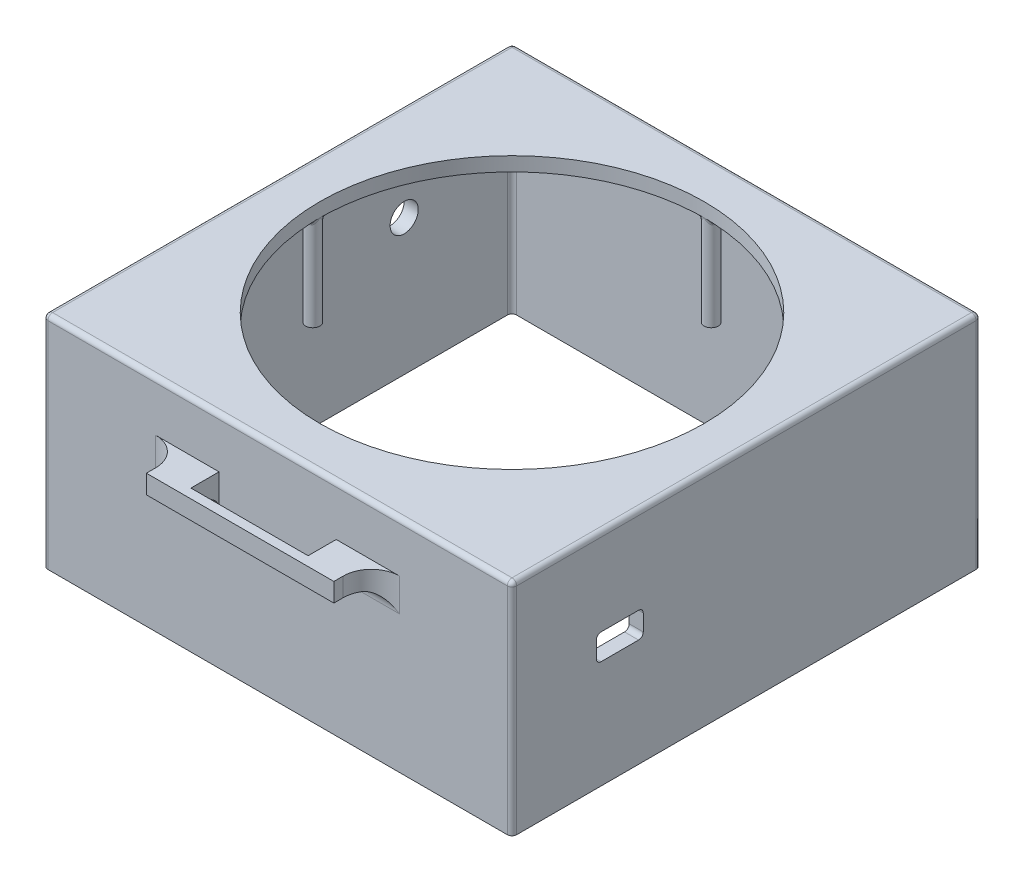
ISO-10303-21;
HEADER;
FILE_DESCRIPTION(('STEP AP214'),'2;1');
FILE_NAME('part.step','',(''),(''),'','','');
FILE_SCHEMA(('AUTOMOTIVE_DESIGN { 1 0 10303 214 1 1 1 1 }'));
ENDSEC;
DATA;
#1=APPLICATION_CONTEXT('core data for automotive mechanical design processes');
#2=APPLICATION_PROTOCOL_DEFINITION('international standard','automotive_design',2000,#1);
#3=PRODUCT_CONTEXT('',#1,'mechanical');
#4=PRODUCT('Part','Part','',(#3));
#5=PRODUCT_RELATED_PRODUCT_CATEGORY('part','',(#4));
#6=PRODUCT_DEFINITION_FORMATION('','',#4);
#7=PRODUCT_DEFINITION_CONTEXT('part definition',#1,'design');
#8=PRODUCT_DEFINITION('design','',#6,#7);
#9=PRODUCT_DEFINITION_SHAPE('','',#8);
#10=(LENGTH_UNIT() NAMED_UNIT(*) SI_UNIT(.MILLI.,.METRE.));
#11=(NAMED_UNIT(*) PLANE_ANGLE_UNIT() SI_UNIT($,.RADIAN.));
#12=(NAMED_UNIT(*) SI_UNIT($,.STERADIAN.) SOLID_ANGLE_UNIT());
#13=UNCERTAINTY_MEASURE_WITH_UNIT(LENGTH_MEASURE(1.E-05),#10,'distance_accuracy_value','');
#14=(GEOMETRIC_REPRESENTATION_CONTEXT(3) GLOBAL_UNCERTAINTY_ASSIGNED_CONTEXT((#13)) GLOBAL_UNIT_ASSIGNED_CONTEXT((#10,
#11,#12)) REPRESENTATION_CONTEXT('',''));
#15=CARTESIAN_POINT('',(0.,0.,0.));
#16=DIRECTION('',(0.,0.,1.));
#17=DIRECTION('',(1.,0.,0.));
#18=AXIS2_PLACEMENT_3D('',#15,#16,#17);
#19=CARTESIAN_POINT('',(20.,33.5779976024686,-58.));
#20=DIRECTION('',(0.,1.,0.));
#21=DIRECTION('',(-1.,0.,0.));
#22=AXIS2_PLACEMENT_3D('',#19,#20,#21);
#23=PLANE('',#22);
#24=DIRECTION('',(-1.,0.,0.));
#25=VECTOR('',#24,1.);
#26=CARTESIAN_POINT('',(20.,33.5779976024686,-50.));
#27=LINE('',#26,#25);
#28=CARTESIAN_POINT('',(-12.5,33.5779976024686,-50.));
#29=VERTEX_POINT('',#28);
#30=CARTESIAN_POINT('',(-26.,33.5779976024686,-50.));
#31=VERTEX_POINT('',#30);
#32=EDGE_CURVE('E538',#29,#31,#27,.T.);
#33=ORIENTED_EDGE('',*,*,#32,.F.);
#34=DIRECTION('',(0.,0.,-1.));
#35=VECTOR('',#34,1.);
#36=CARTESIAN_POINT('',(-12.5,33.5779976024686,-58.));
#37=LINE('',#36,#35);
#38=CARTESIAN_POINT('',(-12.5,33.5779976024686,-56.));
#39=VERTEX_POINT('',#38);
#40=EDGE_CURVE('E535',#29,#39,#37,.T.);
#41=ORIENTED_EDGE('',*,*,#40,.T.);
#42=DIRECTION('',(1.,0.,0.));
#43=VECTOR('',#42,1.);
#44=CARTESIAN_POINT('',(20.,33.5779976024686,-56.));
#45=LINE('',#44,#43);
#46=CARTESIAN_POINT('',(12.5,33.5779976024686,-56.));
#47=VERTEX_POINT('',#46);
#48=EDGE_CURVE('E532',#39,#47,#45,.T.);
#49=ORIENTED_EDGE('',*,*,#48,.T.);
#50=DIRECTION('',(0.,0.,1.));
#51=VECTOR('',#50,1.);
#52=CARTESIAN_POINT('',(12.5,33.5779976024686,-58.));
#53=LINE('',#52,#51);
#54=CARTESIAN_POINT('',(12.5,33.5779976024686,-50.));
#55=VERTEX_POINT('',#54);
#56=EDGE_CURVE('E521',#47,#55,#53,.T.);
#57=ORIENTED_EDGE('',*,*,#56,.T.);
#58=CARTESIAN_POINT('',(26.,33.5779976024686,-50.));
#59=VERTEX_POINT('',#58);
#60=EDGE_CURVE('E543',#59,#55,#27,.T.);
#61=ORIENTED_EDGE('',*,*,#60,.F.);
#62=CARTESIAN_POINT('',(26.,33.5779976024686,-56.));
#63=DIRECTION('',(0.,1.,0.));
#64=DIRECTION('',(-1.,0.,0.));
#65=AXIS2_PLACEMENT_3D('',#62,#63,#64);
#66=CIRCLE('',#65,6.);
#67=CARTESIAN_POINT('',(20.,33.5779976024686,-56.));
#68=VERTEX_POINT('',#67);
#69=EDGE_CURVE('E892',#59,#68,#66,.F.);
#70=ORIENTED_EDGE('',*,*,#69,.T.);
#71=DIRECTION('',(0.,0.,1.));
#72=VECTOR('',#71,1.);
#73=CARTESIAN_POINT('',(20.,33.5779976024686,-58.));
#74=LINE('',#73,#72);
#75=CARTESIAN_POINT('',(20.,33.5779976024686,-58.));
#76=VERTEX_POINT('',#75);
#77=EDGE_CURVE('E560',#76,#68,#74,.T.);
#78=ORIENTED_EDGE('',*,*,#77,.F.);
#79=DIRECTION('',(-1.,0.,0.));
#80=VECTOR('',#79,1.);
#81=CARTESIAN_POINT('',(20.,33.5779976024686,-58.));
#82=LINE('',#81,#80);
#83=CARTESIAN_POINT('',(-20.,33.5779976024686,-58.));
#84=VERTEX_POINT('',#83);
#85=EDGE_CURVE('E542',#76,#84,#82,.T.);
#86=ORIENTED_EDGE('',*,*,#85,.T.);
#87=DIRECTION('',(0.,0.,1.));
#88=VECTOR('',#87,1.);
#89=CARTESIAN_POINT('',(-20.,33.5779976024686,-58.));
#90=LINE('',#89,#88);
#91=CARTESIAN_POINT('',(-20.,33.5779976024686,-56.));
#92=VERTEX_POINT('',#91);
#93=EDGE_CURVE('E563',#84,#92,#90,.T.);
#94=ORIENTED_EDGE('',*,*,#93,.T.);
#95=CARTESIAN_POINT('',(-26.,33.5779976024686,-56.));
#96=DIRECTION('',(0.,1.,0.));
#97=DIRECTION('',(-1.,0.,0.));
#98=AXIS2_PLACEMENT_3D('',#95,#96,#97);
#99=CIRCLE('',#98,6.);
#100=EDGE_CURVE('E899',#92,#31,#99,.F.);
#101=ORIENTED_EDGE('',*,*,#100,.T.);
#102=EDGE_LOOP('',(#33,#41,#49,#57,#61,#70,#78,#86,#94,#101));
#103=FACE_BOUND('',#102,.T.);
#104=ADVANCED_FACE('F34',(#103),#23,.T.);
#105=CARTESIAN_POINT('',(20.,29.5779976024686,-58.));
#106=DIRECTION('',(0.,-1.,0.));
#107=DIRECTION('',(1.,0.,0.));
#108=AXIS2_PLACEMENT_3D('',#105,#106,#107);
#109=PLANE('',#108);
#110=DIRECTION('',(0.,0.,1.));
#111=VECTOR('',#110,1.);
#112=CARTESIAN_POINT('',(-12.5,29.5779976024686,-58.));
#113=LINE('',#112,#111);
#114=CARTESIAN_POINT('',(-12.5,29.5779976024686,-56.));
#115=VERTEX_POINT('',#114);
#116=CARTESIAN_POINT('',(-12.5,29.5779976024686,-53.));
#117=VERTEX_POINT('',#116);
#118=EDGE_CURVE('E907',#115,#117,#113,.T.);
#119=ORIENTED_EDGE('',*,*,#118,.T.);
#120=DIRECTION('',(1.,0.,0.));
#121=VECTOR('',#120,1.);
#122=CARTESIAN_POINT('',(20.,29.5779976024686,-53.));
#123=LINE('',#122,#121);
#124=CARTESIAN_POINT('',(-20.8038475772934,29.5779976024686,-53.));
#125=VERTEX_POINT('',#124);
#126=EDGE_CURVE('E918',#117,#125,#123,.F.);
#127=ORIENTED_EDGE('',*,*,#126,.T.);
#128=CARTESIAN_POINT('',(-26.,29.5779976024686,-56.));
#129=DIRECTION('',(0.,-1.,0.));
#130=DIRECTION('',(1.,0.,0.));
#131=AXIS2_PLACEMENT_3D('',#128,#129,#130);
#132=CIRCLE('',#131,6.);
#133=CARTESIAN_POINT('',(-20.,29.5779976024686,-56.));
#134=VERTEX_POINT('',#133);
#135=EDGE_CURVE('E897',#125,#134,#132,.F.);
#136=ORIENTED_EDGE('',*,*,#135,.T.);
#137=DIRECTION('',(0.,0.,1.));
#138=VECTOR('',#137,1.);
#139=CARTESIAN_POINT('',(-20.,29.5779976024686,-58.));
#140=LINE('',#139,#138);
#141=CARTESIAN_POINT('',(-20.,29.5779976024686,-58.));
#142=VERTEX_POINT('',#141);
#143=EDGE_CURVE('E552',#142,#134,#140,.T.);
#144=ORIENTED_EDGE('',*,*,#143,.F.);
#145=DIRECTION('',(1.,0.,0.));
#146=VECTOR('',#145,1.);
#147=CARTESIAN_POINT('',(20.,29.5779976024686,-58.));
#148=LINE('',#147,#146);
#149=CARTESIAN_POINT('',(20.,29.5779976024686,-58.));
#150=VERTEX_POINT('',#149);
#151=EDGE_CURVE('E549',#142,#150,#148,.T.);
#152=ORIENTED_EDGE('',*,*,#151,.T.);
#153=DIRECTION('',(0.,0.,1.));
#154=VECTOR('',#153,1.);
#155=CARTESIAN_POINT('',(20.,29.5779976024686,-58.));
#156=LINE('',#155,#154);
#157=CARTESIAN_POINT('',(20.,29.5779976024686,-56.));
#158=VERTEX_POINT('',#157);
#159=EDGE_CURVE('E557',#150,#158,#156,.T.);
#160=ORIENTED_EDGE('',*,*,#159,.T.);
#161=CARTESIAN_POINT('',(26.,29.5779976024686,-56.));
#162=DIRECTION('',(0.,-1.,0.));
#163=DIRECTION('',(1.,0.,0.));
#164=AXIS2_PLACEMENT_3D('',#161,#162,#163);
#165=CIRCLE('',#164,6.);
#166=CARTESIAN_POINT('',(20.8038475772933,29.5779976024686,-53.));
#167=VERTEX_POINT('',#166);
#168=EDGE_CURVE('E894',#158,#167,#165,.F.);
#169=ORIENTED_EDGE('',*,*,#168,.T.);
#170=DIRECTION('',(1.,0.,0.));
#171=VECTOR('',#170,1.);
#172=CARTESIAN_POINT('',(20.,29.5779976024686,-53.));
#173=LINE('',#172,#171);
#174=CARTESIAN_POINT('',(12.5,29.5779976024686,-53.));
#175=VERTEX_POINT('',#174);
#176=EDGE_CURVE('E916',#167,#175,#173,.F.);
#177=ORIENTED_EDGE('',*,*,#176,.T.);
#178=DIRECTION('',(0.,0.,-1.));
#179=VECTOR('',#178,1.);
#180=CARTESIAN_POINT('',(12.5,29.5779976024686,-58.));
#181=LINE('',#180,#179);
#182=CARTESIAN_POINT('',(12.5,29.5779976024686,-56.));
#183=VERTEX_POINT('',#182);
#184=EDGE_CURVE('E902',#175,#183,#181,.T.);
#185=ORIENTED_EDGE('',*,*,#184,.T.);
#186=DIRECTION('',(-1.,0.,0.));
#187=VECTOR('',#186,1.);
#188=CARTESIAN_POINT('',(20.,29.5779976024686,-56.));
#189=LINE('',#188,#187);
#190=EDGE_CURVE('E904',#183,#115,#189,.T.);
#191=ORIENTED_EDGE('',*,*,#190,.T.);
#192=EDGE_LOOP('',(#119,#127,#136,#144,#152,#160,#169,#177,#185,#191));
#193=FACE_BOUND('',#192,.T.);
#194=ADVANCED_FACE('F1005',(#193),#109,.T.);
#195=CARTESIAN_POINT('',(-50.,44.25,50.));
#196=DIRECTION('',(0.,0.,-1.));
#197=DIRECTION('',(-1.,0.,0.));
#198=AXIS2_PLACEMENT_3D('',#195,#196,#197);
#199=PLANE('',#198);
#200=DIRECTION('',(0.,1.,0.));
#201=VECTOR('',#200,1.);
#202=CARTESIAN_POINT('',(-12.5,0.,50.));
#203=LINE('',#202,#201);
#204=CARTESIAN_POINT('',(-12.5,26.5779976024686,50.));
#205=VERTEX_POINT('',#204);
#206=CARTESIAN_POINT('',(-12.5,33.5779976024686,50.));
#207=VERTEX_POINT('',#206);
#208=EDGE_CURVE('E567',#205,#207,#203,.T.);
#209=ORIENTED_EDGE('',*,*,#208,.F.);
#210=DIRECTION('',(1.,0.,0.));
#211=VECTOR('',#210,1.);
#212=CARTESIAN_POINT('',(-26.,26.5779976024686,50.));
#213=LINE('',#212,#211);
#214=CARTESIAN_POINT('',(-26.,26.5779976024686,50.));
#215=VERTEX_POINT('',#214);
#216=EDGE_CURVE('E926',#205,#215,#213,.F.);
#217=ORIENTED_EDGE('',*,*,#216,.T.);
#218=DIRECTION('',(0.,-1.,0.));
#219=VECTOR('',#218,1.);
#220=CARTESIAN_POINT('',(-26.,33.5779976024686,50.));
#221=LINE('',#220,#219);
#222=CARTESIAN_POINT('',(-26.,33.5779976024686,50.));
#223=VERTEX_POINT('',#222);
#224=EDGE_CURVE('E858',#215,#223,#221,.F.);
#225=ORIENTED_EDGE('',*,*,#224,.T.);
#226=DIRECTION('',(-1.,0.,0.));
#227=VECTOR('',#226,1.);
#228=CARTESIAN_POINT('',(20.,33.5779976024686,50.));
#229=LINE('',#228,#227);
#230=EDGE_CURVE('E584',#207,#223,#229,.T.);
#231=ORIENTED_EDGE('',*,*,#230,.F.);
#232=EDGE_LOOP('',(#209,#217,#225,#231));
#233=FACE_BOUND('',#232,.T.);
#234=DIRECTION('',(0.,1.,0.));
#235=VECTOR('',#234,1.);
#236=CARTESIAN_POINT('',(26.,29.5779976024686,50.));
#237=LINE('',#236,#235);
#238=CARTESIAN_POINT('',(26.,33.5779976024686,50.));
#239=VERTEX_POINT('',#238);
#240=CARTESIAN_POINT('',(26.,26.5779976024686,50.));
#241=VERTEX_POINT('',#240);
#242=EDGE_CURVE('E856',#239,#241,#237,.F.);
#243=ORIENTED_EDGE('',*,*,#242,.T.);
#244=DIRECTION('',(1.,0.,0.));
#245=VECTOR('',#244,1.);
#246=CARTESIAN_POINT('',(12.5,26.5779976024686,50.));
#247=LINE('',#246,#245);
#248=CARTESIAN_POINT('',(12.5,26.5779976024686,50.));
#249=VERTEX_POINT('',#248);
#250=EDGE_CURVE('E929',#241,#249,#247,.F.);
#251=ORIENTED_EDGE('',*,*,#250,.T.);
#252=DIRECTION('',(0.,1.,0.));
#253=VECTOR('',#252,1.);
#254=CARTESIAN_POINT('',(12.5,0.,50.));
#255=LINE('',#254,#253);
#256=CARTESIAN_POINT('',(12.5,33.5779976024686,50.));
#257=VERTEX_POINT('',#256);
#258=EDGE_CURVE('E570',#249,#257,#255,.T.);
#259=ORIENTED_EDGE('',*,*,#258,.T.);
#260=EDGE_CURVE('E589',#239,#257,#229,.T.);
#261=ORIENTED_EDGE('',*,*,#260,.F.);
#262=EDGE_LOOP('',(#243,#251,#259,#261));
#263=FACE_BOUND('',#262,.T.);
#264=DIRECTION('',(1.,0.,0.));
#265=VECTOR('',#264,1.);
#266=CARTESIAN_POINT('',(-50.,43.25,50.));
#267=LINE('',#266,#265);
#268=CARTESIAN_POINT('',(49.,43.25,50.));
#269=VERTEX_POINT('',#268);
#270=CARTESIAN_POINT('',(-49.,43.25,50.));
#271=VERTEX_POINT('',#270);
#272=EDGE_CURVE('E736',#269,#271,#267,.F.);
#273=ORIENTED_EDGE('',*,*,#272,.T.);
#274=DIRECTION('',(0.,-1.,0.));
#275=VECTOR('',#274,1.);
#276=CARTESIAN_POINT('',(-49.,44.25,50.));
#277=LINE('',#276,#275);
#278=CARTESIAN_POINT('',(-49.,-2.72,50.));
#279=VERTEX_POINT('',#278);
#280=EDGE_CURVE('E734',#271,#279,#277,.T.);
#281=ORIENTED_EDGE('',*,*,#280,.T.);
#282=DIRECTION('',(-1.,0.,0.));
#283=VECTOR('',#282,1.);
#284=CARTESIAN_POINT('',(49.,-2.72,50.));
#285=LINE('',#284,#283);
#286=CARTESIAN_POINT('',(49.,-2.72,50.));
#287=VERTEX_POINT('',#286);
#288=EDGE_CURVE('E515',#287,#279,#285,.T.);
#289=ORIENTED_EDGE('',*,*,#288,.F.);
#290=DIRECTION('',(0.,-1.,0.));
#291=VECTOR('',#290,1.);
#292=CARTESIAN_POINT('',(49.,44.25,50.));
#293=LINE('',#292,#291);
#294=EDGE_CURVE('E738',#287,#269,#293,.F.);
#295=ORIENTED_EDGE('',*,*,#294,.T.);
#296=EDGE_LOOP('',(#273,#281,#289,#295));
#297=FACE_BOUND('',#296,.T.);
#298=ADVANCED_FACE('F1011',(#233,#263,#297),#199,.F.);
#299=CARTESIAN_POINT('',(50.,44.25,-50.));
#300=DIRECTION('',(-1.,0.,0.));
#301=DIRECTION('',(0.,0.,1.));
#302=AXIS2_PLACEMENT_3D('',#299,#300,#301);
#303=PLANE('',#302);
#304=DIRECTION('',(0.,1.,0.));
#305=VECTOR('',#304,1.);
#306=CARTESIAN_POINT('',(50.,24.75,22.));
#307=LINE('',#306,#305);
#308=CARTESIAN_POINT('',(50.,21.25,22.));
#309=VERTEX_POINT('',#308);
#310=CARTESIAN_POINT('',(50.,24.75,22.));
#311=VERTEX_POINT('',#310);
#312=EDGE_CURVE('E635',#309,#311,#307,.T.);
#313=ORIENTED_EDGE('',*,*,#312,.F.);
#314=CARTESIAN_POINT('',(50.,21.25,23.));
#315=DIRECTION('',(1.,0.,0.));
#316=DIRECTION('',(0.,0.,-1.));
#317=AXIS2_PLACEMENT_3D('',#314,#315,#316);
#318=CIRCLE('',#317,1.);
#319=CARTESIAN_POINT('',(50.,20.25,23.));
#320=VERTEX_POINT('',#319);
#321=EDGE_CURVE('E627',#320,#309,#318,.T.);
#322=ORIENTED_EDGE('',*,*,#321,.F.);
#323=DIRECTION('',(0.,0.,-1.));
#324=VECTOR('',#323,1.);
#325=CARTESIAN_POINT('',(50.,20.25,31.));
#326=LINE('',#325,#324);
#327=CARTESIAN_POINT('',(50.,20.25,31.));
#328=VERTEX_POINT('',#327);
#329=EDGE_CURVE('E653',#328,#320,#326,.T.);
#330=ORIENTED_EDGE('',*,*,#329,.F.);
#331=CARTESIAN_POINT('',(50.,21.25,31.));
#332=DIRECTION('',(1.,0.,0.));
#333=DIRECTION('',(0.,0.,-1.));
#334=AXIS2_PLACEMENT_3D('',#331,#332,#333);
#335=CIRCLE('',#334,1.);
#336=CARTESIAN_POINT('',(50.,21.25,32.));
#337=VERTEX_POINT('',#336);
#338=EDGE_CURVE('E650',#337,#328,#335,.T.);
#339=ORIENTED_EDGE('',*,*,#338,.F.);
#340=DIRECTION('',(0.,-1.,0.));
#341=VECTOR('',#340,1.);
#342=CARTESIAN_POINT('',(50.,24.75,32.));
#343=LINE('',#342,#341);
#344=CARTESIAN_POINT('',(50.,24.75,32.));
#345=VERTEX_POINT('',#344);
#346=EDGE_CURVE('E647',#345,#337,#343,.T.);
#347=ORIENTED_EDGE('',*,*,#346,.F.);
#348=CARTESIAN_POINT('',(50.,24.75,31.));
#349=DIRECTION('',(1.,0.,0.));
#350=DIRECTION('',(0.,0.,-1.));
#351=AXIS2_PLACEMENT_3D('',#348,#349,#350);
#352=CIRCLE('',#351,1.);
#353=CARTESIAN_POINT('',(50.,25.75,31.));
#354=VERTEX_POINT('',#353);
#355=EDGE_CURVE('E644',#354,#345,#352,.T.);
#356=ORIENTED_EDGE('',*,*,#355,.F.);
#357=DIRECTION('',(0.,0.,1.));
#358=VECTOR('',#357,1.);
#359=CARTESIAN_POINT('',(50.,25.75,31.));
#360=LINE('',#359,#358);
#361=CARTESIAN_POINT('',(50.,25.75,23.));
#362=VERTEX_POINT('',#361);
#363=EDGE_CURVE('E641',#362,#354,#360,.T.);
#364=ORIENTED_EDGE('',*,*,#363,.F.);
#365=CARTESIAN_POINT('',(50.,24.75,23.));
#366=DIRECTION('',(1.,0.,0.));
#367=DIRECTION('',(0.,0.,1.));
#368=AXIS2_PLACEMENT_3D('',#365,#366,#367);
#369=CIRCLE('',#368,1.);
#370=EDGE_CURVE('E638',#311,#362,#369,.T.);
#371=ORIENTED_EDGE('',*,*,#370,.F.);
#372=EDGE_LOOP('',(#313,#322,#330,#339,#347,#356,#364,#371));
#373=FACE_BOUND('',#372,.T.);
#374=DIRECTION('',(0.,-1.,0.));
#375=VECTOR('',#374,1.);
#376=CARTESIAN_POINT('',(50.,44.25,49.));
#377=LINE('',#376,#375);
#378=CARTESIAN_POINT('',(50.,43.25,49.));
#379=VERTEX_POINT('',#378);
#380=CARTESIAN_POINT('',(50.,-2.72,49.));
#381=VERTEX_POINT('',#380);
#382=EDGE_CURVE('E752',#379,#381,#377,.T.);
#383=ORIENTED_EDGE('',*,*,#382,.T.);
#384=DIRECTION('',(0.,0.,1.));
#385=VECTOR('',#384,1.);
#386=CARTESIAN_POINT('',(50.,-2.72,-49.));
#387=LINE('',#386,#385);
#388=CARTESIAN_POINT('',(50.,-2.72,-49.));
#389=VERTEX_POINT('',#388);
#390=EDGE_CURVE('E509',#389,#381,#387,.T.);
#391=ORIENTED_EDGE('',*,*,#390,.F.);
#392=DIRECTION('',(0.,-1.,0.));
#393=VECTOR('',#392,1.);
#394=CARTESIAN_POINT('',(50.,44.25,-49.));
#395=LINE('',#394,#393);
#396=CARTESIAN_POINT('',(50.,43.25,-49.));
#397=VERTEX_POINT('',#396);
#398=EDGE_CURVE('E756',#389,#397,#395,.F.);
#399=ORIENTED_EDGE('',*,*,#398,.T.);
#400=DIRECTION('',(0.,0.,-1.));
#401=VECTOR('',#400,1.);
#402=CARTESIAN_POINT('',(50.,43.25,50.));
#403=LINE('',#402,#401);
#404=EDGE_CURVE('E754',#397,#379,#403,.F.);
#405=ORIENTED_EDGE('',*,*,#404,.T.);
#406=EDGE_LOOP('',(#383,#391,#399,#405));
#407=FACE_BOUND('',#406,.T.);
#408=ADVANCED_FACE('F1511',(#373,#407),#303,.F.);
#409=CARTESIAN_POINT('',(-50.,44.25,-50.));
#410=DIRECTION('',(0.,0.,1.));
#411=DIRECTION('',(1.,0.,0.));
#412=AXIS2_PLACEMENT_3D('',#409,#410,#411);
#413=PLANE('',#412);
#414=DIRECTION('',(1.,0.,0.));
#415=VECTOR('',#414,1.);
#416=CARTESIAN_POINT('',(-50.,26.5779976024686,-50.));
#417=LINE('',#416,#415);
#418=CARTESIAN_POINT('',(-26.,26.5779976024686,-50.));
#419=VERTEX_POINT('',#418);
#420=CARTESIAN_POINT('',(-12.5,26.5779976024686,-50.));
#421=VERTEX_POINT('',#420);
#422=EDGE_CURVE('E913',#419,#421,#417,.T.);
#423=ORIENTED_EDGE('',*,*,#422,.T.);
#424=DIRECTION('',(0.,1.,0.));
#425=VECTOR('',#424,1.);
#426=CARTESIAN_POINT('',(-12.5,0.,-50.));
#427=LINE('',#426,#425);
#428=EDGE_CURVE('E527',#421,#29,#427,.T.);
#429=ORIENTED_EDGE('',*,*,#428,.T.);
#430=ORIENTED_EDGE('',*,*,#32,.T.);
#431=DIRECTION('',(0.,-1.,0.));
#432=VECTOR('',#431,1.);
#433=CARTESIAN_POINT('',(-26.,44.25,-50.));
#434=LINE('',#433,#432);
#435=EDGE_CURVE('E883',#31,#419,#434,.T.);
#436=ORIENTED_EDGE('',*,*,#435,.T.);
#437=EDGE_LOOP('',(#423,#429,#430,#436));
#438=FACE_BOUND('',#437,.T.);
#439=DIRECTION('',(1.,0.,0.));
#440=VECTOR('',#439,1.);
#441=CARTESIAN_POINT('',(-50.,26.5779976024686,-50.));
#442=LINE('',#441,#440);
#443=CARTESIAN_POINT('',(12.5,26.5779976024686,-50.));
#444=VERTEX_POINT('',#443);
#445=CARTESIAN_POINT('',(26.,26.5779976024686,-50.));
#446=VERTEX_POINT('',#445);
#447=EDGE_CURVE('E910',#444,#446,#442,.T.);
#448=ORIENTED_EDGE('',*,*,#447,.T.);
#449=DIRECTION('',(0.,1.,0.));
#450=VECTOR('',#449,1.);
#451=CARTESIAN_POINT('',(26.,44.25,-50.));
#452=LINE('',#451,#450);
#453=EDGE_CURVE('E885',#446,#59,#452,.T.);
#454=ORIENTED_EDGE('',*,*,#453,.T.);
#455=ORIENTED_EDGE('',*,*,#60,.T.);
#456=DIRECTION('',(0.,1.,0.));
#457=VECTOR('',#456,1.);
#458=CARTESIAN_POINT('',(12.5,0.,-50.));
#459=LINE('',#458,#457);
#460=EDGE_CURVE('E525',#444,#55,#459,.T.);
#461=ORIENTED_EDGE('',*,*,#460,.F.);
#462=EDGE_LOOP('',(#448,#454,#455,#461));
#463=FACE_BOUND('',#462,.T.);
#464=DIRECTION('',(-1.,0.,0.));
#465=VECTOR('',#464,1.);
#466=CARTESIAN_POINT('',(50.,43.25,-50.));
#467=LINE('',#466,#465);
#468=CARTESIAN_POINT('',(-49.,43.25,-50.));
#469=VERTEX_POINT('',#468);
#470=CARTESIAN_POINT('',(49.,43.25,-50.));
#471=VERTEX_POINT('',#470);
#472=EDGE_CURVE('E748',#469,#471,#467,.F.);
#473=ORIENTED_EDGE('',*,*,#472,.T.);
#474=DIRECTION('',(0.,-1.,0.));
#475=VECTOR('',#474,1.);
#476=CARTESIAN_POINT('',(49.,44.25,-50.));
#477=LINE('',#476,#475);
#478=CARTESIAN_POINT('',(49.,-2.72,-50.));
#479=VERTEX_POINT('',#478);
#480=EDGE_CURVE('E746',#471,#479,#477,.T.);
#481=ORIENTED_EDGE('',*,*,#480,.T.);
#482=DIRECTION('',(1.,0.,0.));
#483=VECTOR('',#482,1.);
#484=CARTESIAN_POINT('',(-49.,-2.72,-50.));
#485=LINE('',#484,#483);
#486=CARTESIAN_POINT('',(-49.,-2.72,-50.));
#487=VERTEX_POINT('',#486);
#488=EDGE_CURVE('E503',#487,#479,#485,.T.);
#489=ORIENTED_EDGE('',*,*,#488,.F.);
#490=DIRECTION('',(0.,-1.,0.));
#491=VECTOR('',#490,1.);
#492=CARTESIAN_POINT('',(-49.,44.25,-50.));
#493=LINE('',#492,#491);
#494=EDGE_CURVE('E750',#487,#469,#493,.F.);
#495=ORIENTED_EDGE('',*,*,#494,.T.);
#496=EDGE_LOOP('',(#473,#481,#489,#495));
#497=FACE_BOUND('',#496,.T.);
#498=ADVANCED_FACE('F1444',(#438,#463,#497),#413,.F.);
#499=CARTESIAN_POINT('',(-50.,44.25,-50.));
#500=DIRECTION('',(1.,0.,0.));
#501=DIRECTION('',(0.,0.,-1.));
#502=AXIS2_PLACEMENT_3D('',#499,#500,#501);
#503=PLANE('',#502);
#504=CARTESIAN_POINT('',(-50.,26.3,-24.));
#505=DIRECTION('',(-1.,0.,0.));
#506=DIRECTION('',(0.,0.,1.));
#507=AXIS2_PLACEMENT_3D('',#504,#505,#506);
#508=CIRCLE('',#507,3.);
#509=CARTESIAN_POINT('',(-50.,26.3,-21.));
#510=VERTEX_POINT('',#509);
#511=EDGE_CURVE('E609',#510,#510,#508,.T.);
#512=ORIENTED_EDGE('',*,*,#511,.F.);
#513=EDGE_LOOP('',(#512));
#514=FACE_BOUND('',#513,.T.);
#515=DIRECTION('',(0.,0.,-1.));
#516=VECTOR('',#515,1.);
#517=CARTESIAN_POINT('',(-50.,28.8,23.5));
#518=LINE('',#517,#516);
#519=CARTESIAN_POINT('',(-50.,28.8,28.5));
#520=VERTEX_POINT('',#519);
#521=CARTESIAN_POINT('',(-50.,28.8,23.5));
#522=VERTEX_POINT('',#521);
#523=EDGE_CURVE('E615',#520,#522,#518,.T.);
#524=ORIENTED_EDGE('',*,*,#523,.F.);
#525=DIRECTION('',(0.,1.,0.));
#526=VECTOR('',#525,1.);
#527=CARTESIAN_POINT('',(-50.,28.8,28.5));
#528=LINE('',#527,#526);
#529=CARTESIAN_POINT('',(-50.,23.8,28.5));
#530=VERTEX_POINT('',#529);
#531=EDGE_CURVE('E613',#530,#520,#528,.T.);
#532=ORIENTED_EDGE('',*,*,#531,.F.);
#533=DIRECTION('',(0.,0.,1.));
#534=VECTOR('',#533,1.);
#535=CARTESIAN_POINT('',(-50.,23.8,23.5));
#536=LINE('',#535,#534);
#537=CARTESIAN_POINT('',(-50.,23.8,23.5));
#538=VERTEX_POINT('',#537);
#539=EDGE_CURVE('E621',#538,#530,#536,.T.);
#540=ORIENTED_EDGE('',*,*,#539,.F.);
#541=DIRECTION('',(0.,-1.,0.));
#542=VECTOR('',#541,1.);
#543=CARTESIAN_POINT('',(-50.,28.8,23.5));
#544=LINE('',#543,#542);
#545=EDGE_CURVE('E618',#522,#538,#544,.T.);
#546=ORIENTED_EDGE('',*,*,#545,.F.);
#547=EDGE_LOOP('',(#524,#532,#540,#546));
#548=FACE_BOUND('',#547,.T.);
#549=DIRECTION('',(0.,0.,1.));
#550=VECTOR('',#549,1.);
#551=CARTESIAN_POINT('',(-50.,43.25,-50.));
#552=LINE('',#551,#550);
#553=CARTESIAN_POINT('',(-50.,43.25,49.));
#554=VERTEX_POINT('',#553);
#555=CARTESIAN_POINT('',(-50.,43.25,-49.));
#556=VERTEX_POINT('',#555);
#557=EDGE_CURVE('E742',#554,#556,#552,.F.);
#558=ORIENTED_EDGE('',*,*,#557,.T.);
#559=DIRECTION('',(0.,-1.,0.));
#560=VECTOR('',#559,1.);
#561=CARTESIAN_POINT('',(-50.,44.25,-49.));
#562=LINE('',#561,#560);
#563=CARTESIAN_POINT('',(-50.,-2.72,-49.));
#564=VERTEX_POINT('',#563);
#565=EDGE_CURVE('E744',#556,#564,#562,.T.);
#566=ORIENTED_EDGE('',*,*,#565,.T.);
#567=DIRECTION('',(0.,0.,-1.));
#568=VECTOR('',#567,1.);
#569=CARTESIAN_POINT('',(-50.,-2.72,49.));
#570=LINE('',#569,#568);
#571=CARTESIAN_POINT('',(-50.,-2.72,49.));
#572=VERTEX_POINT('',#571);
#573=EDGE_CURVE('E497',#572,#564,#570,.T.);
#574=ORIENTED_EDGE('',*,*,#573,.F.);
#575=DIRECTION('',(0.,-1.,0.));
#576=VECTOR('',#575,1.);
#577=CARTESIAN_POINT('',(-50.,44.25,49.));
#578=LINE('',#577,#576);
#579=EDGE_CURVE('E740',#572,#554,#578,.F.);
#580=ORIENTED_EDGE('',*,*,#579,.T.);
#581=EDGE_LOOP('',(#558,#566,#574,#580));
#582=FACE_BOUND('',#581,.T.);
#583=ADVANCED_FACE('F1901',(#514,#548,#582),#503,.F.);
#584=CARTESIAN_POINT('',(0.,44.25,0.));
#585=DIRECTION('',(0.,1.,0.));
#586=DIRECTION('',(0.,0.,1.));
#587=AXIS2_PLACEMENT_3D('',#584,#585,#586);
#588=PLANE('',#587);
#589=CARTESIAN_POINT('',(0.,44.25,0.));
#590=DIRECTION('',(0.,-1.,0.));
#591=DIRECTION('',(0.,0.,-1.));
#592=AXIS2_PLACEMENT_3D('',#589,#590,#591);
#593=CIRCLE('',#592,41.);
#594=CARTESIAN_POINT('',(0.,44.25,-41.));
#595=VERTEX_POINT('',#594);
#596=EDGE_CURVE('E674',#595,#595,#593,.T.);
#597=ORIENTED_EDGE('',*,*,#596,.T.);
#598=EDGE_LOOP('',(#597));
#599=FACE_BOUND('',#598,.T.);
#600=DIRECTION('',(0.,0.,1.));
#601=VECTOR('',#600,1.);
#602=CARTESIAN_POINT('',(-49.,44.25,50.));
#603=LINE('',#602,#601);
#604=CARTESIAN_POINT('',(-49.,44.25,-49.));
#605=VERTEX_POINT('',#604);
#606=CARTESIAN_POINT('',(-49.,44.25,49.));
#607=VERTEX_POINT('',#606);
#608=EDGE_CURVE('E729',#605,#607,#603,.T.);
#609=ORIENTED_EDGE('',*,*,#608,.T.);
#610=DIRECTION('',(1.,0.,0.));
#611=VECTOR('',#610,1.);
#612=CARTESIAN_POINT('',(50.,44.25,49.));
#613=LINE('',#612,#611);
#614=CARTESIAN_POINT('',(49.,44.25,49.));
#615=VERTEX_POINT('',#614);
#616=EDGE_CURVE('E731',#607,#615,#613,.T.);
#617=ORIENTED_EDGE('',*,*,#616,.T.);
#618=DIRECTION('',(0.,0.,-1.));
#619=VECTOR('',#618,1.);
#620=CARTESIAN_POINT('',(49.,44.25,-50.));
#621=LINE('',#620,#619);
#622=CARTESIAN_POINT('',(49.,44.25,-49.));
#623=VERTEX_POINT('',#622);
#624=EDGE_CURVE('E725',#615,#623,#621,.T.);
#625=ORIENTED_EDGE('',*,*,#624,.T.);
#626=DIRECTION('',(-1.,0.,0.));
#627=VECTOR('',#626,1.);
#628=CARTESIAN_POINT('',(-50.,44.25,-49.));
#629=LINE('',#628,#627);
#630=EDGE_CURVE('E727',#623,#605,#629,.T.);
#631=ORIENTED_EDGE('',*,*,#630,.T.);
#632=EDGE_LOOP('',(#609,#617,#625,#631));
#633=FACE_BOUND('',#632,.T.);
#634=ADVANCED_FACE('F1894',(#599,#633),#588,.T.);
#635=CARTESIAN_POINT('',(47.,44.25,-50.));
#636=DIRECTION('',(-1.,0.,0.));
#637=DIRECTION('',(0.,0.,1.));
#638=AXIS2_PLACEMENT_3D('',#635,#636,#637);
#639=PLANE('',#638);
#640=CARTESIAN_POINT('',(47.,21.25,23.));
#641=DIRECTION('',(-1.,0.,0.));
#642=DIRECTION('',(0.,0.,1.));
#643=AXIS2_PLACEMENT_3D('',#640,#641,#642);
#644=CIRCLE('',#643,1.);
#645=CARTESIAN_POINT('',(47.,21.25,22.));
#646=VERTEX_POINT('',#645);
#647=CARTESIAN_POINT('',(47.,20.25,23.));
#648=VERTEX_POINT('',#647);
#649=EDGE_CURVE('E840',#646,#648,#644,.T.);
#650=ORIENTED_EDGE('',*,*,#649,.F.);
#651=DIRECTION('',(0.,-1.,0.));
#652=VECTOR('',#651,1.);
#653=CARTESIAN_POINT('',(47.,44.25,22.));
#654=LINE('',#653,#652);
#655=CARTESIAN_POINT('',(47.,24.75,22.));
#656=VERTEX_POINT('',#655);
#657=EDGE_CURVE('E758',#656,#646,#654,.T.);
#658=ORIENTED_EDGE('',*,*,#657,.F.);
#659=CARTESIAN_POINT('',(47.,24.75,23.));
#660=DIRECTION('',(-1.,0.,0.));
#661=DIRECTION('',(0.,0.,1.));
#662=AXIS2_PLACEMENT_3D('',#659,#660,#661);
#663=CIRCLE('',#662,1.);
#664=CARTESIAN_POINT('',(47.,25.75,23.));
#665=VERTEX_POINT('',#664);
#666=EDGE_CURVE('E827',#665,#656,#663,.T.);
#667=ORIENTED_EDGE('',*,*,#666,.F.);
#668=DIRECTION('',(0.,0.,-1.));
#669=VECTOR('',#668,1.);
#670=CARTESIAN_POINT('',(47.,25.75,-50.));
#671=LINE('',#670,#669);
#672=CARTESIAN_POINT('',(47.,25.75,31.));
#673=VERTEX_POINT('',#672);
#674=EDGE_CURVE('E830',#673,#665,#671,.T.);
#675=ORIENTED_EDGE('',*,*,#674,.F.);
#676=CARTESIAN_POINT('',(47.,24.75,31.));
#677=DIRECTION('',(-1.,0.,0.));
#678=DIRECTION('',(0.,0.,1.));
#679=AXIS2_PLACEMENT_3D('',#676,#677,#678);
#680=CIRCLE('',#679,1.);
#681=CARTESIAN_POINT('',(47.,24.75,32.));
#682=VERTEX_POINT('',#681);
#683=EDGE_CURVE('E832',#682,#673,#680,.T.);
#684=ORIENTED_EDGE('',*,*,#683,.F.);
#685=DIRECTION('',(0.,1.,0.));
#686=VECTOR('',#685,1.);
#687=CARTESIAN_POINT('',(47.,44.25,32.));
#688=LINE('',#687,#686);
#689=CARTESIAN_POINT('',(47.,21.25,32.));
#690=VERTEX_POINT('',#689);
#691=EDGE_CURVE('E834',#690,#682,#688,.T.);
#692=ORIENTED_EDGE('',*,*,#691,.F.);
#693=CARTESIAN_POINT('',(47.,21.25,31.));
#694=DIRECTION('',(-1.,0.,0.));
#695=DIRECTION('',(0.,0.,1.));
#696=AXIS2_PLACEMENT_3D('',#693,#694,#695);
#697=CIRCLE('',#696,1.);
#698=CARTESIAN_POINT('',(47.,20.25,31.));
#699=VERTEX_POINT('',#698);
#700=EDGE_CURVE('E836',#699,#690,#697,.T.);
#701=ORIENTED_EDGE('',*,*,#700,.F.);
#702=DIRECTION('',(0.,0.,1.));
#703=VECTOR('',#702,1.);
#704=CARTESIAN_POINT('',(47.,20.25,-50.));
#705=LINE('',#704,#703);
#706=EDGE_CURVE('E838',#648,#699,#705,.T.);
#707=ORIENTED_EDGE('',*,*,#706,.F.);
#708=EDGE_LOOP('',(#650,#658,#667,#675,#684,#692,#701,#707));
#709=FACE_BOUND('',#708,.T.);
#710=DIRECTION('',(0.,-1.,0.));
#711=VECTOR('',#710,1.);
#712=CARTESIAN_POINT('',(47.,0.,-46.));
#713=LINE('',#712,#711);
#714=CARTESIAN_POINT('',(47.,40.25,-46.));
#715=VERTEX_POINT('',#714);
#716=CARTESIAN_POINT('',(47.,-2.72,-46.));
#717=VERTEX_POINT('',#716);
#718=EDGE_CURVE('E719',#715,#717,#713,.T.);
#719=ORIENTED_EDGE('',*,*,#718,.T.);
#720=DIRECTION('',(0.,0.,1.));
#721=VECTOR('',#720,1.);
#722=CARTESIAN_POINT('',(47.,-2.72,46.));
#723=LINE('',#722,#721);
#724=CARTESIAN_POINT('',(47.,-2.72,46.));
#725=VERTEX_POINT('',#724);
#726=EDGE_CURVE('E478',#717,#725,#723,.T.);
#727=ORIENTED_EDGE('',*,*,#726,.T.);
#728=DIRECTION('',(0.,-1.,0.));
#729=VECTOR('',#728,1.);
#730=CARTESIAN_POINT('',(47.,41.25,46.));
#731=LINE('',#730,#729);
#732=CARTESIAN_POINT('',(47.,40.25,46.));
#733=VERTEX_POINT('',#732);
#734=EDGE_CURVE('E723',#725,#733,#731,.F.);
#735=ORIENTED_EDGE('',*,*,#734,.T.);
#736=DIRECTION('',(0.,0.,-1.));
#737=VECTOR('',#736,1.);
#738=CARTESIAN_POINT('',(47.,40.25,-50.));
#739=LINE('',#738,#737);
#740=EDGE_CURVE('E721',#733,#715,#739,.T.);
#741=ORIENTED_EDGE('',*,*,#740,.T.);
#742=EDGE_LOOP('',(#719,#727,#735,#741));
#743=FACE_BOUND('',#742,.T.);
#744=ADVANCED_FACE('F1887',(#709,#743),#639,.T.);
#745=CARTESIAN_POINT('',(-50.,44.25,-47.));
#746=DIRECTION('',(0.,0.,1.));
#747=DIRECTION('',(1.,0.,0.));
#748=AXIS2_PLACEMENT_3D('',#745,#746,#747);
#749=PLANE('',#748);
#750=DIRECTION('',(-1.,0.,0.));
#751=VECTOR('',#750,1.);
#752=CARTESIAN_POINT('',(-50.,40.25,-47.));
#753=LINE('',#752,#751);
#754=CARTESIAN_POINT('',(46.,40.25,-47.));
#755=VERTEX_POINT('',#754);
#756=CARTESIAN_POINT('',(-46.,40.25,-47.));
#757=VERTEX_POINT('',#756);
#758=EDGE_CURVE('E460',#755,#757,#753,.T.);
#759=ORIENTED_EDGE('',*,*,#758,.T.);
#760=DIRECTION('',(0.,-1.,0.));
#761=VECTOR('',#760,1.);
#762=CARTESIAN_POINT('',(-46.,0.,-47.));
#763=LINE('',#762,#761);
#764=CARTESIAN_POINT('',(-46.,-2.72,-47.));
#765=VERTEX_POINT('',#764);
#766=EDGE_CURVE('E453',#757,#765,#763,.T.);
#767=ORIENTED_EDGE('',*,*,#766,.T.);
#768=DIRECTION('',(1.,0.,0.));
#769=VECTOR('',#768,1.);
#770=CARTESIAN_POINT('',(46.,-2.72,-47.));
#771=LINE('',#770,#769);
#772=CARTESIAN_POINT('',(46.,-2.72,-47.));
#773=VERTEX_POINT('',#772);
#774=EDGE_CURVE('E457',#765,#773,#771,.T.);
#775=ORIENTED_EDGE('',*,*,#774,.T.);
#776=DIRECTION('',(0.,-1.,0.));
#777=VECTOR('',#776,1.);
#778=CARTESIAN_POINT('',(46.,41.25,-47.));
#779=LINE('',#778,#777);
#780=EDGE_CURVE('E696',#773,#755,#779,.F.);
#781=ORIENTED_EDGE('',*,*,#780,.T.);
#782=EDGE_LOOP('',(#759,#767,#775,#781));
#783=FACE_BOUND('',#782,.T.);
#784=ADVANCED_FACE('F455',(#783),#749,.T.);
#785=CARTESIAN_POINT('',(-47.,44.25,-50.));
#786=DIRECTION('',(1.,0.,0.));
#787=DIRECTION('',(0.,0.,-1.));
#788=AXIS2_PLACEMENT_3D('',#785,#786,#787);
#789=PLANE('',#788);
#790=CARTESIAN_POINT('',(-47.,26.3,-24.));
#791=DIRECTION('',(1.,0.,0.));
#792=DIRECTION('',(0.,0.,-1.));
#793=AXIS2_PLACEMENT_3D('',#790,#791,#792);
#794=CIRCLE('',#793,3.);
#795=CARTESIAN_POINT('',(-47.,26.3,-27.));
#796=VERTEX_POINT('',#795);
#797=EDGE_CURVE('E612',#796,#796,#794,.T.);
#798=ORIENTED_EDGE('',*,*,#797,.F.);
#799=EDGE_LOOP('',(#798));
#800=FACE_BOUND('',#799,.T.);
#801=DIRECTION('',(0.,-1.,0.));
#802=VECTOR('',#801,1.);
#803=CARTESIAN_POINT('',(-47.,44.25,28.5));
#804=LINE('',#803,#802);
#805=CARTESIAN_POINT('',(-47.,28.8,28.5));
#806=VERTEX_POINT('',#805);
#807=CARTESIAN_POINT('',(-47.,23.8,28.5));
#808=VERTEX_POINT('',#807);
#809=EDGE_CURVE('E849',#806,#808,#804,.T.);
#810=ORIENTED_EDGE('',*,*,#809,.F.);
#811=DIRECTION('',(0.,0.,1.));
#812=VECTOR('',#811,1.);
#813=CARTESIAN_POINT('',(-47.,28.8000000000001,-50.));
#814=LINE('',#813,#812);
#815=CARTESIAN_POINT('',(-47.,28.8,23.5));
#816=VERTEX_POINT('',#815);
#817=EDGE_CURVE('E842',#816,#806,#814,.T.);
#818=ORIENTED_EDGE('',*,*,#817,.F.);
#819=DIRECTION('',(0.,1.,0.));
#820=VECTOR('',#819,1.);
#821=CARTESIAN_POINT('',(-47.,44.25,23.5));
#822=LINE('',#821,#820);
#823=CARTESIAN_POINT('',(-47.,23.8,23.5));
#824=VERTEX_POINT('',#823);
#825=EDGE_CURVE('E844',#824,#816,#822,.T.);
#826=ORIENTED_EDGE('',*,*,#825,.F.);
#827=DIRECTION('',(0.,0.,-1.));
#828=VECTOR('',#827,1.);
#829=CARTESIAN_POINT('',(-47.,23.8000000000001,-50.));
#830=LINE('',#829,#828);
#831=EDGE_CURVE('E847',#808,#824,#830,.T.);
#832=ORIENTED_EDGE('',*,*,#831,.F.);
#833=EDGE_LOOP('',(#810,#818,#826,#832));
#834=FACE_BOUND('',#833,.T.);
#835=DIRECTION('',(0.,0.,1.));
#836=VECTOR('',#835,1.);
#837=CARTESIAN_POINT('',(-47.,40.25,-50.));
#838=LINE('',#837,#836);
#839=CARTESIAN_POINT('',(-47.,40.25,-46.));
#840=VERTEX_POINT('',#839);
#841=CARTESIAN_POINT('',(-47.,40.25,46.));
#842=VERTEX_POINT('',#841);
#843=EDGE_CURVE('E709',#840,#842,#838,.T.);
#844=ORIENTED_EDGE('',*,*,#843,.T.);
#845=DIRECTION('',(0.,-1.,0.));
#846=VECTOR('',#845,1.);
#847=CARTESIAN_POINT('',(-47.,0.,46.));
#848=LINE('',#847,#846);
#849=CARTESIAN_POINT('',(-47.,-2.72,46.));
#850=VERTEX_POINT('',#849);
#851=EDGE_CURVE('E711',#842,#850,#848,.T.);
#852=ORIENTED_EDGE('',*,*,#851,.T.);
#853=DIRECTION('',(0.,0.,-1.));
#854=VECTOR('',#853,1.);
#855=CARTESIAN_POINT('',(-47.,-2.72,-46.));
#856=LINE('',#855,#854);
#857=CARTESIAN_POINT('',(-47.,-2.72,-46.));
#858=VERTEX_POINT('',#857);
#859=EDGE_CURVE('E492',#850,#858,#856,.T.);
#860=ORIENTED_EDGE('',*,*,#859,.T.);
#861=DIRECTION('',(0.,-1.,0.));
#862=VECTOR('',#861,1.);
#863=CARTESIAN_POINT('',(-47.,41.25,-46.));
#864=LINE('',#863,#862);
#865=EDGE_CURVE('E468',#858,#840,#864,.F.);
#866=ORIENTED_EDGE('',*,*,#865,.T.);
#867=EDGE_LOOP('',(#844,#852,#860,#866));
#868=FACE_BOUND('',#867,.T.);
#869=ADVANCED_FACE('F1873',(#800,#834,#868),#789,.T.);
#870=CARTESIAN_POINT('',(-50.,44.25,47.));
#871=DIRECTION('',(0.,0.,-1.));
#872=DIRECTION('',(-1.,0.,0.));
#873=AXIS2_PLACEMENT_3D('',#870,#871,#872);
#874=PLANE('',#873);
#875=DIRECTION('',(0.,-1.,0.));
#876=VECTOR('',#875,1.);
#877=CARTESIAN_POINT('',(46.,0.,47.));
#878=LINE('',#877,#876);
#879=CARTESIAN_POINT('',(46.,40.25,47.));
#880=VERTEX_POINT('',#879);
#881=CARTESIAN_POINT('',(46.,-2.72,47.));
#882=VERTEX_POINT('',#881);
#883=EDGE_CURVE('E713',#880,#882,#878,.T.);
#884=ORIENTED_EDGE('',*,*,#883,.T.);
#885=DIRECTION('',(-1.,0.,0.));
#886=VECTOR('',#885,1.);
#887=CARTESIAN_POINT('',(-46.,-2.72,47.));
#888=LINE('',#887,#886);
#889=CARTESIAN_POINT('',(-46.,-2.72,47.));
#890=VERTEX_POINT('',#889);
#891=EDGE_CURVE('E486',#882,#890,#888,.T.);
#892=ORIENTED_EDGE('',*,*,#891,.T.);
#893=DIRECTION('',(0.,-1.,0.));
#894=VECTOR('',#893,1.);
#895=CARTESIAN_POINT('',(-46.,41.25,47.));
#896=LINE('',#895,#894);
#897=CARTESIAN_POINT('',(-46.,40.25,47.));
#898=VERTEX_POINT('',#897);
#899=EDGE_CURVE('E717',#890,#898,#896,.F.);
#900=ORIENTED_EDGE('',*,*,#899,.T.);
#901=DIRECTION('',(1.,0.,0.));
#902=VECTOR('',#901,1.);
#903=CARTESIAN_POINT('',(-50.,40.25,47.));
#904=LINE('',#903,#902);
#905=EDGE_CURVE('E715',#898,#880,#904,.T.);
#906=ORIENTED_EDGE('',*,*,#905,.T.);
#907=EDGE_LOOP('',(#884,#892,#900,#906));
#908=FACE_BOUND('',#907,.T.);
#909=ADVANCED_FACE('F1867',(#908),#874,.T.);
#910=CARTESIAN_POINT('',(0.,41.25,0.));
#911=DIRECTION('',(0.,1.,0.));
#912=DIRECTION('',(0.,0.,1.));
#913=AXIS2_PLACEMENT_3D('',#910,#911,#912);
#914=PLANE('',#913);
#915=CARTESIAN_POINT('',(0.,41.25,0.));
#916=DIRECTION('',(0.,-1.,0.));
#917=DIRECTION('',(0.,0.,-1.));
#918=AXIS2_PLACEMENT_3D('',#915,#916,#917);
#919=CIRCLE('',#918,41.);
#920=CARTESIAN_POINT('',(-1.96382509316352,41.25,40.9529411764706));
#921=VERTEX_POINT('',#920);
#922=CARTESIAN_POINT('',(-40.9529411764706,41.25,1.96382509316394));
#923=VERTEX_POINT('',#922);
#924=EDGE_CURVE('E1397',#921,#923,#919,.T.);
#925=ORIENTED_EDGE('',*,*,#924,.F.);
#926=CARTESIAN_POINT('',(2.9157116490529E-13,41.25,42.5));
#927=DIRECTION('',(0.,1.,0.));
#928=DIRECTION('',(0.,0.,1.));
#929=AXIS2_PLACEMENT_3D('',#926,#927,#928);
#930=CIRCLE('',#929,2.5);
#931=CARTESIAN_POINT('',(1.96382509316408,41.25,40.9529411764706));
#932=VERTEX_POINT('',#931);
#933=EDGE_CURVE('E1371',#921,#932,#930,.T.);
#934=ORIENTED_EDGE('',*,*,#933,.T.);
#935=CARTESIAN_POINT('',(40.9529411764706,41.25,1.96382509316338));
#936=VERTEX_POINT('',#935);
#937=EDGE_CURVE('E1405',#936,#932,#919,.T.);
#938=ORIENTED_EDGE('',*,*,#937,.F.);
#939=CARTESIAN_POINT('',(42.5,41.25,-4.39959121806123E-13));
#940=DIRECTION('',(0.,1.,0.));
#941=DIRECTION('',(0.,0.,1.));
#942=AXIS2_PLACEMENT_3D('',#939,#940,#941);
#943=CIRCLE('',#942,2.5);
#944=CARTESIAN_POINT('',(40.9529411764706,41.25,-1.96382509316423));
#945=VERTEX_POINT('',#944);
#946=EDGE_CURVE('E1390',#936,#945,#943,.T.);
#947=ORIENTED_EDGE('',*,*,#946,.T.);
#948=CARTESIAN_POINT('',(1.9638250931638,41.25,-40.9529411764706));
#949=VERTEX_POINT('',#948);
#950=EDGE_CURVE('E681',#949,#945,#919,.T.);
#951=ORIENTED_EDGE('',*,*,#950,.F.);
#952=CARTESIAN_POINT('',(0.,41.25,-42.5));
#953=DIRECTION('',(0.,1.,0.));
#954=DIRECTION('',(0.,0.,1.));
#955=AXIS2_PLACEMENT_3D('',#952,#953,#954);
#956=CIRCLE('',#955,2.5);
#957=CARTESIAN_POINT('',(-1.96382509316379,41.25,-40.9529411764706));
#958=VERTEX_POINT('',#957);
#959=EDGE_CURVE('E1352',#949,#958,#956,.T.);
#960=ORIENTED_EDGE('',*,*,#959,.T.);
#961=CARTESIAN_POINT('',(-40.9529411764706,41.25,-1.96382509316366));
#962=VERTEX_POINT('',#961);
#963=EDGE_CURVE('E1400',#962,#958,#919,.T.);
#964=ORIENTED_EDGE('',*,*,#963,.F.);
#965=CARTESIAN_POINT('',(-42.5,41.25,1.50122101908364E-13));
#966=DIRECTION('',(0.,1.,0.));
#967=DIRECTION('',(0.,0.,1.));
#968=AXIS2_PLACEMENT_3D('',#965,#966,#967);
#969=CIRCLE('',#968,2.5);
#970=EDGE_CURVE('E1363',#962,#923,#969,.T.);
#971=ORIENTED_EDGE('',*,*,#970,.T.);
#972=EDGE_LOOP('',(#925,#934,#938,#947,#951,#960,#964,#971));
#973=FACE_BOUND('',#972,.T.);
#974=DIRECTION('',(0.,0.,1.));
#975=VECTOR('',#974,1.);
#976=CARTESIAN_POINT('',(-46.,41.25,0.));
#977=LINE('',#976,#975);
#978=CARTESIAN_POINT('',(-46.,41.25,46.));
#979=VERTEX_POINT('',#978);
#980=CARTESIAN_POINT('',(-46.,41.25,-46.));
#981=VERTEX_POINT('',#980);
#982=EDGE_CURVE('E703',#979,#981,#977,.F.);
#983=ORIENTED_EDGE('',*,*,#982,.T.);
#984=DIRECTION('',(-1.,0.,0.));
#985=VECTOR('',#984,1.);
#986=CARTESIAN_POINT('',(0.,41.25,-46.));
#987=LINE('',#986,#985);
#988=CARTESIAN_POINT('',(46.,41.25,-46.));
#989=VERTEX_POINT('',#988);
#990=EDGE_CURVE('E705',#981,#989,#987,.F.);
#991=ORIENTED_EDGE('',*,*,#990,.T.);
#992=DIRECTION('',(0.,0.,-1.));
#993=VECTOR('',#992,1.);
#994=CARTESIAN_POINT('',(46.,41.25,0.));
#995=LINE('',#994,#993);
#996=CARTESIAN_POINT('',(46.,41.25,46.));
#997=VERTEX_POINT('',#996);
#998=EDGE_CURVE('E463',#989,#997,#995,.F.);
#999=ORIENTED_EDGE('',*,*,#998,.T.);
#1000=DIRECTION('',(1.,0.,0.));
#1001=VECTOR('',#1000,1.);
#1002=CARTESIAN_POINT('',(0.,41.25,46.));
#1003=LINE('',#1002,#1001);
#1004=EDGE_CURVE('E701',#997,#979,#1003,.F.);
#1005=ORIENTED_EDGE('',*,*,#1004,.T.);
#1006=EDGE_LOOP('',(#983,#991,#999,#1005));
#1007=FACE_BOUND('',#1006,.T.);
#1008=ADVANCED_FACE('F1161',(#973,#1007),#914,.F.);
#1009=CARTESIAN_POINT('',(46.,44.25,46.));
#1010=DIRECTION('',(0.,1.,0.));
#1011=DIRECTION('',(0.,0.,1.));
#1012=AXIS2_PLACEMENT_3D('',#1009,#1010,#1011);
#1013=CYLINDRICAL_SURFACE('',#1012,1.);
#1014=ORIENTED_EDGE('',*,*,#734,.F.);
#1015=CARTESIAN_POINT('',(46.,-2.72,46.));
#1016=DIRECTION('',(0.,-1.,0.));
#1017=DIRECTION('',(0.,0.,-1.));
#1018=AXIS2_PLACEMENT_3D('',#1015,#1016,#1017);
#1019=CIRCLE('',#1018,1.);
#1020=EDGE_CURVE('E483',#725,#882,#1019,.T.);
#1021=ORIENTED_EDGE('',*,*,#1020,.T.);
#1022=ORIENTED_EDGE('',*,*,#883,.F.);
#1023=CARTESIAN_POINT('',(46.,40.25,46.));
#1024=DIRECTION('',(0.,-1.,0.));
#1025=DIRECTION('',(0.,0.,-1.));
#1026=AXIS2_PLACEMENT_3D('',#1023,#1024,#1025);
#1027=CIRCLE('',#1026,1.);
#1028=EDGE_CURVE('E788',#733,#880,#1027,.T.);
#1029=ORIENTED_EDGE('',*,*,#1028,.F.);
#1030=EDGE_LOOP('',(#1014,#1021,#1022,#1029));
#1031=FACE_BOUND('',#1030,.T.);
#1032=ADVANCED_FACE('F1852',(#1031),#1013,.F.);
#1033=CARTESIAN_POINT('',(-46.,44.25,46.));
#1034=DIRECTION('',(0.,1.,0.));
#1035=DIRECTION('',(0.,0.,1.));
#1036=AXIS2_PLACEMENT_3D('',#1033,#1034,#1035);
#1037=CYLINDRICAL_SURFACE('',#1036,1.);
#1038=ORIENTED_EDGE('',*,*,#899,.F.);
#1039=CARTESIAN_POINT('',(-46.,-2.72,46.));
#1040=DIRECTION('',(0.,-1.,0.));
#1041=DIRECTION('',(0.,0.,-1.));
#1042=AXIS2_PLACEMENT_3D('',#1039,#1040,#1041);
#1043=CIRCLE('',#1042,1.);
#1044=EDGE_CURVE('E489',#890,#850,#1043,.T.);
#1045=ORIENTED_EDGE('',*,*,#1044,.T.);
#1046=ORIENTED_EDGE('',*,*,#851,.F.);
#1047=CARTESIAN_POINT('',(-46.,40.25,46.));
#1048=DIRECTION('',(0.,-1.,0.));
#1049=DIRECTION('',(0.,0.,-1.));
#1050=AXIS2_PLACEMENT_3D('',#1047,#1048,#1049);
#1051=CIRCLE('',#1050,1.);
#1052=EDGE_CURVE('E785',#898,#842,#1051,.T.);
#1053=ORIENTED_EDGE('',*,*,#1052,.F.);
#1054=EDGE_LOOP('',(#1038,#1045,#1046,#1053));
#1055=FACE_BOUND('',#1054,.T.);
#1056=ADVANCED_FACE('F1845',(#1055),#1037,.F.);
#1057=CARTESIAN_POINT('',(-50.,40.25,46.));
#1058=DIRECTION('',(1.,0.,0.));
#1059=DIRECTION('',(0.,0.,-1.));
#1060=AXIS2_PLACEMENT_3D('',#1057,#1058,#1059);
#1061=CYLINDRICAL_SURFACE('',#1060,1.);
#1062=CARTESIAN_POINT('',(46.,40.25,46.));
#1063=DIRECTION('',(-1.,0.,0.));
#1064=DIRECTION('',(0.,0.,1.));
#1065=AXIS2_PLACEMENT_3D('',#1062,#1063,#1064);
#1066=CIRCLE('',#1065,1.);
#1067=EDGE_CURVE('E698',#880,#997,#1066,.T.);
#1068=ORIENTED_EDGE('',*,*,#1067,.F.);
#1069=ORIENTED_EDGE('',*,*,#905,.F.);
#1070=CARTESIAN_POINT('',(-46.,40.25,46.));
#1071=DIRECTION('',(1.,0.,0.));
#1072=DIRECTION('',(0.,0.,-1.));
#1073=AXIS2_PLACEMENT_3D('',#1070,#1071,#1072);
#1074=CIRCLE('',#1073,1.);
#1075=EDGE_CURVE('E782',#979,#898,#1074,.T.);
#1076=ORIENTED_EDGE('',*,*,#1075,.F.);
#1077=ORIENTED_EDGE('',*,*,#1004,.F.);
#1078=EDGE_LOOP('',(#1068,#1069,#1076,#1077));
#1079=FACE_BOUND('',#1078,.T.);
#1080=ADVANCED_FACE('F1837',(#1079),#1061,.F.);
#1081=CARTESIAN_POINT('',(46.,40.25,46.));
#1082=DIRECTION('',(0.,0.,1.));
#1083=DIRECTION('',(1.,0.,0.));
#1084=AXIS2_PLACEMENT_3D('',#1081,#1082,#1083);
#1085=SPHERICAL_SURFACE('',#1084,1.);
#1086=ORIENTED_EDGE('',*,*,#1028,.T.);
#1087=ORIENTED_EDGE('',*,*,#1067,.T.);
#1088=CARTESIAN_POINT('',(46.,40.25,46.));
#1089=DIRECTION('',(0.,0.,-1.));
#1090=DIRECTION('',(-1.,0.,0.));
#1091=AXIS2_PLACEMENT_3D('',#1088,#1089,#1090);
#1092=CIRCLE('',#1091,1.);
#1093=EDGE_CURVE('E779',#733,#997,#1092,.F.);
#1094=ORIENTED_EDGE('',*,*,#1093,.F.);
#1095=EDGE_LOOP('',(#1086,#1087,#1094));
#1096=FACE_BOUND('',#1095,.T.);
#1097=ADVANCED_FACE('F1829',(#1096),#1085,.F.);
#1098=CARTESIAN_POINT('',(-46.,40.25,46.));
#1099=DIRECTION('',(0.,0.,1.));
#1100=DIRECTION('',(1.,0.,0.));
#1101=AXIS2_PLACEMENT_3D('',#1098,#1099,#1100);
#1102=SPHERICAL_SURFACE('',#1101,1.);
#1103=ORIENTED_EDGE('',*,*,#1075,.T.);
#1104=ORIENTED_EDGE('',*,*,#1052,.T.);
#1105=CARTESIAN_POINT('',(-46.,40.25,46.));
#1106=DIRECTION('',(0.,0.,-1.));
#1107=DIRECTION('',(-1.,0.,0.));
#1108=AXIS2_PLACEMENT_3D('',#1105,#1106,#1107);
#1109=CIRCLE('',#1108,1.);
#1110=EDGE_CURVE('E776',#979,#842,#1109,.F.);
#1111=ORIENTED_EDGE('',*,*,#1110,.F.);
#1112=EDGE_LOOP('',(#1103,#1104,#1111));
#1113=FACE_BOUND('',#1112,.T.);
#1114=ADVANCED_FACE('F1821',(#1113),#1102,.F.);
#1115=CARTESIAN_POINT('',(46.,40.25,-50.));
#1116=DIRECTION('',(0.,0.,-1.));
#1117=DIRECTION('',(-1.,0.,0.));
#1118=AXIS2_PLACEMENT_3D('',#1115,#1116,#1117);
#1119=CYLINDRICAL_SURFACE('',#1118,1.);
#1120=ORIENTED_EDGE('',*,*,#1093,.T.);
#1121=ORIENTED_EDGE('',*,*,#998,.F.);
#1122=CARTESIAN_POINT('',(46.,40.25,-46.));
#1123=DIRECTION('',(0.,0.,1.));
#1124=DIRECTION('',(1.,0.,0.));
#1125=AXIS2_PLACEMENT_3D('',#1122,#1123,#1124);
#1126=CIRCLE('',#1125,1.);
#1127=EDGE_CURVE('E773',#715,#989,#1126,.T.);
#1128=ORIENTED_EDGE('',*,*,#1127,.F.);
#1129=ORIENTED_EDGE('',*,*,#740,.F.);
#1130=EDGE_LOOP('',(#1120,#1121,#1128,#1129));
#1131=FACE_BOUND('',#1130,.T.);
#1132=ADVANCED_FACE('F1813',(#1131),#1119,.F.);
#1133=CARTESIAN_POINT('',(46.,44.25,-46.));
#1134=DIRECTION('',(0.,1.,0.));
#1135=DIRECTION('',(0.,0.,1.));
#1136=AXIS2_PLACEMENT_3D('',#1133,#1134,#1135);
#1137=CYLINDRICAL_SURFACE('',#1136,1.);
#1138=ORIENTED_EDGE('',*,*,#780,.F.);
#1139=CARTESIAN_POINT('',(46.,-2.72,-46.));
#1140=DIRECTION('',(0.,-1.,0.));
#1141=DIRECTION('',(0.,0.,-1.));
#1142=AXIS2_PLACEMENT_3D('',#1139,#1140,#1141);
#1143=CIRCLE('',#1142,1.);
#1144=EDGE_CURVE('E476',#773,#717,#1143,.T.);
#1145=ORIENTED_EDGE('',*,*,#1144,.T.);
#1146=ORIENTED_EDGE('',*,*,#718,.F.);
#1147=CARTESIAN_POINT('',(46.,40.25,-46.));
#1148=DIRECTION('',(0.,-1.,0.));
#1149=DIRECTION('',(0.,0.,-1.));
#1150=AXIS2_PLACEMENT_3D('',#1147,#1148,#1149);
#1151=CIRCLE('',#1150,1.);
#1152=EDGE_CURVE('E770',#755,#715,#1151,.T.);
#1153=ORIENTED_EDGE('',*,*,#1152,.F.);
#1154=EDGE_LOOP('',(#1138,#1145,#1146,#1153));
#1155=FACE_BOUND('',#1154,.T.);
#1156=ADVANCED_FACE('F1806',(#1155),#1137,.F.);
#1157=CARTESIAN_POINT('',(-46.,44.25,-46.));
#1158=DIRECTION('',(0.,1.,0.));
#1159=DIRECTION('',(0.,0.,1.));
#1160=AXIS2_PLACEMENT_3D('',#1157,#1158,#1159);
#1161=CYLINDRICAL_SURFACE('',#1160,1.);
#1162=ORIENTED_EDGE('',*,*,#865,.F.);
#1163=CARTESIAN_POINT('',(-46.,-2.72,-46.));
#1164=DIRECTION('',(0.,-1.,0.));
#1165=DIRECTION('',(0.,0.,-1.));
#1166=AXIS2_PLACEMENT_3D('',#1163,#1164,#1165);
#1167=CIRCLE('',#1166,1.);
#1168=EDGE_CURVE('E466',#858,#765,#1167,.T.);
#1169=ORIENTED_EDGE('',*,*,#1168,.T.);
#1170=ORIENTED_EDGE('',*,*,#766,.F.);
#1171=CARTESIAN_POINT('',(-46.,40.25,-46.));
#1172=DIRECTION('',(0.,-1.,0.));
#1173=DIRECTION('',(0.,0.,-1.));
#1174=AXIS2_PLACEMENT_3D('',#1171,#1172,#1173);
#1175=CIRCLE('',#1174,1.);
#1176=EDGE_CURVE('E767',#840,#757,#1175,.T.);
#1177=ORIENTED_EDGE('',*,*,#1176,.F.);
#1178=EDGE_LOOP('',(#1162,#1169,#1170,#1177));
#1179=FACE_BOUND('',#1178,.T.);
#1180=ADVANCED_FACE('F467',(#1179),#1161,.F.);
#1181=CARTESIAN_POINT('',(-46.,40.25,-50.));
#1182=DIRECTION('',(0.,0.,1.));
#1183=DIRECTION('',(1.,0.,0.));
#1184=AXIS2_PLACEMENT_3D('',#1181,#1182,#1183);
#1185=CYLINDRICAL_SURFACE('',#1184,1.);
#1186=ORIENTED_EDGE('',*,*,#1110,.T.);
#1187=ORIENTED_EDGE('',*,*,#843,.F.);
#1188=CARTESIAN_POINT('',(-46.,40.25,-46.));
#1189=DIRECTION('',(0.,0.,1.));
#1190=DIRECTION('',(1.,0.,0.));
#1191=AXIS2_PLACEMENT_3D('',#1188,#1189,#1190);
#1192=CIRCLE('',#1191,1.);
#1193=EDGE_CURVE('E764',#981,#840,#1192,.T.);
#1194=ORIENTED_EDGE('',*,*,#1193,.F.);
#1195=ORIENTED_EDGE('',*,*,#982,.F.);
#1196=EDGE_LOOP('',(#1186,#1187,#1194,#1195));
#1197=FACE_BOUND('',#1196,.T.);
#1198=ADVANCED_FACE('F1791',(#1197),#1185,.F.);
#1199=CARTESIAN_POINT('',(46.,40.25,-46.));
#1200=DIRECTION('',(0.,0.,1.));
#1201=DIRECTION('',(1.,0.,0.));
#1202=AXIS2_PLACEMENT_3D('',#1199,#1200,#1201);
#1203=SPHERICAL_SURFACE('',#1202,1.);
#1204=ORIENTED_EDGE('',*,*,#1152,.T.);
#1205=ORIENTED_EDGE('',*,*,#1127,.T.);
#1206=CARTESIAN_POINT('',(46.,40.25,-46.));
#1207=DIRECTION('',(-1.,0.,0.));
#1208=DIRECTION('',(0.,0.,1.));
#1209=AXIS2_PLACEMENT_3D('',#1206,#1207,#1208);
#1210=CIRCLE('',#1209,1.);
#1211=EDGE_CURVE('E761',#755,#989,#1210,.F.);
#1212=ORIENTED_EDGE('',*,*,#1211,.F.);
#1213=EDGE_LOOP('',(#1204,#1205,#1212));
#1214=FACE_BOUND('',#1213,.T.);
#1215=ADVANCED_FACE('F1783',(#1214),#1203,.F.);
#1216=CARTESIAN_POINT('',(-46.,40.25,-46.));
#1217=DIRECTION('',(0.,0.,1.));
#1218=DIRECTION('',(1.,0.,0.));
#1219=AXIS2_PLACEMENT_3D('',#1216,#1217,#1218);
#1220=SPHERICAL_SURFACE('',#1219,1.);
#1221=ORIENTED_EDGE('',*,*,#1193,.T.);
#1222=ORIENTED_EDGE('',*,*,#1176,.T.);
#1223=CARTESIAN_POINT('',(-46.,40.25,-46.));
#1224=DIRECTION('',(1.,0.,0.));
#1225=DIRECTION('',(0.,0.,-1.));
#1226=AXIS2_PLACEMENT_3D('',#1223,#1224,#1225);
#1227=CIRCLE('',#1226,1.);
#1228=EDGE_CURVE('E759',#981,#757,#1227,.F.);
#1229=ORIENTED_EDGE('',*,*,#1228,.F.);
#1230=EDGE_LOOP('',(#1221,#1222,#1229));
#1231=FACE_BOUND('',#1230,.T.);
#1232=ADVANCED_FACE('F1775',(#1231),#1220,.F.);
#1233=CARTESIAN_POINT('',(-50.,40.25,-46.));
#1234=DIRECTION('',(-1.,0.,0.));
#1235=DIRECTION('',(0.,0.,1.));
#1236=AXIS2_PLACEMENT_3D('',#1233,#1234,#1235);
#1237=CYLINDRICAL_SURFACE('',#1236,1.);
#1238=ORIENTED_EDGE('',*,*,#1211,.T.);
#1239=ORIENTED_EDGE('',*,*,#990,.F.);
#1240=ORIENTED_EDGE('',*,*,#1228,.T.);
#1241=ORIENTED_EDGE('',*,*,#758,.F.);
#1242=EDGE_LOOP('',(#1238,#1239,#1240,#1241));
#1243=FACE_BOUND('',#1242,.T.);
#1244=ADVANCED_FACE('F1768',(#1243),#1237,.F.);
#1245=CARTESIAN_POINT('',(-49.,44.25,-49.));
#1246=DIRECTION('',(0.,-1.,0.));
#1247=DIRECTION('',(0.,0.,-1.));
#1248=AXIS2_PLACEMENT_3D('',#1245,#1246,#1247);
#1249=CYLINDRICAL_SURFACE('',#1248,1.);
#1250=ORIENTED_EDGE('',*,*,#494,.F.);
#1251=CARTESIAN_POINT('',(-49.,-2.72,-49.));
#1252=DIRECTION('',(0.,-1.,0.));
#1253=DIRECTION('',(0.,0.,-1.));
#1254=AXIS2_PLACEMENT_3D('',#1251,#1252,#1253);
#1255=CIRCLE('',#1254,1.);
#1256=EDGE_CURVE('E500',#564,#487,#1255,.T.);
#1257=ORIENTED_EDGE('',*,*,#1256,.F.);
#1258=ORIENTED_EDGE('',*,*,#565,.F.);
#1259=CARTESIAN_POINT('',(-49.,43.25,-49.));
#1260=DIRECTION('',(0.,1.,0.));
#1261=DIRECTION('',(0.,0.,1.));
#1262=AXIS2_PLACEMENT_3D('',#1259,#1260,#1261);
#1263=CIRCLE('',#1262,1.);
#1264=EDGE_CURVE('E762',#469,#556,#1263,.T.);
#1265=ORIENTED_EDGE('',*,*,#1264,.F.);
#1266=EDGE_LOOP('',(#1250,#1257,#1258,#1265));
#1267=FACE_BOUND('',#1266,.T.);
#1268=ADVANCED_FACE('F1760',(#1267),#1249,.T.);
#1269=CARTESIAN_POINT('',(0.,43.25,-49.));
#1270=DIRECTION('',(1.,0.,0.));
#1271=DIRECTION('',(0.,0.,-1.));
#1272=AXIS2_PLACEMENT_3D('',#1269,#1270,#1271);
#1273=CYLINDRICAL_SURFACE('',#1272,1.);
#1274=CARTESIAN_POINT('',(49.,43.25,-49.));
#1275=DIRECTION('',(1.,0.,0.));
#1276=DIRECTION('',(0.,0.,-1.));
#1277=AXIS2_PLACEMENT_3D('',#1274,#1275,#1276);
#1278=CIRCLE('',#1277,1.);
#1279=EDGE_CURVE('E818',#471,#623,#1278,.T.);
#1280=ORIENTED_EDGE('',*,*,#1279,.F.);
#1281=ORIENTED_EDGE('',*,*,#472,.F.);
#1282=CARTESIAN_POINT('',(-49.,43.25,-49.));
#1283=DIRECTION('',(-1.,0.,0.));
#1284=DIRECTION('',(0.,0.,1.));
#1285=AXIS2_PLACEMENT_3D('',#1282,#1283,#1284);
#1286=CIRCLE('',#1285,1.);
#1287=EDGE_CURVE('E821',#605,#469,#1286,.T.);
#1288=ORIENTED_EDGE('',*,*,#1287,.F.);
#1289=ORIENTED_EDGE('',*,*,#630,.F.);
#1290=EDGE_LOOP('',(#1280,#1281,#1288,#1289));
#1291=FACE_BOUND('',#1290,.T.);
#1292=ADVANCED_FACE('F1751',(#1291),#1273,.T.);
#1293=CARTESIAN_POINT('',(49.,44.25,-49.));
#1294=DIRECTION('',(0.,-1.,0.));
#1295=DIRECTION('',(0.,0.,-1.));
#1296=AXIS2_PLACEMENT_3D('',#1293,#1294,#1295);
#1297=CYLINDRICAL_SURFACE('',#1296,1.);
#1298=ORIENTED_EDGE('',*,*,#398,.F.);
#1299=CARTESIAN_POINT('',(49.,-2.72,-49.));
#1300=DIRECTION('',(0.,-1.,0.));
#1301=DIRECTION('',(0.,0.,-1.));
#1302=AXIS2_PLACEMENT_3D('',#1299,#1300,#1301);
#1303=CIRCLE('',#1302,1.);
#1304=EDGE_CURVE('E506',#479,#389,#1303,.T.);
#1305=ORIENTED_EDGE('',*,*,#1304,.F.);
#1306=ORIENTED_EDGE('',*,*,#480,.F.);
#1307=CARTESIAN_POINT('',(49.,43.25,-49.));
#1308=DIRECTION('',(0.,1.,0.));
#1309=DIRECTION('',(0.,0.,1.));
#1310=AXIS2_PLACEMENT_3D('',#1307,#1308,#1309);
#1311=CIRCLE('',#1310,1.);
#1312=EDGE_CURVE('E815',#397,#471,#1311,.T.);
#1313=ORIENTED_EDGE('',*,*,#1312,.F.);
#1314=EDGE_LOOP('',(#1298,#1305,#1306,#1313));
#1315=FACE_BOUND('',#1314,.T.);
#1316=ADVANCED_FACE('F1743',(#1315),#1297,.T.);
#1317=CARTESIAN_POINT('',(-49.,43.25,-49.));
#1318=DIRECTION('',(0.,0.,1.));
#1319=DIRECTION('',(1.,0.,0.));
#1320=AXIS2_PLACEMENT_3D('',#1317,#1318,#1319);
#1321=SPHERICAL_SURFACE('',#1320,1.);
#1322=ORIENTED_EDGE('',*,*,#1287,.T.);
#1323=ORIENTED_EDGE('',*,*,#1264,.T.);
#1324=CARTESIAN_POINT('',(-49.,43.25,-49.));
#1325=DIRECTION('',(0.,0.,-1.));
#1326=DIRECTION('',(-1.,0.,0.));
#1327=AXIS2_PLACEMENT_3D('',#1324,#1325,#1326);
#1328=CIRCLE('',#1327,1.);
#1329=EDGE_CURVE('E812',#605,#556,#1328,.F.);
#1330=ORIENTED_EDGE('',*,*,#1329,.F.);
#1331=EDGE_LOOP('',(#1322,#1323,#1330));
#1332=FACE_BOUND('',#1331,.T.);
#1333=ADVANCED_FACE('F1735',(#1332),#1321,.T.);
#1334=CARTESIAN_POINT('',(49.,43.25,-49.));
#1335=DIRECTION('',(0.,0.,1.));
#1336=DIRECTION('',(1.,0.,0.));
#1337=AXIS2_PLACEMENT_3D('',#1334,#1335,#1336);
#1338=SPHERICAL_SURFACE('',#1337,1.);
#1339=ORIENTED_EDGE('',*,*,#1312,.T.);
#1340=ORIENTED_EDGE('',*,*,#1279,.T.);
#1341=CARTESIAN_POINT('',(49.,43.25,-49.));
#1342=DIRECTION('',(0.,0.,-1.));
#1343=DIRECTION('',(-1.,0.,0.));
#1344=AXIS2_PLACEMENT_3D('',#1341,#1342,#1343);
#1345=CIRCLE('',#1344,1.);
#1346=EDGE_CURVE('E809',#397,#623,#1345,.F.);
#1347=ORIENTED_EDGE('',*,*,#1346,.F.);
#1348=EDGE_LOOP('',(#1339,#1340,#1347));
#1349=FACE_BOUND('',#1348,.T.);
#1350=ADVANCED_FACE('F1727',(#1349),#1338,.T.);
#1351=CARTESIAN_POINT('',(-49.,44.25,49.));
#1352=DIRECTION('',(0.,-1.,0.));
#1353=DIRECTION('',(0.,0.,-1.));
#1354=AXIS2_PLACEMENT_3D('',#1351,#1352,#1353);
#1355=CYLINDRICAL_SURFACE('',#1354,1.);
#1356=ORIENTED_EDGE('',*,*,#579,.F.);
#1357=CARTESIAN_POINT('',(-49.,-2.72,49.));
#1358=DIRECTION('',(0.,-1.,0.));
#1359=DIRECTION('',(0.,0.,-1.));
#1360=AXIS2_PLACEMENT_3D('',#1357,#1358,#1359);
#1361=CIRCLE('',#1360,1.);
#1362=EDGE_CURVE('E494',#279,#572,#1361,.T.);
#1363=ORIENTED_EDGE('',*,*,#1362,.F.);
#1364=ORIENTED_EDGE('',*,*,#280,.F.);
#1365=CARTESIAN_POINT('',(-49.,43.25,49.));
#1366=DIRECTION('',(0.,1.,0.));
#1367=DIRECTION('',(0.,0.,1.));
#1368=AXIS2_PLACEMENT_3D('',#1365,#1366,#1367);
#1369=CIRCLE('',#1368,1.);
#1370=EDGE_CURVE('E806',#554,#271,#1369,.T.);
#1371=ORIENTED_EDGE('',*,*,#1370,.F.);
#1372=EDGE_LOOP('',(#1356,#1363,#1364,#1371));
#1373=FACE_BOUND('',#1372,.T.);
#1374=ADVANCED_FACE('F1719',(#1373),#1355,.T.);
#1375=CARTESIAN_POINT('',(-49.,43.25,0.));
#1376=DIRECTION('',(0.,0.,-1.));
#1377=DIRECTION('',(-1.,0.,0.));
#1378=AXIS2_PLACEMENT_3D('',#1375,#1376,#1377);
#1379=CYLINDRICAL_SURFACE('',#1378,1.);
#1380=ORIENTED_EDGE('',*,*,#1329,.T.);
#1381=ORIENTED_EDGE('',*,*,#557,.F.);
#1382=CARTESIAN_POINT('',(-49.,43.25,49.));
#1383=DIRECTION('',(0.,0.,1.));
#1384=DIRECTION('',(1.,0.,0.));
#1385=AXIS2_PLACEMENT_3D('',#1382,#1383,#1384);
#1386=CIRCLE('',#1385,1.);
#1387=EDGE_CURVE('E803',#607,#554,#1386,.T.);
#1388=ORIENTED_EDGE('',*,*,#1387,.F.);
#1389=ORIENTED_EDGE('',*,*,#608,.F.);
#1390=EDGE_LOOP('',(#1380,#1381,#1388,#1389));
#1391=FACE_BOUND('',#1390,.T.);
#1392=ADVANCED_FACE('F1711',(#1391),#1379,.T.);
#1393=CARTESIAN_POINT('',(49.,43.25,0.));
#1394=DIRECTION('',(0.,0.,1.));
#1395=DIRECTION('',(1.,0.,0.));
#1396=AXIS2_PLACEMENT_3D('',#1393,#1394,#1395);
#1397=CYLINDRICAL_SURFACE('',#1396,1.);
#1398=ORIENTED_EDGE('',*,*,#1346,.T.);
#1399=ORIENTED_EDGE('',*,*,#624,.F.);
#1400=CARTESIAN_POINT('',(49.,43.25,49.));
#1401=DIRECTION('',(0.,0.,1.));
#1402=DIRECTION('',(1.,0.,0.));
#1403=AXIS2_PLACEMENT_3D('',#1400,#1401,#1402);
#1404=CIRCLE('',#1403,1.);
#1405=EDGE_CURVE('E800',#379,#615,#1404,.T.);
#1406=ORIENTED_EDGE('',*,*,#1405,.F.);
#1407=ORIENTED_EDGE('',*,*,#404,.F.);
#1408=EDGE_LOOP('',(#1398,#1399,#1406,#1407));
#1409=FACE_BOUND('',#1408,.T.);
#1410=ADVANCED_FACE('F1703',(#1409),#1397,.T.);
#1411=CARTESIAN_POINT('',(49.,44.25,49.));
#1412=DIRECTION('',(0.,-1.,0.));
#1413=DIRECTION('',(0.,0.,-1.));
#1414=AXIS2_PLACEMENT_3D('',#1411,#1412,#1413);
#1415=CYLINDRICAL_SURFACE('',#1414,1.);
#1416=ORIENTED_EDGE('',*,*,#294,.F.);
#1417=CARTESIAN_POINT('',(49.,-2.72,49.));
#1418=DIRECTION('',(0.,-1.,0.));
#1419=DIRECTION('',(0.,0.,-1.));
#1420=AXIS2_PLACEMENT_3D('',#1417,#1418,#1419);
#1421=CIRCLE('',#1420,1.);
#1422=EDGE_CURVE('E512',#381,#287,#1421,.T.);
#1423=ORIENTED_EDGE('',*,*,#1422,.F.);
#1424=ORIENTED_EDGE('',*,*,#382,.F.);
#1425=CARTESIAN_POINT('',(49.,43.25,49.));
#1426=DIRECTION('',(0.,1.,0.));
#1427=DIRECTION('',(0.,0.,1.));
#1428=AXIS2_PLACEMENT_3D('',#1425,#1426,#1427);
#1429=CIRCLE('',#1428,1.);
#1430=EDGE_CURVE('E797',#269,#379,#1429,.T.);
#1431=ORIENTED_EDGE('',*,*,#1430,.F.);
#1432=EDGE_LOOP('',(#1416,#1423,#1424,#1431));
#1433=FACE_BOUND('',#1432,.T.);
#1434=ADVANCED_FACE('F1694',(#1433),#1415,.T.);
#1435=CARTESIAN_POINT('',(-49.,43.25,49.));
#1436=DIRECTION('',(0.,0.,1.));
#1437=DIRECTION('',(1.,0.,0.));
#1438=AXIS2_PLACEMENT_3D('',#1435,#1436,#1437);
#1439=SPHERICAL_SURFACE('',#1438,1.);
#1440=ORIENTED_EDGE('',*,*,#1387,.T.);
#1441=ORIENTED_EDGE('',*,*,#1370,.T.);
#1442=CARTESIAN_POINT('',(-49.,43.25,49.));
#1443=DIRECTION('',(-1.,0.,0.));
#1444=DIRECTION('',(0.,0.,1.));
#1445=AXIS2_PLACEMENT_3D('',#1442,#1443,#1444);
#1446=CIRCLE('',#1445,1.);
#1447=EDGE_CURVE('E794',#607,#271,#1446,.F.);
#1448=ORIENTED_EDGE('',*,*,#1447,.F.);
#1449=EDGE_LOOP('',(#1440,#1441,#1448));
#1450=FACE_BOUND('',#1449,.T.);
#1451=ADVANCED_FACE('F1686',(#1450),#1439,.T.);
#1452=CARTESIAN_POINT('',(49.,43.25,49.));
#1453=DIRECTION('',(0.,0.,1.));
#1454=DIRECTION('',(1.,0.,0.));
#1455=AXIS2_PLACEMENT_3D('',#1452,#1453,#1454);
#1456=SPHERICAL_SURFACE('',#1455,1.);
#1457=ORIENTED_EDGE('',*,*,#1430,.T.);
#1458=ORIENTED_EDGE('',*,*,#1405,.T.);
#1459=CARTESIAN_POINT('',(49.,43.25,49.));
#1460=DIRECTION('',(1.,0.,0.));
#1461=DIRECTION('',(0.,0.,-1.));
#1462=AXIS2_PLACEMENT_3D('',#1459,#1460,#1461);
#1463=CIRCLE('',#1462,1.);
#1464=EDGE_CURVE('E695',#269,#615,#1463,.F.);
#1465=ORIENTED_EDGE('',*,*,#1464,.F.);
#1466=EDGE_LOOP('',(#1457,#1458,#1465));
#1467=FACE_BOUND('',#1466,.T.);
#1468=ADVANCED_FACE('F1679',(#1467),#1456,.T.);
#1469=CARTESIAN_POINT('',(0.,43.25,49.));
#1470=DIRECTION('',(-1.,0.,0.));
#1471=DIRECTION('',(0.,0.,1.));
#1472=AXIS2_PLACEMENT_3D('',#1469,#1470,#1471);
#1473=CYLINDRICAL_SURFACE('',#1472,1.);
#1474=ORIENTED_EDGE('',*,*,#1447,.T.);
#1475=ORIENTED_EDGE('',*,*,#272,.F.);
#1476=ORIENTED_EDGE('',*,*,#1464,.T.);
#1477=ORIENTED_EDGE('',*,*,#616,.F.);
#1478=EDGE_LOOP('',(#1474,#1475,#1476,#1477));
#1479=FACE_BOUND('',#1478,.T.);
#1480=ADVANCED_FACE('F1672',(#1479),#1473,.T.);
#1481=CARTESIAN_POINT('',(0.,21.25,-42.5));
#1482=DIRECTION('',(0.,1.,0.));
#1483=DIRECTION('',(0.,0.,1.));
#1484=AXIS2_PLACEMENT_3D('',#1481,#1482,#1483);
#1485=CYLINDRICAL_SURFACE('',#1484,1.5);
#1486=CARTESIAN_POINT('',(0.,21.25,-42.5));
#1487=DIRECTION('',(0.,-1.,0.));
#1488=DIRECTION('',(0.,0.,-1.));
#1489=AXIS2_PLACEMENT_3D('',#1486,#1487,#1488);
#1490=CIRCLE('',#1489,1.5);
#1491=CARTESIAN_POINT('',(0.,21.25,-44.));
#1492=VERTEX_POINT('',#1491);
#1493=EDGE_CURVE('E692',#1492,#1492,#1490,.T.);
#1494=ORIENTED_EDGE('',*,*,#1493,.F.);
#1495=EDGE_LOOP('',(#1494));
#1496=FACE_BOUND('',#1495,.T.);
#1497=CARTESIAN_POINT('',(1.29253565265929,40.2922649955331,-41.7388485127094));
#1498=CARTESIAN_POINT('',(1.14323405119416,41.3967061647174,-41.4853146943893));
#1499=CARTESIAN_POINT('',(2.13921752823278,41.25,-40.9441540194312));
#1500=CARTESIAN_POINT('',(1.27583761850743,40.2776141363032,-41.7104393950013));
#1501=CARTESIAN_POINT('',(1.15085010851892,41.3779542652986,-41.511126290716));
#1502=CARTESIAN_POINT('',(2.11410948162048,41.25,-40.9454658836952));
#1503=CARTESIAN_POINT('',(1.25787569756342,40.2670626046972,-41.6821301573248));
#1504=CARTESIAN_POINT('',(1.15856309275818,41.3547998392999,-41.5314454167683));
#1505=CARTESIAN_POINT('',(2.08681071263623,41.25,-40.9468689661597));
#1506=CARTESIAN_POINT('',(1.21989597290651,40.2533165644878,-41.6265248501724));
#1507=CARTESIAN_POINT('',(1.17108548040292,41.304633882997,-41.5600906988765));
#1508=CARTESIAN_POINT('',(2.02851634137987,41.25,-40.9497981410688));
#1509=CARTESIAN_POINT('',(1.1998927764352,40.2500731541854,-41.5992232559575));
#1510=CARTESIAN_POINT('',(1.17595111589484,41.2778577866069,-41.5687046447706));
#1511=CARTESIAN_POINT('',(1.99754678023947,41.25,-40.9513233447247));
#1512=CARTESIAN_POINT('',(1.1484486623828,40.2498959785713,-41.5338173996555));
#1513=CARTESIAN_POINT('',(1.18143128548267,41.2127408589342,-41.5758635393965));
#1514=CARTESIAN_POINT('',(1.91722453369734,41.25,-40.9551769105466));
#1515=CARTESIAN_POINT('',(1.11597934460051,40.2565513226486,-41.4965214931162));
#1516=CARTESIAN_POINT('',(1.17944971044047,41.1743368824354,-41.5687685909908));
#1517=CARTESIAN_POINT('',(1.86596916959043,41.25,-40.9575519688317));
#1518=CARTESIAN_POINT('',(1.04815415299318,40.2804576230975,-41.4258533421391));
#1519=CARTESIAN_POINT('',(1.16193658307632,41.106779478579,-41.5384820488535));
#1520=CARTESIAN_POINT('',(1.75784454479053,41.25,-40.9623355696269));
#1521=CARTESIAN_POINT('',(1.01278692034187,40.2977521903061,-41.3924979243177));
#1522=CARTESIAN_POINT('',(1.14688695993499,41.0773391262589,-41.5158679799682));
#1523=CARTESIAN_POINT('',(1.70095299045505,41.25,-40.9647442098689));
#1524=CARTESIAN_POINT('',(0.924485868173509,40.3495236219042,-41.3167834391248));
#1525=CARTESIAN_POINT('',(1.09594219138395,41.021066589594,-41.4523770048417));
#1526=CARTESIAN_POINT('',(1.55779404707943,41.25,-40.9704813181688));
#1527=CARTESIAN_POINT('',(0.870511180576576,40.3881862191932,-41.2766793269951));
#1528=CARTESIAN_POINT('',(1.05430105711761,40.998927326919,-41.4076622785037));
#1529=CARTESIAN_POINT('',(1.46937378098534,41.25,-40.9737623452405));
#1530=CARTESIAN_POINT('',(0.760106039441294,40.4763716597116,-41.2051690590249));
#1531=CARTESIAN_POINT('',(0.953635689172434,40.9768825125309,-41.3190473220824));
#1532=CARTESIAN_POINT('',(1.28701965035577,41.25,-40.9798970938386));
#1533=CARTESIAN_POINT('',(0.703671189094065,40.5259146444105,-41.1737792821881));
#1534=CARTESIAN_POINT('',(0.894971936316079,40.9759717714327,-41.2747934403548));
#1535=CARTESIAN_POINT('',(1.19307580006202,41.25,-40.9827500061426));
#1536=CARTESIAN_POINT('',(0.563417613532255,40.6561461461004,-41.1067887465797));
#1537=CARTESIAN_POINT('',(0.73916832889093,40.9931542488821,-41.1773073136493));
#1538=CARTESIAN_POINT('',(0.958226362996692,41.25,-40.9890361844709));
#1539=CARTESIAN_POINT('',(0.478764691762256,40.7407828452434,-41.0757114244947));
#1540=CARTESIAN_POINT('',(0.634378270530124,41.0190472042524,-41.1264024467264));
#1541=CARTESIAN_POINT('',(0.815308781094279,41.25,-40.9921477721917));
#1542=CARTESIAN_POINT('',(0.308171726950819,40.9173617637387,-41.0293393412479));
#1543=CARTESIAN_POINT('',(0.415907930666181,41.0879545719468,-41.0504785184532));
#1544=CARTESIAN_POINT('',(0.525925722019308,41.25,-40.9968825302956));
#1545=CARTESIAN_POINT('',(0.222232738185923,41.0092982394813,-41.014032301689));
#1546=CARTESIAN_POINT('',(0.300457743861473,41.1311050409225,-41.0239899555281));
#1547=CARTESIAN_POINT('',(0.379463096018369,41.25,-40.9985068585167));
#1548=CARTESIAN_POINT('',(0.0924067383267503,41.1496075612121,-41.0022074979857));
#1549=CARTESIAN_POINT('',(0.125268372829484,41.1997648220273,-41.0037762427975));
#1550=CARTESIAN_POINT('',(0.157859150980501,41.25,-40.999764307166));
#1551=CARTESIAN_POINT('',(0.048638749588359,41.1971527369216,-41.0001501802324));
#1552=CARTESIAN_POINT('',(0.0658697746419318,41.2235749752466,-41.0002566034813));
#1553=CARTESIAN_POINT('',(0.0830911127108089,41.25,-40.9999839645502));
#1554=CARTESIAN_POINT('',(0.00325077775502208,41.2464679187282,-41.0000026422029));
#1555=CARTESIAN_POINT('',(0.00440210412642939,41.2482339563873,-41.0000045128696));
#1556=CARTESIAN_POINT('',(0.00555341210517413,41.25,-40.9999997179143));
#1557=CARTESIAN_POINT('',(0.00162538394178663,41.2482339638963,-41.0000000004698));
#1558=CARTESIAN_POINT('',(0.00220104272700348,41.2491169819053,-40.9999999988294));
#1559=CARTESIAN_POINT('',(0.0027766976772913,41.25,-41.0000000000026));
#1560=CARTESIAN_POINT('',(0.,41.25,-41.));
#1561=CARTESIAN_POINT('',(0.,41.25,-41.));
#1562=CARTESIAN_POINT('',(2.96343573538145E-13,41.25,-41.));
#1563=(BOUNDED_SURFACE() B_SPLINE_SURFACE(3,2,((#1497,#1498,#1499),(#1500,#1501,#1502),(#1503,
#1504,#1505),(#1506,#1507,#1508),(#1509,#1510,#1511),(#1512,#1513,#1514),(#1515,#1516,#1517),
(#1518,#1519,#1520),(#1521,#1522,#1523),(#1524,#1525,#1526),(#1527,#1528,#1529),(#1530,#1531,
#1532),(#1533,#1534,#1535),(#1536,#1537,#1538),(#1539,#1540,#1541),(#1542,#1543,#1544),(#1545,
#1546,#1547),(#1548,#1549,#1550),(#1551,#1552,#1553),(#1554,#1555,#1556),(#1557,#1558,#1559),
(#1560,#1561,#1562)),.UNSPECIFIED.,.F.,.F.,.F.) B_SPLINE_SURFACE_WITH_KNOTS((4,2,2,2,2,2,2,2,2,
2,4),(3,3),(0.,0.170095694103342,0.33904978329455,0.585729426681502,0.833427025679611,
1.18711813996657,1.54146960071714,2.0561893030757,2.57050795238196,2.83171095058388,
2.84141238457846),(0.,1.),
.UNSPECIFIED.) GEOMETRIC_REPRESENTATION_ITEM() RATIONAL_B_SPLINE_SURFACE(((1.,0.658470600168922,
1.),(1.,0.664798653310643,1.),(1.,0.67218943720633,1.),(1.,0.688490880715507,1.),(1.,
0.697391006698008,1.),(1.,0.720532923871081,1.),(1.,0.735348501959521,1.),(1.,0.765569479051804,
1.),(1.,0.780977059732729,1.),(1.,0.817654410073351,1.),(1.,0.838611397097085,1.),(1.,
0.877414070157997,1.),(1.,0.895253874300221,1.),(1.,0.934166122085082,1.),(1.,0.953047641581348,
1.),(1.,0.981543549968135,1.),(1.,0.99116514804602,1.),(1.,0.998607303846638,1.),(1.,
0.999905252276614,1.),(1.,0.999998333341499,1.),(1.,1.00000000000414,1.),(1.,1.,1.))) REPRESENTATION_ITEM('') SURFACE());
#1564=CARTESIAN_POINT('',(1.29253565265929,40.2922649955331,-41.7388485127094));
#1565=CARTESIAN_POINT('',(1.27583761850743,40.2776141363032,-41.7104393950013));
#1566=CARTESIAN_POINT('',(1.25787569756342,40.2670626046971,-41.6821301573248));
#1567=CARTESIAN_POINT('',(1.21989597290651,40.2533165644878,-41.6265248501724));
#1568=CARTESIAN_POINT('',(1.1998927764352,40.2500731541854,-41.5992232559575));
#1569=CARTESIAN_POINT('',(1.1484486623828,40.2498959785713,-41.5338173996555));
#1570=CARTESIAN_POINT('',(1.11597934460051,40.2565513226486,-41.4965214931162));
#1571=CARTESIAN_POINT('',(1.04815415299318,40.2804576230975,-41.4258533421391));
#1572=CARTESIAN_POINT('',(1.01278692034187,40.2977521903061,-41.3924979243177));
#1573=CARTESIAN_POINT('',(0.92448586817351,40.3495236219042,-41.3167834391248));
#1574=CARTESIAN_POINT('',(0.870511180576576,40.3881862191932,-41.2766793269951));
#1575=CARTESIAN_POINT('',(0.760106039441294,40.4763716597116,-41.2051690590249));
#1576=CARTESIAN_POINT('',(0.703671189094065,40.5259146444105,-41.1737792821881));
#1577=CARTESIAN_POINT('',(0.563417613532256,40.6561461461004,-41.1067887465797));
#1578=CARTESIAN_POINT('',(0.478764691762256,40.7407828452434,-41.0757114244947));
#1579=CARTESIAN_POINT('',(0.30817172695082,40.9173617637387,-41.0293393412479));
#1580=CARTESIAN_POINT('',(0.222232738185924,41.0092982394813,-41.014032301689));
#1581=CARTESIAN_POINT('',(0.0924067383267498,41.1496075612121,-41.0022074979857));
#1582=CARTESIAN_POINT('',(0.0486387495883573,41.1971527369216,-41.0001501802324));
#1583=CARTESIAN_POINT('',(0.00325077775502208,41.2464679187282,-41.0000026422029));
#1584=CARTESIAN_POINT('',(0.00162538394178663,41.2482339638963,-41.0000000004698));
#1585=CARTESIAN_POINT('',(0.,41.25,-41.));
#1586=B_SPLINE_CURVE_WITH_KNOTS('',3,(#1564,#1565,#1566,#1567,#1568,#1569,#1570,#1571,#1572,
#1573,#1574,#1575,#1576,#1577,#1578,#1579,#1580,#1581,#1582,#1583,#1584,#1585),.UNSPECIFIED.,
.F.,.F.,(4,2,2,2,2,2,2,2,2,2,4),(0.,0.170095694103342,0.33904978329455,0.585729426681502,
0.833427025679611,1.18711813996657,1.54146960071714,2.0561893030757,2.57050795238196,
2.83171095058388,2.84141238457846),.UNSPECIFIED.);
#1587=CARTESIAN_POINT('',(1.17829505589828,40.25,-41.5717647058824));
#1588=VERTEX_POINT('',#1587);
#1589=CARTESIAN_POINT('',(0.,41.25,-41.));
#1590=VERTEX_POINT('',#1589);
#1591=EDGE_CURVE('E1330',#1588,#1590,#1586,.T.);
#1592=ORIENTED_EDGE('',*,*,#1591,.T.);
#1593=CARTESIAN_POINT('',(-2.13921755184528,41.25,-40.9441540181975));
#1594=CARTESIAN_POINT('',(-1.14323405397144,41.3967061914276,-41.4853146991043));
#1595=CARTESIAN_POINT('',(-1.29253565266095,40.2922649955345,-41.7388485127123));
#1596=CARTESIAN_POINT('',(-2.11410949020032,41.25,-40.945465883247));
#1597=CARTESIAN_POINT('',(-1.1508501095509,41.3779542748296,-41.5111262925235));
#1598=CARTESIAN_POINT('',(-1.2758376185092,40.2776141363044,-41.7104393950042));
#1599=CARTESIAN_POINT('',(-2.08681071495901,41.25,-40.9468689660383));
#1600=CARTESIAN_POINT('',(-1.15856309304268,41.3547998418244,-41.5314454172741));
#1601=CARTESIAN_POINT('',(-1.2578756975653,40.2670626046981,-41.6821301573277));
#1602=CARTESIAN_POINT('',(-2.02851633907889,41.25,-40.949798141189));
#1603=CARTESIAN_POINT('',(-1.1710854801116,41.3046338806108,-41.5600906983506));
#1604=CARTESIAN_POINT('',(-1.2198959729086,40.2533165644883,-41.6265248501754));
#1605=CARTESIAN_POINT('',(-1.99754677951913,41.25,-40.9513233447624));
#1606=CARTESIAN_POINT('',(-1.17595111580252,41.2778577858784,-41.5687046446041));
#1607=CARTESIAN_POINT('',(-1.1998927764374,40.2500731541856,-41.5992232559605));
#1608=CARTESIAN_POINT('',(-1.91722453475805,41.25,-40.9551769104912));
#1609=CARTESIAN_POINT('',(-1.18143128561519,41.2127408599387,-41.5758635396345));
#1610=CARTESIAN_POINT('',(-1.14844866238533,40.249895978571,-41.5338173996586));
#1611=CARTESIAN_POINT('',(-1.86596916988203,41.25,-40.9575519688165));
#1612=CARTESIAN_POINT('',(-1.17944971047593,41.1743368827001,-41.5687685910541));
#1613=CARTESIAN_POINT('',(-1.11597934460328,40.2565513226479,-41.4965214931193));
#1614=CARTESIAN_POINT('',(-1.75784454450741,41.25,-40.9623355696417));
#1615=CARTESIAN_POINT('',(-1.16193658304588,41.1067794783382,-41.538482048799));
#1616=CARTESIAN_POINT('',(-1.04815415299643,40.280457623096,-41.4258533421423));
#1617=CARTESIAN_POINT('',(-1.7009529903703,41.25,-40.9647442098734));
#1618=CARTESIAN_POINT('',(-1.14688695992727,41.0773391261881,-41.515867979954));
#1619=CARTESIAN_POINT('',(-1.01278692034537,40.2977521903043,-41.3924979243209));
#1620=CARTESIAN_POINT('',(-1.55779404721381,41.25,-40.9704813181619));
#1621=CARTESIAN_POINT('',(-1.09594219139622,41.0210665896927,-41.4523770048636));
#1622=CARTESIAN_POINT('',(-0.924485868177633,40.3495236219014,-41.316783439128));
#1623=CARTESIAN_POINT('',(-1.46937378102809,41.25,-40.9737623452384));
#1624=CARTESIAN_POINT('',(-1.05430105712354,40.9989273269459,-41.4076622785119));
#1625=CARTESIAN_POINT('',(-0.870511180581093,40.3881862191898,-41.2766793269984));
#1626=CARTESIAN_POINT('',(-1.28701965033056,41.25,-40.9798970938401));
#1627=CARTESIAN_POINT('',(-0.953635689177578,40.9768825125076,-41.3190473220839));
#1628=CARTESIAN_POINT('',(-0.760106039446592,40.4763716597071,-41.2051690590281));
#1629=CARTESIAN_POINT('',(-1.1930758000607,41.25,-40.9827500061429));
#1630=CARTESIAN_POINT('',(-0.894971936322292,40.9759717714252,-41.2747934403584));
#1631=CARTESIAN_POINT('',(-0.703671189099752,40.5259146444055,-41.1737792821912));
#1632=CARTESIAN_POINT('',(-0.958226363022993,41.25,-40.9890361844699));
#1633=CARTESIAN_POINT('',(-0.739168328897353,40.9931542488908,-41.1773073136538));
#1634=CARTESIAN_POINT('',(-0.563417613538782,40.6561461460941,-41.1067887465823));
#1635=CARTESIAN_POINT('',(-0.815308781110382,41.25,-40.9921477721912));
#1636=CARTESIAN_POINT('',(-0.634378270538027,41.0190472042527,-41.1264024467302));
#1637=CARTESIAN_POINT('',(-0.478764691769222,40.7407828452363,-41.075711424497));
#1638=CARTESIAN_POINT('',(-0.525925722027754,41.25,-40.9968825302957));
#1639=CARTESIAN_POINT('',(-0.415907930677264,41.0879545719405,-41.050478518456));
#1640=CARTESIAN_POINT('',(-0.308171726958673,40.9173617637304,-41.0293393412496));
#1641=CARTESIAN_POINT('',(-0.379463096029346,41.25,-40.9985068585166));
#1642=CARTESIAN_POINT('',(-0.300457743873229,41.1311050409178,-41.0239899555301));
#1643=CARTESIAN_POINT('',(-0.222232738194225,41.0092982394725,-41.0140323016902));
#1644=CARTESIAN_POINT('',(-0.157859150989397,41.25,-40.999764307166));
#1645=CARTESIAN_POINT('',(-0.125268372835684,41.1997648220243,-41.003776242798));
#1646=CARTESIAN_POINT('',(-0.0924067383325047,41.1496075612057,-41.002207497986));
#1647=CARTESIAN_POINT('',(-0.0830911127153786,41.25,-40.9999839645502));
#1648=CARTESIAN_POINT('',(-0.0658697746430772,41.223574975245,-41.0002566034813));
#1649=CARTESIAN_POINT('',(-0.0486387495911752,41.1971527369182,-41.0001501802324));
#1650=CARTESIAN_POINT('',(-0.0055534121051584,41.25,-40.9999997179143));
#1651=CARTESIAN_POINT('',(-0.00440210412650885,41.2482339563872,-41.0000045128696));
#1652=CARTESIAN_POINT('',(-0.00325077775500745,41.2464679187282,-41.0000026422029));
#1653=CARTESIAN_POINT('',(-0.0027766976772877,41.25,-41.0000000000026));
#1654=CARTESIAN_POINT('',(-0.0022010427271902,41.2491169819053,-40.9999999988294));
#1655=CARTESIAN_POINT('',(-0.00162538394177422,41.2482339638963,-41.0000000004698));
#1656=CARTESIAN_POINT('',(-3.0450912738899E-13,41.25,-41.));
#1657=CARTESIAN_POINT('',(-3.04509127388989E-13,41.25,-41.));
#1658=CARTESIAN_POINT('',(0.,41.25,-41.));
#1659=(BOUNDED_SURFACE() B_SPLINE_SURFACE(3,2,((#1593,#1594,#1595),(#1596,#1597,#1598),(#1599,
#1600,#1601),(#1602,#1603,#1604),(#1605,#1606,#1607),(#1608,#1609,#1610),(#1611,#1612,#1613),
(#1614,#1615,#1616),(#1617,#1618,#1619),(#1620,#1621,#1622),(#1623,#1624,#1625),(#1626,#1627,
#1628),(#1629,#1630,#1631),(#1632,#1633,#1634),(#1635,#1636,#1637),(#1638,#1639,#1640),(#1641,
#1642,#1643),(#1644,#1645,#1646),(#1647,#1648,#1649),(#1650,#1651,#1652),(#1653,#1654,#1655),
(#1656,#1657,#1658)),.UNSPECIFIED.,.F.,.F.,.F.) B_SPLINE_SURFACE_WITH_KNOTS((4,2,2,2,2,2,2,2,2,
2,4),(3,3),(0.,0.170095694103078,0.33904978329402,0.58572942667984,0.833427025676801,
1.18711813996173,1.54146960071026,2.05618930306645,2.57050795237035,2.83171095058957,
2.84141238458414),(0.,1.),
.UNSPECIFIED.) GEOMETRIC_REPRESENTATION_ITEM() RATIONAL_B_SPLINE_SURFACE(((1.,0.658470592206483,
1.),(1.,0.664798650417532,1.),(1.,0.672189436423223,1.),(1.,0.688490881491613,1.),(1.,
0.697391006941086,1.),(1.,0.720532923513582,1.),(1.,0.735348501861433,1.),(1.,0.765569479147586,
1.),(1.,0.780977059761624,1.),(1.,0.817654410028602,1.),(1.,0.83861139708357,1.),(1.,
0.877414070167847,1.),(1.,0.895253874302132,1.),(1.,0.934166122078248,1.),(1.,0.953047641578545,
1.),(1.,0.981543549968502,1.),(1.,0.991165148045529,1.),(1.,0.998607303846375,1.),(1.,
0.999905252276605,1.),(1.,0.999998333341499,1.),(1.,1.00000000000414,1.),(1.,1.,1.))) REPRESENTATION_ITEM('') SURFACE());
#1660=CARTESIAN_POINT('',(-1.29253565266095,40.2922649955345,-41.7388485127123));
#1661=CARTESIAN_POINT('',(-1.2758376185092,40.2776141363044,-41.7104393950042));
#1662=CARTESIAN_POINT('',(-1.2578756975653,40.2670626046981,-41.6821301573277));
#1663=CARTESIAN_POINT('',(-1.2198959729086,40.2533165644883,-41.6265248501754));
#1664=CARTESIAN_POINT('',(-1.1998927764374,40.2500731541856,-41.5992232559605));
#1665=CARTESIAN_POINT('',(-1.14844866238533,40.249895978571,-41.5338173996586));
#1666=CARTESIAN_POINT('',(-1.11597934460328,40.2565513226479,-41.4965214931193));
#1667=CARTESIAN_POINT('',(-1.04815415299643,40.280457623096,-41.4258533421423));
#1668=CARTESIAN_POINT('',(-1.01278692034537,40.2977521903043,-41.3924979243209));
#1669=CARTESIAN_POINT('',(-0.924485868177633,40.3495236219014,-41.316783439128));
#1670=CARTESIAN_POINT('',(-0.870511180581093,40.3881862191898,-41.2766793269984));
#1671=CARTESIAN_POINT('',(-0.760106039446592,40.4763716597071,-41.2051690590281));
#1672=CARTESIAN_POINT('',(-0.703671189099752,40.5259146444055,-41.1737792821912));
#1673=CARTESIAN_POINT('',(-0.563417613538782,40.6561461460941,-41.1067887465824));
#1674=CARTESIAN_POINT('',(-0.478764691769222,40.7407828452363,-41.075711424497));
#1675=CARTESIAN_POINT('',(-0.308171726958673,40.9173617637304,-41.0293393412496));
#1676=CARTESIAN_POINT('',(-0.222232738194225,41.0092982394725,-41.0140323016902));
#1677=CARTESIAN_POINT('',(-0.0924067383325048,41.1496075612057,-41.0022074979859));
#1678=CARTESIAN_POINT('',(-0.0486387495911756,41.1971527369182,-41.0001501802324));
#1679=CARTESIAN_POINT('',(-0.00325077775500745,41.2464679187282,-41.0000026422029));
#1680=CARTESIAN_POINT('',(-0.00162538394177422,41.2482339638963,-41.0000000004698));
#1681=CARTESIAN_POINT('',(0.,41.25,-41.));
#1682=B_SPLINE_CURVE_WITH_KNOTS('',3,(#1660,#1661,#1662,#1663,#1664,#1665,#1666,#1667,#1668,
#1669,#1670,#1671,#1672,#1673,#1674,#1675,#1676,#1677,#1678,#1679,#1680,#1681),.UNSPECIFIED.,
.F.,.F.,(4,2,2,2,2,2,2,2,2,2,4),(0.,0.170095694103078,0.33904978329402,0.58572942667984,
0.833427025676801,1.18711813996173,1.54146960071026,2.05618930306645,2.57050795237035,
2.83171095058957,2.84141238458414),.UNSPECIFIED.);
#1683=CARTESIAN_POINT('',(-1.17829505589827,40.25,-41.5717647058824));
#1684=VERTEX_POINT('',#1683);
#1685=EDGE_CURVE('E1204',#1590,#1684,#1682,.F.);
#1686=ORIENTED_EDGE('',*,*,#1685,.T.);
#1687=CARTESIAN_POINT('',(0.,40.25,-42.5));
#1688=DIRECTION('',(0.,1.,0.));
#1689=DIRECTION('',(0.,0.,1.));
#1690=AXIS2_PLACEMENT_3D('',#1687,#1688,#1689);
#1691=CIRCLE('',#1690,1.5);
#1692=EDGE_CURVE('E1335',#1684,#1588,#1691,.F.);
#1693=ORIENTED_EDGE('',*,*,#1692,.T.);
#1694=EDGE_LOOP('',(#1592,#1686,#1693));
#1695=FACE_BOUND('',#1694,.T.);
#1696=ADVANCED_FACE('F1301',(#1496,#1695),#1485,.T.);
#1697=CARTESIAN_POINT('',(0.,21.25,-42.5));
#1698=DIRECTION('',(0.,-1.,0.));
#1699=DIRECTION('',(0.,0.,-1.));
#1700=AXIS2_PLACEMENT_3D('',#1697,#1698,#1699);
#1701=PLANE('',#1700);
#1702=ORIENTED_EDGE('',*,*,#1493,.T.);
#1703=EDGE_LOOP('',(#1702));
#1704=FACE_BOUND('',#1703,.T.);
#1705=ADVANCED_FACE('F1659',(#1704),#1701,.T.);
#1706=CARTESIAN_POINT('',(-42.5,21.25,1.50122101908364E-13));
#1707=DIRECTION('',(0.,1.,0.));
#1708=DIRECTION('',(0.,0.,1.));
#1709=AXIS2_PLACEMENT_3D('',#1706,#1707,#1708);
#1710=CYLINDRICAL_SURFACE('',#1709,1.5);
#1711=CARTESIAN_POINT('',(-42.5,21.25,1.50122101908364E-13));
#1712=DIRECTION('',(0.,-1.,0.));
#1713=DIRECTION('',(0.,0.,-1.));
#1714=AXIS2_PLACEMENT_3D('',#1711,#1712,#1713);
#1715=CIRCLE('',#1714,1.5);
#1716=CARTESIAN_POINT('',(-42.5,21.25,-1.49999999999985));
#1717=VERTEX_POINT('',#1716);
#1718=EDGE_CURVE('E689',#1717,#1717,#1715,.T.);
#1719=ORIENTED_EDGE('',*,*,#1718,.F.);
#1720=EDGE_LOOP('',(#1719));
#1721=FACE_BOUND('',#1720,.T.);
#1722=CARTESIAN_POINT('',(-41.7388485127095,40.2922649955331,-1.29253565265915));
#1723=CARTESIAN_POINT('',(-41.4853146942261,41.396706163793,-1.14323405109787));
#1724=CARTESIAN_POINT('',(-40.9441540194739,41.25,-2.1392175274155));
#1725=CARTESIAN_POINT('',(-41.7104393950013,40.2776141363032,-1.27583761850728));
#1726=CARTESIAN_POINT('',(-41.5111262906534,41.3779542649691,-1.1508501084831));
#1727=CARTESIAN_POINT('',(-40.9454658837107,41.25,-2.11410948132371));
#1728=CARTESIAN_POINT('',(-41.6821301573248,40.2670626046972,-1.25787569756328));
#1729=CARTESIAN_POINT('',(-41.5314454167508,41.3547998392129,-1.15856309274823));
#1730=CARTESIAN_POINT('',(-40.9468689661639,41.25,-2.08681071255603));
#1731=CARTESIAN_POINT('',(-41.6265248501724,40.2533165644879,-1.21989597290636));
#1732=CARTESIAN_POINT('',(-41.5600906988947,41.3046338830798,-1.17108548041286));
#1733=CARTESIAN_POINT('',(-40.9497981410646,41.25,-2.0285163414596));
#1734=CARTESIAN_POINT('',(-41.5992232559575,40.2500731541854,-1.19989277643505));
#1735=CARTESIAN_POINT('',(-41.5687046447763,41.2778577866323,-1.17595111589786));
#1736=CARTESIAN_POINT('',(-40.9513233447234,41.25,-1.99754678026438));
#1737=CARTESIAN_POINT('',(-41.5338173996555,40.2498959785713,-1.14844866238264));
#1738=CARTESIAN_POINT('',(-41.5758635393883,41.2127408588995,-1.18143128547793));
#1739=CARTESIAN_POINT('',(-40.9551769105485,41.25,-1.91722453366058));
#1740=CARTESIAN_POINT('',(-41.4965214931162,40.2565513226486,-1.11597934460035));
#1741=CARTESIAN_POINT('',(-41.5687685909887,41.1743368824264,-1.17944971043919));
#1742=CARTESIAN_POINT('',(-40.9575519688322,41.25,-1.86596916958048));
#1743=CARTESIAN_POINT('',(-41.4258533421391,40.2804576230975,-1.04815415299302));
#1744=CARTESIAN_POINT('',(-41.5384820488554,41.1067794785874,-1.16193658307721));
#1745=CARTESIAN_POINT('',(-40.9623355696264,41.25,-1.75784454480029));
#1746=CARTESIAN_POINT('',(-41.3924979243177,40.2977521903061,-1.01278692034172));
#1747=CARTESIAN_POINT('',(-41.5158679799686,41.0773391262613,-1.14688695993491));
#1748=CARTESIAN_POINT('',(-40.9647442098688,41.25,-1.70095299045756));
#1749=CARTESIAN_POINT('',(-41.3167834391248,40.3495236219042,-0.924485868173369));
#1750=CARTESIAN_POINT('',(-41.452377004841,41.0210665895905,-1.09594219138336));
#1751=CARTESIAN_POINT('',(-40.9704813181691,41.25,-1.55779404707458));
#1752=CARTESIAN_POINT('',(-41.2766793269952,40.3881862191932,-0.870511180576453));
#1753=CARTESIAN_POINT('',(-41.4076622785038,40.9989273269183,-1.05430105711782));
#1754=CARTESIAN_POINT('',(-40.9737623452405,41.25,-1.46937378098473));
#1755=CARTESIAN_POINT('',(-41.2051690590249,40.4763716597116,-0.760106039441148));
#1756=CARTESIAN_POINT('',(-41.3190473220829,40.9768825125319,-0.953635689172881));
#1757=CARTESIAN_POINT('',(-40.9798970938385,41.25,-1.28701965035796));
#1758=CARTESIAN_POINT('',(-41.1737792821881,40.5259146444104,-0.703671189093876));
#1759=CARTESIAN_POINT('',(-41.274793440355,40.975971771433,-0.894971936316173));
#1760=CARTESIAN_POINT('',(-40.9827500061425,41.25,-1.19307580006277));
#1761=CARTESIAN_POINT('',(-41.1067887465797,40.6561461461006,-0.56341761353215));
#1762=CARTESIAN_POINT('',(-41.1773073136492,40.9931542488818,-0.739168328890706));
#1763=CARTESIAN_POINT('',(-40.989036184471,41.25,-0.958226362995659));
#1764=CARTESIAN_POINT('',(-41.0757114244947,40.7407828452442,-0.478764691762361));
#1765=CARTESIAN_POINT('',(-41.1264024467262,41.0190472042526,-0.634378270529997));
#1766=CARTESIAN_POINT('',(-40.9921477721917,41.25,-0.815308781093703));
#1767=CARTESIAN_POINT('',(-41.0293393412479,40.917361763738,-0.30817172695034));
#1768=CARTESIAN_POINT('',(-41.050478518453,41.0879545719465,-0.415907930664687));
#1769=CARTESIAN_POINT('',(-40.9968825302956,41.25,-0.525925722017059));
#1770=CARTESIAN_POINT('',(-41.0140323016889,41.0092982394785,-0.222232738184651));
#1771=CARTESIAN_POINT('',(-41.023989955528,41.1311050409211,-0.300457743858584));
#1772=CARTESIAN_POINT('',(-40.9985068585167,41.25,-0.379463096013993));
#1773=CARTESIAN_POINT('',(-41.0022074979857,41.1496075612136,-0.0924067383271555));
#1774=CARTESIAN_POINT('',(-41.0037762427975,41.199764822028,-0.125268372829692));
#1775=CARTESIAN_POINT('',(-40.999764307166,41.25,-0.157859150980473));
#1776=CARTESIAN_POINT('',(-41.0001501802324,41.1971527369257,-0.0486387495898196));
#1777=CARTESIAN_POINT('',(-41.0002566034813,41.2235749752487,-0.065869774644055));
#1778=CARTESIAN_POINT('',(-40.9999839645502,41.25,-0.0830911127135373));
#1779=CARTESIAN_POINT('',(-41.0000026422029,41.2464679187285,-0.00325077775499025));
#1780=CARTESIAN_POINT('',(-41.0000045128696,41.2482339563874,-0.00440210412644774));
#1781=CARTESIAN_POINT('',(-40.9999997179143,41.25,-0.00555341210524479));
#1782=CARTESIAN_POINT('',(-41.0000000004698,41.2482339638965,-0.00162538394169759));
#1783=CARTESIAN_POINT('',(-40.9999999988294,41.2491169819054,-0.00220104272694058));
#1784=CARTESIAN_POINT('',(-41.0000000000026,41.25,-0.00277669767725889));
#1785=CARTESIAN_POINT('',(-41.,41.25,1.44823674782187E-13));
#1786=CARTESIAN_POINT('',(-41.,41.25,1.44823674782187E-13));
#1787=CARTESIAN_POINT('',(-41.,41.25,-1.53192838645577E-13));
#1788=(BOUNDED_SURFACE() B_SPLINE_SURFACE(3,2,((#1722,#1723,#1724),(#1725,#1726,#1727),(#1728,
#1729,#1730),(#1731,#1732,#1733),(#1734,#1735,#1736),(#1737,#1738,#1739),(#1740,#1741,#1742),
(#1743,#1744,#1745),(#1746,#1747,#1748),(#1749,#1750,#1751),(#1752,#1753,#1754),(#1755,#1756,
#1757),(#1758,#1759,#1760),(#1761,#1762,#1763),(#1764,#1765,#1766),(#1767,#1768,#1769),(#1770,
#1771,#1772),(#1773,#1774,#1775),(#1776,#1777,#1778),(#1779,#1780,#1781),(#1782,#1783,#1784),
(#1785,#1786,#1787)),.UNSPECIFIED.,.F.,.F.,.F.) B_SPLINE_SURFACE_WITH_KNOTS((4,2,2,2,2,2,2,2,2,
2,4),(3,3),(0.,0.17009569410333,0.339049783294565,0.585729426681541,0.833427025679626,
1.18711813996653,1.54146960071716,2.05618930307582,2.57050795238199,2.83171095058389,
2.84141238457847),(0.,1.),
.UNSPECIFIED.) GEOMETRIC_REPRESENTATION_ITEM() RATIONAL_B_SPLINE_SURFACE(((1.,0.658470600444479,
1.),(1.,0.664798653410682,1.),(1.,0.672189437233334,1.),(1.,0.688490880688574,1.),(1.,
0.697391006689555,1.),(1.,0.720532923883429,1.),(1.,0.735348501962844,1.),(1.,0.765569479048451,
1.),(1.,0.780977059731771,1.),(1.,0.817654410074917,1.),(1.,0.838611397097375,1.),(1.,
0.877414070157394,1.),(1.,0.895253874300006,1.),(1.,0.934166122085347,1.),(1.,0.953047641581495,
1.),(1.,0.981543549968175,1.),(1.,0.991165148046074,1.),(1.,0.998607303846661,1.),(1.,
0.999905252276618,1.),(1.,0.9999983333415,1.),(1.,1.00000000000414,1.),(1.,1.,1.))) REPRESENTATION_ITEM('') SURFACE());
#1789=CARTESIAN_POINT('',(-41.7388485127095,40.2922649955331,-1.29253565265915));
#1790=CARTESIAN_POINT('',(-41.7104393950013,40.2776141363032,-1.27583761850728));
#1791=CARTESIAN_POINT('',(-41.6821301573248,40.2670626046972,-1.25787569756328));
#1792=CARTESIAN_POINT('',(-41.6265248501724,40.2533165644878,-1.21989597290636));
#1793=CARTESIAN_POINT('',(-41.5992232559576,40.2500731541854,-1.19989277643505));
#1794=CARTESIAN_POINT('',(-41.5338173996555,40.2498959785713,-1.14844866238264));
#1795=CARTESIAN_POINT('',(-41.4965214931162,40.2565513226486,-1.11597934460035));
#1796=CARTESIAN_POINT('',(-41.4258533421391,40.2804576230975,-1.04815415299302));
#1797=CARTESIAN_POINT('',(-41.3924979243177,40.2977521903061,-1.01278692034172));
#1798=CARTESIAN_POINT('',(-41.3167834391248,40.3495236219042,-0.924485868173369));
#1799=CARTESIAN_POINT('',(-41.2766793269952,40.3881862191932,-0.870511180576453));
#1800=CARTESIAN_POINT('',(-41.2051690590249,40.4763716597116,-0.760106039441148));
#1801=CARTESIAN_POINT('',(-41.1737792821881,40.5259146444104,-0.703671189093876));
#1802=CARTESIAN_POINT('',(-41.1067887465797,40.6561461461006,-0.56341761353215));
#1803=CARTESIAN_POINT('',(-41.0757114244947,40.7407828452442,-0.478764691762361));
#1804=CARTESIAN_POINT('',(-41.0293393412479,40.917361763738,-0.30817172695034));
#1805=CARTESIAN_POINT('',(-41.014032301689,41.0092982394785,-0.22223273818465));
#1806=CARTESIAN_POINT('',(-41.0022074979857,41.1496075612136,-0.0924067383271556));
#1807=CARTESIAN_POINT('',(-41.0001501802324,41.1971527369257,-0.04863874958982));
#1808=CARTESIAN_POINT('',(-41.0000026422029,41.2464679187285,-0.00325077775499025));
#1809=CARTESIAN_POINT('',(-41.0000000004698,41.2482339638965,-0.00162538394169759));
#1810=CARTESIAN_POINT('',(-41.,41.25,1.44823674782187E-13));
#1811=B_SPLINE_CURVE_WITH_KNOTS('',3,(#1789,#1790,#1791,#1792,#1793,#1794,#1795,#1796,#1797,
#1798,#1799,#1800,#1801,#1802,#1803,#1804,#1805,#1806,#1807,#1808,#1809,#1810),.UNSPECIFIED.,
.F.,.F.,(4,2,2,2,2,2,2,2,2,2,4),(0.,0.17009569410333,0.339049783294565,0.585729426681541,
0.833427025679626,1.18711813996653,1.54146960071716,2.05618930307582,2.57050795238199,
2.83171095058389,2.84141238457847),.UNSPECIFIED.);
#1812=CARTESIAN_POINT('',(-41.5717647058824,40.25,-1.17829505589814));
#1813=VERTEX_POINT('',#1812);
#1814=CARTESIAN_POINT('',(-41.,41.25,1.44823674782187E-13));
#1815=VERTEX_POINT('',#1814);
#1816=EDGE_CURVE('E1368',#1813,#1815,#1811,.T.);
#1817=ORIENTED_EDGE('',*,*,#1816,.T.);
#1818=CARTESIAN_POINT('',(-40.9441540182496,41.25,2.13921755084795));
#1819=CARTESIAN_POINT('',(-41.4853146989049,41.3967061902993,1.14323405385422));
#1820=CARTESIAN_POINT('',(-41.7388485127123,40.2922649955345,1.29253565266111));
#1821=CARTESIAN_POINT('',(-40.9454658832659,41.25,2.11410948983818));
#1822=CARTESIAN_POINT('',(-41.511126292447,41.3779542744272,1.15085010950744));
#1823=CARTESIAN_POINT('',(-41.7104393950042,40.2776141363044,1.27583761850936));
#1824=CARTESIAN_POINT('',(-40.9468689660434,41.25,2.08681071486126));
#1825=CARTESIAN_POINT('',(-41.5314454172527,41.3547998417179,1.15856309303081));
#1826=CARTESIAN_POINT('',(-41.6821301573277,40.2670626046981,1.25787569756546));
#1827=CARTESIAN_POINT('',(-40.9497981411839,41.25,2.02851633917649));
#1828=CARTESIAN_POINT('',(-41.5600906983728,41.3046338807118,1.17108548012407));
#1829=CARTESIAN_POINT('',(-41.6265248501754,40.2533165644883,1.21989597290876));
#1830=CARTESIAN_POINT('',(-40.9513233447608,41.25,1.9975467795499));
#1831=CARTESIAN_POINT('',(-41.5687046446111,41.2778577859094,1.17595111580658));
#1832=CARTESIAN_POINT('',(-41.5992232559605,40.2500731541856,1.19989277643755));
#1833=CARTESIAN_POINT('',(-40.9551769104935,41.25,1.91722453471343));
#1834=CARTESIAN_POINT('',(-41.5758635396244,41.2127408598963,1.1814312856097));
#1835=CARTESIAN_POINT('',(-41.5338173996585,40.249895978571,1.14844866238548));
#1836=CARTESIAN_POINT('',(-40.9575519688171,41.25,1.86596916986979));
#1837=CARTESIAN_POINT('',(-41.5687685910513,41.1743368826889,1.17944971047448));
#1838=CARTESIAN_POINT('',(-41.4965214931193,40.2565513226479,1.11597934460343));
#1839=CARTESIAN_POINT('',(-40.9623355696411,41.25,1.75784454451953));
#1840=CARTESIAN_POINT('',(-41.5384820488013,41.1067794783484,1.16193658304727));
#1841=CARTESIAN_POINT('',(-41.4258533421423,40.280457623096,1.04815415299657));
#1842=CARTESIAN_POINT('',(-40.9647442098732,41.25,1.70095299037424));
#1843=CARTESIAN_POINT('',(-41.5158679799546,41.0773391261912,1.14688695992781));
#1844=CARTESIAN_POINT('',(-41.3924979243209,40.2977521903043,1.01278692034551));
#1845=CARTESIAN_POINT('',(-40.9704813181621,41.25,1.55779404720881));
#1846=CARTESIAN_POINT('',(-41.4523770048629,41.0210665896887,1.0959421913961));
#1847=CARTESIAN_POINT('',(-41.316783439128,40.3495236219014,0.924485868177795));
#1848=CARTESIAN_POINT('',(-40.9737623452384,41.25,1.46937378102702));
#1849=CARTESIAN_POINT('',(-41.4076622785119,40.998927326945,1.05430105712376));
#1850=CARTESIAN_POINT('',(-41.2766793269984,40.3881862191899,0.870511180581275));
#1851=CARTESIAN_POINT('',(-40.97989709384,41.25,1.28701965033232));
#1852=CARTESIAN_POINT('',(-41.3190473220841,40.9768825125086,0.95363568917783));
#1853=CARTESIAN_POINT('',(-41.2051690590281,40.4763716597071,0.760106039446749));
#1854=CARTESIAN_POINT('',(-40.9827500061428,41.25,1.19307580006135));
#1855=CARTESIAN_POINT('',(-41.2747934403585,40.9759717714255,0.894971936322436));
#1856=CARTESIAN_POINT('',(-41.1737792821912,40.5259146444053,0.703671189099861));
#1857=CARTESIAN_POINT('',(-40.9890361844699,41.25,0.958226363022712));
#1858=CARTESIAN_POINT('',(-41.1773073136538,40.9931542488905,0.73916832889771));
#1859=CARTESIAN_POINT('',(-41.1067887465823,40.6561461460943,0.56341761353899));
#1860=CARTESIAN_POINT('',(-40.9921477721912,41.25,0.815308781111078));
#1861=CARTESIAN_POINT('',(-41.1264024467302,41.019047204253,0.634378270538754));
#1862=CARTESIAN_POINT('',(-41.075711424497,40.7407828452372,0.478764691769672));
#1863=CARTESIAN_POINT('',(-40.9968825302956,41.25,0.525925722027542));
#1864=CARTESIAN_POINT('',(-41.050478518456,41.0879545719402,0.415907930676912));
#1865=CARTESIAN_POINT('',(-41.0293393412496,40.9173617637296,0.30817172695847));
#1866=CARTESIAN_POINT('',(-40.9985068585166,41.25,0.379463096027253));
#1867=CARTESIAN_POINT('',(-41.0239899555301,41.1311050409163,0.300457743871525));
#1868=CARTESIAN_POINT('',(-41.0140323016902,41.0092982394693,0.222232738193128));
#1869=CARTESIAN_POINT('',(-40.999764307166,41.25,0.157859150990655));
#1870=CARTESIAN_POINT('',(-41.003776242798,41.1997648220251,0.125268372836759));
#1871=CARTESIAN_POINT('',(-41.002207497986,41.1496075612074,0.0924067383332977));
#1872=CARTESIAN_POINT('',(-40.9999839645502,41.25,0.0830911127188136));
#1873=CARTESIAN_POINT('',(-41.0002566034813,41.2235749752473,0.065869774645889));
#1874=CARTESIAN_POINT('',(-41.0001501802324,41.197152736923,0.0486387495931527));
#1875=CARTESIAN_POINT('',(-40.9999997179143,41.25,0.00555341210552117));
#1876=CARTESIAN_POINT('',(-41.0000045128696,41.2482339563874,0.0044021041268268));
#1877=CARTESIAN_POINT('',(-41.0000026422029,41.2464679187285,0.00325077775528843));
#1878=CARTESIAN_POINT('',(-41.0000000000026,41.25,0.00277669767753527));
#1879=CARTESIAN_POINT('',(-40.9999999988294,41.2491169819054,0.00220104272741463));
#1880=CARTESIAN_POINT('',(-41.0000000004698,41.2482339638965,0.00162538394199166));
#1881=CARTESIAN_POINT('',(-41.,41.25,4.29452204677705E-13));
#1882=CARTESIAN_POINT('',(-41.,41.25,4.29452204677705E-13));
#1883=CARTESIAN_POINT('',(-41.,41.25,1.44823674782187E-13));
#1884=(BOUNDED_SURFACE() B_SPLINE_SURFACE(3,2,((#1818,#1819,#1820),(#1821,#1822,#1823),(#1824,
#1825,#1826),(#1827,#1828,#1829),(#1830,#1831,#1832),(#1833,#1834,#1835),(#1836,#1837,#1838),
(#1839,#1840,#1841),(#1842,#1843,#1844),(#1845,#1846,#1847),(#1848,#1849,#1850),(#1851,#1852,
#1853),(#1854,#1855,#1856),(#1857,#1858,#1859),(#1860,#1861,#1862),(#1863,#1864,#1865),(#1866,
#1867,#1868),(#1869,#1870,#1871),(#1872,#1873,#1874),(#1875,#1876,#1877),(#1878,#1879,#1880),
(#1881,#1882,#1883)),.UNSPECIFIED.,.F.,.F.,.F.) B_SPLINE_SURFACE_WITH_KNOTS((4,2,2,2,2,2,2,2,2,
2,4),(3,3),(0.,0.170095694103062,0.339049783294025,0.585729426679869,0.833427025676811,
1.18711813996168,1.54146960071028,2.05618930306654,2.57050795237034,2.83171095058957,
2.84141238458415),(0.,1.),
.UNSPECIFIED.) GEOMETRIC_REPRESENTATION_ITEM() RATIONAL_B_SPLINE_SURFACE(((1.,0.658470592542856,
1.),(1.,0.664798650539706,1.),(1.,0.672189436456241,1.),(1.,0.688490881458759,1.),(1.,
0.697391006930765,1.),(1.,0.720532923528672,1.),(1.,0.735348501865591,1.),(1.,0.765569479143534,
1.),(1.,0.780977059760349,1.),(1.,0.817654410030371,1.),(1.,0.838611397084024,1.),(1.,
0.87741407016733,1.),(1.,0.895253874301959,1.),(1.,0.934166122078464,1.),(1.,0.953047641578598,
1.),(1.,0.98154354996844,1.),(1.,0.991165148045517,1.),(1.,0.998607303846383,1.),(1.,
0.999905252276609,1.),(1.,0.9999983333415,1.),(1.,1.00000000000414,1.),(1.,1.,1.))) REPRESENTATION_ITEM('') SURFACE());
#1885=CARTESIAN_POINT('',(-41.7388485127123,40.2922649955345,1.29253565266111));
#1886=CARTESIAN_POINT('',(-41.7104393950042,40.2776141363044,1.27583761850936));
#1887=CARTESIAN_POINT('',(-41.6821301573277,40.2670626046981,1.25787569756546));
#1888=CARTESIAN_POINT('',(-41.6265248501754,40.2533165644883,1.21989597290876));
#1889=CARTESIAN_POINT('',(-41.5992232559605,40.2500731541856,1.19989277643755));
#1890=CARTESIAN_POINT('',(-41.5338173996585,40.249895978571,1.14844866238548));
#1891=CARTESIAN_POINT('',(-41.4965214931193,40.2565513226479,1.11597934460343));
#1892=CARTESIAN_POINT('',(-41.4258533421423,40.280457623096,1.04815415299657));
#1893=CARTESIAN_POINT('',(-41.3924979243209,40.2977521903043,1.01278692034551));
#1894=CARTESIAN_POINT('',(-41.316783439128,40.3495236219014,0.924485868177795));
#1895=CARTESIAN_POINT('',(-41.2766793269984,40.3881862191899,0.870511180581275));
#1896=CARTESIAN_POINT('',(-41.2051690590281,40.4763716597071,0.760106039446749));
#1897=CARTESIAN_POINT('',(-41.1737792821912,40.5259146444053,0.703671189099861));
#1898=CARTESIAN_POINT('',(-41.1067887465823,40.6561461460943,0.56341761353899));
#1899=CARTESIAN_POINT('',(-41.075711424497,40.7407828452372,0.478764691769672));
#1900=CARTESIAN_POINT('',(-41.0293393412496,40.9173617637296,0.30817172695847));
#1901=CARTESIAN_POINT('',(-41.0140323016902,41.0092982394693,0.222232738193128));
#1902=CARTESIAN_POINT('',(-41.0022074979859,41.1496075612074,0.0924067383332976));
#1903=CARTESIAN_POINT('',(-41.0001501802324,41.1971527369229,0.0486387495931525));
#1904=CARTESIAN_POINT('',(-41.0000026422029,41.2464679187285,0.00325077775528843));
#1905=CARTESIAN_POINT('',(-41.0000000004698,41.2482339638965,0.00162538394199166));
#1906=CARTESIAN_POINT('',(-41.,41.25,1.44823674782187E-13));
#1907=B_SPLINE_CURVE_WITH_KNOTS('',3,(#1885,#1886,#1887,#1888,#1889,#1890,#1891,#1892,#1893,
#1894,#1895,#1896,#1897,#1898,#1899,#1900,#1901,#1902,#1903,#1904,#1905,#1906),.UNSPECIFIED.,
.F.,.F.,(4,2,2,2,2,2,2,2,2,2,4),(0.,0.170095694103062,0.339049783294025,0.585729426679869,
0.833427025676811,1.18711813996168,1.54146960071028,2.05618930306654,2.57050795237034,
2.83171095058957,2.84141238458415),.UNSPECIFIED.);
#1908=CARTESIAN_POINT('',(-41.5717647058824,40.25,1.17829505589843));
#1909=VERTEX_POINT('',#1908);
#1910=EDGE_CURVE('E1336',#1815,#1909,#1907,.F.);
#1911=ORIENTED_EDGE('',*,*,#1910,.T.);
#1912=CARTESIAN_POINT('',(-42.5,40.25,1.50122101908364E-13));
#1913=DIRECTION('',(0.,1.,0.));
#1914=DIRECTION('',(0.,0.,1.));
#1915=AXIS2_PLACEMENT_3D('',#1912,#1913,#1914);
#1916=CIRCLE('',#1915,1.5);
#1917=EDGE_CURVE('E1361',#1909,#1813,#1916,.F.);
#1918=ORIENTED_EDGE('',*,*,#1917,.T.);
#1919=EDGE_LOOP('',(#1817,#1911,#1918));
#1920=FACE_BOUND('',#1919,.T.);
#1921=ADVANCED_FACE('F1265',(#1721,#1920),#1710,.T.);
#1922=CARTESIAN_POINT('',(-42.5,21.25,1.50122101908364E-13));
#1923=DIRECTION('',(0.,-1.,0.));
#1924=DIRECTION('',(0.,0.,-1.));
#1925=AXIS2_PLACEMENT_3D('',#1922,#1923,#1924);
#1926=PLANE('',#1925);
#1927=ORIENTED_EDGE('',*,*,#1718,.T.);
#1928=EDGE_LOOP('',(#1927));
#1929=FACE_BOUND('',#1928,.T.);
#1930=ADVANCED_FACE('F1646',(#1929),#1926,.T.);
#1931=CARTESIAN_POINT('',(2.9157116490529E-13,21.25,42.5));
#1932=DIRECTION('',(0.,1.,0.));
#1933=DIRECTION('',(0.,0.,1.));
#1934=AXIS2_PLACEMENT_3D('',#1931,#1932,#1933);
#1935=CYLINDRICAL_SURFACE('',#1934,1.5);
#1936=CARTESIAN_POINT('',(2.9157116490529E-13,21.25,42.5));
#1937=DIRECTION('',(0.,-1.,0.));
#1938=DIRECTION('',(0.,0.,-1.));
#1939=AXIS2_PLACEMENT_3D('',#1936,#1937,#1938);
#1940=CIRCLE('',#1939,1.5);
#1941=CARTESIAN_POINT('',(2.9157116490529E-13,21.25,41.));
#1942=VERTEX_POINT('',#1941);
#1943=EDGE_CURVE('E686',#1942,#1942,#1940,.T.);
#1944=ORIENTED_EDGE('',*,*,#1943,.F.);
#1945=EDGE_LOOP('',(#1944));
#1946=FACE_BOUND('',#1945,.T.);
#1947=CARTESIAN_POINT('',(-1.292535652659,40.2922649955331,41.7388485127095));
#1948=CARTESIAN_POINT('',(-1.14323405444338,41.3967061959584,41.4853146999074));
#1949=CARTESIAN_POINT('',(-2.13921755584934,41.25,40.9441540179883));
#1950=CARTESIAN_POINT('',(-1.27583761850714,40.2776141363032,41.7104393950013));
#1951=CARTESIAN_POINT('',(-1.15085010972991,41.3779542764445,41.5111262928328));
#1952=CARTESIAN_POINT('',(-2.11410949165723,41.25,40.9454658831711));
#1953=CARTESIAN_POINT('',(-1.25787569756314,40.2670626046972,41.6821301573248));
#1954=CARTESIAN_POINT('',(-1.15856309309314,41.3547998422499,41.5314454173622));
#1955=CARTESIAN_POINT('',(-2.08681071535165,41.25,40.9468689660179));
#1956=CARTESIAN_POINT('',(-1.21989597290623,40.2533165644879,41.6265248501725));
#1957=CARTESIAN_POINT('',(-1.17108548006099,41.3046338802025,41.5600906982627));
#1958=CARTESIAN_POINT('',(-2.02851633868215,41.25,40.9497981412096));
#1959=CARTESIAN_POINT('',(-1.19989277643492,40.2500731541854,41.5992232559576));
#1960=CARTESIAN_POINT('',(-1.17595111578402,41.2778577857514,41.5687046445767));
#1961=CARTESIAN_POINT('',(-1.99754677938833,41.25,40.951323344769));
#1962=CARTESIAN_POINT('',(-1.14844866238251,40.2498959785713,41.5338173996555));
#1963=CARTESIAN_POINT('',(-1.18143128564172,41.2127408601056,41.5758635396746));
#1964=CARTESIAN_POINT('',(-1.91722453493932,41.25,40.955176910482));
#1965=CARTESIAN_POINT('',(-1.11597934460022,40.2565513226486,41.4965214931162));
#1966=CARTESIAN_POINT('',(-1.17944971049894,41.1743368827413,41.5687685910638));
#1967=CARTESIAN_POINT('',(-1.86596916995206,41.25,40.9575519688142));
#1968=CARTESIAN_POINT('',(-1.04815415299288,40.2804576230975,41.4258533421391));
#1969=CARTESIAN_POINT('',(-1.16193658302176,41.1067794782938,41.5384820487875));
#1970=CARTESIAN_POINT('',(-1.75784454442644,41.25,40.9623355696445));
#1971=CARTESIAN_POINT('',(-1.01278692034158,40.2977521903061,41.3924979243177));
#1972=CARTESIAN_POINT('',(-1.14688695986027,41.0773391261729,41.5158679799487));
#1973=CARTESIAN_POINT('',(-1.70095299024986,41.25,40.9647442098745));
#1974=CARTESIAN_POINT('',(-0.924485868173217,40.3495236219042,41.3167834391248));
#1975=CARTESIAN_POINT('',(-1.09594219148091,41.0210665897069,41.4523770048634));
#1976=CARTESIAN_POINT('',(-1.55779404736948,41.25,40.970481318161));
#1977=CARTESIAN_POINT('',(-0.870511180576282,40.3881862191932,41.2766793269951));
#1978=CARTESIAN_POINT('',(-1.05430105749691,40.9989273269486,41.4076622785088));
#1979=CARTESIAN_POINT('',(-1.46937378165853,41.25,40.9737623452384));
#1980=CARTESIAN_POINT('',(-0.760106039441,40.4763716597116,41.2051690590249));
#1981=CARTESIAN_POINT('',(-0.95363568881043,40.976882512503,41.3190473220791));
#1982=CARTESIAN_POINT('',(-1.28701964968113,41.25,40.9798970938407));
#1983=CARTESIAN_POINT('',(-0.703671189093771,40.5259146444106,41.1737792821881));
#1984=CARTESIAN_POINT('',(-0.894971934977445,40.9759717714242,41.2747934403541));
#1985=CARTESIAN_POINT('',(-1.19307579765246,41.25,40.9827500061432));
#1986=CARTESIAN_POINT('',(-0.563417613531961,40.6561461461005,41.1067887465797));
#1987=CARTESIAN_POINT('',(-0.739168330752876,40.9931542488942,41.1773073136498));
#1988=CARTESIAN_POINT('',(-0.958226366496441,41.25,40.98903618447));
#1989=CARTESIAN_POINT('',(-0.478764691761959,40.7407828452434,41.0757114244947));
#1990=CARTESIAN_POINT('',(-0.634378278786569,41.0190472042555,41.1264024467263));
#1991=CARTESIAN_POINT('',(-0.815308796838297,41.25,40.9921477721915));
#1992=CARTESIAN_POINT('',(-0.308171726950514,40.9173617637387,41.0293393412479));
#1993=CARTESIAN_POINT('',(-0.415907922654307,41.0879545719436,41.0504785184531));
#1994=CARTESIAN_POINT('',(-0.525925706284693,41.25,40.9968825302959));
#1995=CARTESIAN_POINT('',(-0.222232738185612,41.0092982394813,41.014032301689));
#1996=CARTESIAN_POINT('',(-0.300457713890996,41.1311050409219,41.023989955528));
#1997=CARTESIAN_POINT('',(-0.379463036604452,41.25,40.9985068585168));
#1998=CARTESIAN_POINT('',(-0.0924067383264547,41.1496075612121,41.0022074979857));
#1999=CARTESIAN_POINT('',(-0.125268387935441,41.1997648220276,41.0037762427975));
#2000=CARTESIAN_POINT('',(-0.157859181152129,41.25,40.999764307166));
#2001=CARTESIAN_POINT('',(-0.0486387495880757,41.1971527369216,41.0001501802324));
#2002=CARTESIAN_POINT('',(-0.06586981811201,41.2235749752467,41.0002566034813));
#2003=CARTESIAN_POINT('',(-0.0830911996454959,41.25,40.9999839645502));
#2004=CARTESIAN_POINT('',(-0.0032507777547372,41.2464679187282,41.0000026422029));
#2005=CARTESIAN_POINT('',(-0.00440210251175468,41.2482339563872,41.0000045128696));
#2006=CARTESIAN_POINT('',(-0.00555340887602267,41.25,40.9999997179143));
#2007=CARTESIAN_POINT('',(-0.00162538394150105,41.2482339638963,41.0000000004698));
#2008=CARTESIAN_POINT('',(-0.00220103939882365,41.2491169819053,40.9999999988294));
#2009=CARTESIAN_POINT('',(-0.00277669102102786,41.25,41.0000000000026));
#2010=CARTESIAN_POINT('',(2.81280417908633E-13,41.25,41.));
#2011=CARTESIAN_POINT('',(5.1451568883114E-09,41.25,41.));
#2012=CARTESIAN_POINT('',(1.02900324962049E-08,41.25,41.));
#2013=(BOUNDED_SURFACE() B_SPLINE_SURFACE(3,2,((#1947,#1948,#1949),(#1950,#1951,#1952),(#1953,
#1954,#1955),(#1956,#1957,#1958),(#1959,#1960,#1961),(#1962,#1963,#1964),(#1965,#1966,#1967),
(#1968,#1969,#1970),(#1971,#1972,#1973),(#1974,#1975,#1976),(#1977,#1978,#1979),(#1980,#1981,
#1982),(#1983,#1984,#1985),(#1986,#1987,#1988),(#1989,#1990,#1991),(#1992,#1993,#1994),(#1995,
#1996,#1997),(#1998,#1999,#2000),(#2001,#2002,#2003),(#2004,#2005,#2006),(#2007,#2008,#2009),
(#2010,#2011,#2012)),.UNSPECIFIED.,.F.,.F.,.F.) B_SPLINE_SURFACE_WITH_KNOTS((4,2,2,2,2,2,2,2,2,
2,4),(3,3),(0.,0.170095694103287,0.339049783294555,0.585729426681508,0.833427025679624,
1.18711813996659,1.54146960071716,2.05618930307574,2.57050795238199,2.83171095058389,
2.84141238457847),(0.,1.),
.UNSPECIFIED.) GEOMETRIC_REPRESENTATION_ITEM() RATIONAL_B_SPLINE_SURFACE(((1.,0.65847059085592,
1.),(1.,0.664798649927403,1.),(1.,0.672189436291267,1.),(1.,0.688490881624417,1.),(1.,
0.697391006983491,1.),(1.,0.720532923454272,1.),(1.,0.735348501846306,1.),(1.,0.765569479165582,
1.),(1.,0.78097705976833,1.),(1.,0.817654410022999,1.),(1.,0.838611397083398,1.),(1.,
0.877414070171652,1.),(1.,0.895253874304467,1.),(1.,0.934166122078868,1.),(1.,0.953047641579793,
1.),(1.,0.981543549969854,1.),(1.,0.99116514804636,1.),(1.,0.998607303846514,1.),(1.,
0.999905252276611,1.),(1.,0.999998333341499,1.),(1.,1.00000000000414,1.),(1.,1.,1.))) REPRESENTATION_ITEM('') SURFACE());
#2014=CARTESIAN_POINT('',(-1.292535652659,40.2922649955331,41.7388485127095));
#2015=CARTESIAN_POINT('',(-1.27583761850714,40.2776141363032,41.7104393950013));
#2016=CARTESIAN_POINT('',(-1.25787569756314,40.2670626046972,41.6821301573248));
#2017=CARTESIAN_POINT('',(-1.21989597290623,40.2533165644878,41.6265248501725));
#2018=CARTESIAN_POINT('',(-1.19989277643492,40.2500731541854,41.5992232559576));
#2019=CARTESIAN_POINT('',(-1.14844866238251,40.2498959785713,41.5338173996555));
#2020=CARTESIAN_POINT('',(-1.11597934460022,40.2565513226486,41.4965214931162));
#2021=CARTESIAN_POINT('',(-1.04815415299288,40.2804576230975,41.4258533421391));
#2022=CARTESIAN_POINT('',(-1.01278692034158,40.2977521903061,41.3924979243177));
#2023=CARTESIAN_POINT('',(-0.924485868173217,40.3495236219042,41.3167834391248));
#2024=CARTESIAN_POINT('',(-0.870511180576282,40.3881862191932,41.2766793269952));
#2025=CARTESIAN_POINT('',(-0.760106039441,40.4763716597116,41.2051690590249));
#2026=CARTESIAN_POINT('',(-0.703671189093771,40.5259146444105,41.1737792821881));
#2027=CARTESIAN_POINT('',(-0.563417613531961,40.6561461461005,41.1067887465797));
#2028=CARTESIAN_POINT('',(-0.47876469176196,40.7407828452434,41.0757114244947));
#2029=CARTESIAN_POINT('',(-0.308171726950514,40.9173617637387,41.0293393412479));
#2030=CARTESIAN_POINT('',(-0.222232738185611,41.0092982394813,41.014032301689));
#2031=CARTESIAN_POINT('',(-0.0924067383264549,41.1496075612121,41.0022074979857));
#2032=CARTESIAN_POINT('',(-0.0486387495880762,41.1971527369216,41.0001501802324));
#2033=CARTESIAN_POINT('',(-0.0032507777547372,41.2464679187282,41.0000026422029));
#2034=CARTESIAN_POINT('',(-0.00162538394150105,41.2482339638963,41.0000000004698));
#2035=CARTESIAN_POINT('',(2.81280417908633E-13,41.25,41.));
#2036=B_SPLINE_CURVE_WITH_KNOTS('',3,(#2014,#2015,#2016,#2017,#2018,#2019,#2020,#2021,#2022,
#2023,#2024,#2025,#2026,#2027,#2028,#2029,#2030,#2031,#2032,#2033,#2034,#2035),.UNSPECIFIED.,
.F.,.F.,(4,2,2,2,2,2,2,2,2,2,4),(0.,0.170095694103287,0.339049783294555,0.585729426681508,
0.833427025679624,1.18711813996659,1.54146960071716,2.05618930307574,2.57050795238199,
2.83171095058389,2.84141238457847),.UNSPECIFIED.);
#2037=CARTESIAN_POINT('',(-1.17829505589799,40.25,41.5717647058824));
#2038=VERTEX_POINT('',#2037);
#2039=CARTESIAN_POINT('',(2.9157116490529E-13,41.25,41.));
#2040=VERTEX_POINT('',#2039);
#2041=EDGE_CURVE('E2067',#2038,#2040,#2036,.T.);
#2042=ORIENTED_EDGE('',*,*,#2041,.T.);
#2043=CARTESIAN_POINT('',(2.13921755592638,41.25,40.9441540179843));
#2044=CARTESIAN_POINT('',(1.1432340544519,41.396706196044,41.4853146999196));
#2045=CARTESIAN_POINT('',(1.29253565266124,40.2922649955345,41.7388485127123));
#2046=CARTESIAN_POINT('',(2.11410949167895,41.25,40.9454658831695));
#2047=CARTESIAN_POINT('',(1.15085010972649,41.3779542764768,41.5111262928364));
#2048=CARTESIAN_POINT('',(1.27583761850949,40.2776141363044,41.7104393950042));
#2049=CARTESIAN_POINT('',(2.08681071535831,41.25,40.9468689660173));
#2050=CARTESIAN_POINT('',(1.15856309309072,41.3547998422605,41.531445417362));
#2051=CARTESIAN_POINT('',(1.25787569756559,40.2670626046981,41.6821301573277));
#2052=CARTESIAN_POINT('',(2.02851633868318,41.25,40.9497981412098));
#2053=CARTESIAN_POINT('',(1.17108548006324,41.304633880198,41.56009069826));
#2054=CARTESIAN_POINT('',(1.21989597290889,40.2533165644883,41.6265248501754));
#2055=CARTESIAN_POINT('',(1.99754677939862,41.25,40.9513233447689));
#2056=CARTESIAN_POINT('',(1.17595111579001,41.277857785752,41.5687046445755));
#2057=CARTESIAN_POINT('',(1.19989277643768,40.2500731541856,41.5992232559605));
#2058=CARTESIAN_POINT('',(1.91722453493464,41.25,40.9551769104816));
#2059=CARTESIAN_POINT('',(1.18143128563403,41.2127408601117,41.5758635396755));
#2060=CARTESIAN_POINT('',(1.14844866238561,40.249895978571,41.5338173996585));
#2061=CARTESIAN_POINT('',(1.86596916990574,41.25,40.9575519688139));
#2062=CARTESIAN_POINT('',(1.17944971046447,41.1743368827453,41.5687685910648));
#2063=CARTESIAN_POINT('',(1.11597934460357,40.2565513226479,41.4965214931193));
#2064=CARTESIAN_POINT('',(1.75784454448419,41.25,40.9623355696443));
#2065=CARTESIAN_POINT('',(1.16193658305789,41.1067794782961,41.5384820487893));
#2066=CARTESIAN_POINT('',(1.04815415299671,40.280457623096,41.4258533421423));
#2067=CARTESIAN_POINT('',(1.7009529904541,41.25,40.9647442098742));
#2068=CARTESIAN_POINT('',(1.14688695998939,41.0773391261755,41.5158679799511));
#2069=CARTESIAN_POINT('',(1.01278692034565,40.2977521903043,41.3924979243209));
#2070=CARTESIAN_POINT('',(1.55779404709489,41.25,40.9704813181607));
#2071=CARTESIAN_POINT('',(1.09594219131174,41.0210665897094,41.4523770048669));
#2072=CARTESIAN_POINT('',(0.924485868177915,40.3495236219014,41.316783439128));
#2073=CARTESIAN_POINT('',(1.46937378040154,41.25,40.973762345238));
#2074=CARTESIAN_POINT('',(1.05430105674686,40.9989273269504,41.4076622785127));
#2075=CARTESIAN_POINT('',(0.870511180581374,40.3881862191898,41.2766793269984));
#2076=CARTESIAN_POINT('',(1.28701965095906,41.25,40.9798970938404));
#2077=CARTESIAN_POINT('',(0.953635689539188,40.9768825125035,41.3190473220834));
#2078=CARTESIAN_POINT('',(0.760106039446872,40.4763716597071,41.2051690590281));
#2079=CARTESIAN_POINT('',(1.19307580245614,41.25,40.9827500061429));
#2080=CARTESIAN_POINT('',(0.894971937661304,40.975971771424,41.2747934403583));
#2081=CARTESIAN_POINT('',(0.703671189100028,40.5259146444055,41.1737792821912));
#2082=CARTESIAN_POINT('',(0.958226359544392,41.25,40.9890361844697));
#2083=CARTESIAN_POINT('',(0.739168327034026,40.9931542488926,41.1773073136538));
#2084=CARTESIAN_POINT('',(0.563417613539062,40.6561461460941,41.1067887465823));
#2085=CARTESIAN_POINT('',(0.815308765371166,41.25,40.9921477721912));
#2086=CARTESIAN_POINT('',(0.634378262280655,41.0190472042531,41.12640244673));
#2087=CARTESIAN_POINT('',(0.478764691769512,40.7407828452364,41.075711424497));
#2088=CARTESIAN_POINT('',(0.525925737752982,41.25,40.9968825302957));
#2089=CARTESIAN_POINT('',(0.415907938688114,41.08795457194,41.0504785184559));
#2090=CARTESIAN_POINT('',(0.308171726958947,40.9173617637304,41.0293393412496));
#2091=CARTESIAN_POINT('',(0.379463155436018,41.25,40.9985068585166));
#2092=CARTESIAN_POINT('',(0.30045777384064,41.1311050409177,41.02398995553));
#2093=CARTESIAN_POINT('',(0.222232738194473,41.0092982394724,41.0140323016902));
#2094=CARTESIAN_POINT('',(0.157859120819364,41.25,40.999764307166));
#2095=CARTESIAN_POINT('',(0.125268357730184,41.1997648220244,41.003776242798));
#2096=CARTESIAN_POINT('',(0.0924067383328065,41.1496075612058,41.002207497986));
#2097=CARTESIAN_POINT('',(0.0830910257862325,41.25,40.9999839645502));
#2098=CARTESIAN_POINT('',(0.0658697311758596,41.2235749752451,41.0002566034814));
#2099=CARTESIAN_POINT('',(0.0486387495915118,41.1971527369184,41.0001501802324));
#2100=CARTESIAN_POINT('',(0.0055534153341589,41.25,40.9999997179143));
#2101=CARTESIAN_POINT('',(0.00440210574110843,41.2482339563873,41.0000045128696));
#2102=CARTESIAN_POINT('',(0.00325077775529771,41.2464679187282,41.0000026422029));
#2103=CARTESIAN_POINT('',(0.00277670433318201,41.25,41.0000000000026));
#2104=CARTESIAN_POINT('',(0.00220104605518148,41.2491169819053,40.9999999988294));
#2105=CARTESIAN_POINT('',(0.00162538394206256,41.2482339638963,41.0000000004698));
#2106=CARTESIAN_POINT('',(1.02900324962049E-08,41.25,41.));
#2107=CARTESIAN_POINT('',(5.1451568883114E-09,41.25,41.));
#2108=CARTESIAN_POINT('',(2.81280417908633E-13,41.25,41.));
#2109=(BOUNDED_SURFACE() B_SPLINE_SURFACE(3,2,((#2043,#2044,#2045),(#2046,#2047,#2048),(#2049,
#2050,#2051),(#2052,#2053,#2054),(#2055,#2056,#2057),(#2058,#2059,#2060),(#2061,#2062,#2063),
(#2064,#2065,#2066),(#2067,#2068,#2069),(#2070,#2071,#2072),(#2073,#2074,#2075),(#2076,#2077,
#2078),(#2079,#2080,#2081),(#2082,#2083,#2084),(#2085,#2086,#2087),(#2088,#2089,#2090),(#2091,
#2092,#2093),(#2094,#2095,#2096),(#2097,#2098,#2099),(#2100,#2101,#2102),(#2103,#2104,#2105),
(#2106,#2107,#2108)),.UNSPECIFIED.,.F.,.F.,.F.) B_SPLINE_SURFACE_WITH_KNOTS((4,2,2,2,2,2,2,2,2,
2,4),(3,3),(0.,0.170095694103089,0.339049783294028,0.585729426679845,0.833427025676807,
1.18711813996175,1.54146960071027,2.05618930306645,2.57050795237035,2.83171095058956,
2.84141238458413),(0.,1.),
.UNSPECIFIED.) GEOMETRIC_REPRESENTATION_ITEM() RATIONAL_B_SPLINE_SURFACE(((1.,0.658470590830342,
1.),(1.,0.664798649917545,1.),(1.,0.672189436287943,1.),(1.,0.688490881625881,1.),(1.,
0.697391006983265,1.),(1.,0.720532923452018,1.),(1.,0.735348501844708,1.),(1.,0.765569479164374,
1.),(1.,0.780977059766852,1.),(1.,0.81765441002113,1.),(1.,0.838611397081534,1.),(1.,
0.877414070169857,1.),(1.,0.895253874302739,1.),(1.,0.934166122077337,1.),(1.,0.953047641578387,
1.),(1.,0.981543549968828,1.),(1.,0.991165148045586,1.),(1.,0.998607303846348,1.),(1.,
0.999905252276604,1.),(1.,0.999998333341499,1.),(1.,1.00000000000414,1.),(1.,1.,1.))) REPRESENTATION_ITEM('') SURFACE());
#2110=CARTESIAN_POINT('',(1.29253565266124,40.2922649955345,41.7388485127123));
#2111=CARTESIAN_POINT('',(1.27583761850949,40.2776141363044,41.7104393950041));
#2112=CARTESIAN_POINT('',(1.25787569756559,40.2670626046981,41.6821301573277));
#2113=CARTESIAN_POINT('',(1.21989597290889,40.2533165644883,41.6265248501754));
#2114=CARTESIAN_POINT('',(1.19989277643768,40.2500731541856,41.5992232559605));
#2115=CARTESIAN_POINT('',(1.14844866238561,40.249895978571,41.5338173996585));
#2116=CARTESIAN_POINT('',(1.11597934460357,40.2565513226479,41.4965214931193));
#2117=CARTESIAN_POINT('',(1.04815415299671,40.280457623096,41.4258533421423));
#2118=CARTESIAN_POINT('',(1.01278692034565,40.2977521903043,41.3924979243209));
#2119=CARTESIAN_POINT('',(0.924485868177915,40.3495236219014,41.316783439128));
#2120=CARTESIAN_POINT('',(0.870511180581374,40.3881862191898,41.2766793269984));
#2121=CARTESIAN_POINT('',(0.760106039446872,40.4763716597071,41.2051690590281));
#2122=CARTESIAN_POINT('',(0.703671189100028,40.5259146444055,41.1737792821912));
#2123=CARTESIAN_POINT('',(0.563417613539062,40.6561461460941,41.1067887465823));
#2124=CARTESIAN_POINT('',(0.478764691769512,40.7407828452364,41.075711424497));
#2125=CARTESIAN_POINT('',(0.308171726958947,40.9173617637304,41.0293393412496));
#2126=CARTESIAN_POINT('',(0.222232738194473,41.0092982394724,41.0140323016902));
#2127=CARTESIAN_POINT('',(0.0924067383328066,41.1496075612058,41.0022074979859));
#2128=CARTESIAN_POINT('',(0.0486387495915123,41.1971527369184,41.0001501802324));
#2129=CARTESIAN_POINT('',(0.00325077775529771,41.2464679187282,41.0000026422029));
#2130=CARTESIAN_POINT('',(0.00162538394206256,41.2482339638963,41.0000000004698));
#2131=CARTESIAN_POINT('',(2.81280417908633E-13,41.25,41.));
#2132=B_SPLINE_CURVE_WITH_KNOTS('',3,(#2110,#2111,#2112,#2113,#2114,#2115,#2116,#2117,#2118,
#2119,#2120,#2121,#2122,#2123,#2124,#2125,#2126,#2127,#2128,#2129,#2130,#2131),.UNSPECIFIED.,
.F.,.F.,(4,2,2,2,2,2,2,2,2,2,4),(0.,0.170095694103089,0.339049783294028,0.585729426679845,
0.833427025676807,1.18711813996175,1.54146960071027,2.05618930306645,2.57050795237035,
2.83171095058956,2.84141238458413),.UNSPECIFIED.);
#2133=CARTESIAN_POINT('',(1.17829505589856,40.25,41.5717647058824));
#2134=VERTEX_POINT('',#2133);
#2135=EDGE_CURVE('E1383',#2040,#2134,#2132,.F.);
#2136=ORIENTED_EDGE('',*,*,#2135,.T.);
#2137=CARTESIAN_POINT('',(2.9157116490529E-13,40.25,42.5));
#2138=DIRECTION('',(0.,1.,0.));
#2139=DIRECTION('',(0.,0.,1.));
#2140=AXIS2_PLACEMENT_3D('',#2137,#2138,#2139);
#2141=CIRCLE('',#2140,1.5);
#2142=EDGE_CURVE('E1391',#2134,#2038,#2141,.F.);
#2143=ORIENTED_EDGE('',*,*,#2142,.T.);
#2144=EDGE_LOOP('',(#2042,#2136,#2143));
#2145=FACE_BOUND('',#2144,.T.);
#2146=ADVANCED_FACE('F1243',(#1946,#2145),#1935,.T.);
#2147=CARTESIAN_POINT('',(2.9157116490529E-13,21.25,42.5));
#2148=DIRECTION('',(0.,-1.,0.));
#2149=DIRECTION('',(0.,0.,-1.));
#2150=AXIS2_PLACEMENT_3D('',#2147,#2148,#2149);
#2151=PLANE('',#2150);
#2152=ORIENTED_EDGE('',*,*,#1943,.T.);
#2153=EDGE_LOOP('',(#2152));
#2154=FACE_BOUND('',#2153,.T.);
#2155=ADVANCED_FACE('F1191',(#2154),#2151,.T.);
#2156=CARTESIAN_POINT('',(42.5,21.25,-4.39959121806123E-13));
#2157=DIRECTION('',(0.,1.,0.));
#2158=DIRECTION('',(0.,0.,1.));
#2159=AXIS2_PLACEMENT_3D('',#2156,#2157,#2158);
#2160=CYLINDRICAL_SURFACE('',#2159,1.5);
#2161=CARTESIAN_POINT('',(42.5,21.25,-4.39959121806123E-13));
#2162=DIRECTION('',(0.,-1.,0.));
#2163=DIRECTION('',(0.,0.,-1.));
#2164=AXIS2_PLACEMENT_3D('',#2161,#2162,#2163);
#2165=CIRCLE('',#2164,1.5);
#2166=CARTESIAN_POINT('',(42.5,21.25,-1.50000000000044));
#2167=VERTEX_POINT('',#2166);
#2168=EDGE_CURVE('E677',#2167,#2167,#2165,.T.);
#2169=ORIENTED_EDGE('',*,*,#2168,.F.);
#2170=EDGE_LOOP('',(#2169));
#2171=FACE_BOUND('',#2170,.T.);
#2172=CARTESIAN_POINT('',(41.7388485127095,40.2922649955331,1.29253565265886));
#2173=CARTESIAN_POINT('',(41.4853146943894,41.3967061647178,1.14323405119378));
#2174=CARTESIAN_POINT('',(40.9441540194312,41.25,2.13921752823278));
#2175=CARTESIAN_POINT('',(41.7104393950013,40.2776141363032,1.27583761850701));
#2176=CARTESIAN_POINT('',(41.5111262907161,41.3779542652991,1.1508501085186));
#2177=CARTESIAN_POINT('',(40.9454658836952,41.25,2.11410948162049));
#2178=CARTESIAN_POINT('',(41.6821301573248,40.2670626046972,1.25787569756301));
#2179=CARTESIAN_POINT('',(41.5314454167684,41.3547998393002,1.15856309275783));
#2180=CARTESIAN_POINT('',(40.9468689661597,41.25,2.08681071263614));
#2181=CARTESIAN_POINT('',(41.6265248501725,40.2533165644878,1.2198959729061));
#2182=CARTESIAN_POINT('',(41.5600906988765,41.3046338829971,1.17108548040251));
#2183=CARTESIAN_POINT('',(40.9497981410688,41.25,2.02851634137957));
#2184=CARTESIAN_POINT('',(41.5992232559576,40.2500731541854,1.19989277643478));
#2185=CARTESIAN_POINT('',(41.5687046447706,41.277857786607,1.17595111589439));
#2186=CARTESIAN_POINT('',(40.9513233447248,41.25,1.99754678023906));
#2187=CARTESIAN_POINT('',(41.5338173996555,40.2498959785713,1.14844866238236));
#2188=CARTESIAN_POINT('',(41.5758635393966,41.2127408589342,1.18143128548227));
#2189=CARTESIAN_POINT('',(40.9551769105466,41.25,1.91722453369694));
#2190=CARTESIAN_POINT('',(41.4965214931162,40.2565513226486,1.11597934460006));
#2191=CARTESIAN_POINT('',(41.568768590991,41.1743368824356,1.17944971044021));
#2192=CARTESIAN_POINT('',(40.9575519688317,41.25,1.86596916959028));
#2193=CARTESIAN_POINT('',(41.4258533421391,40.2804576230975,1.04815415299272));
#2194=CARTESIAN_POINT('',(41.5384820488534,41.1067794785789,1.16193658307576));
#2195=CARTESIAN_POINT('',(40.9623355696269,41.25,1.75784454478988));
#2196=CARTESIAN_POINT('',(41.3924979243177,40.2977521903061,1.01278692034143));
#2197=CARTESIAN_POINT('',(41.5158679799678,41.0773391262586,1.14688695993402));
#2198=CARTESIAN_POINT('',(40.964744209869,41.25,1.70095299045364));
#2199=CARTESIAN_POINT('',(41.3167834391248,40.3495236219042,0.924485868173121));
#2200=CARTESIAN_POINT('',(41.4523770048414,41.0210665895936,1.09594219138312));
#2201=CARTESIAN_POINT('',(40.9704813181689,41.25,1.55779404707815));
#2202=CARTESIAN_POINT('',(41.2766793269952,40.3881862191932,0.870511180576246));
#2203=CARTESIAN_POINT('',(41.407662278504,40.9989273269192,1.0543010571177));
#2204=CARTESIAN_POINT('',(40.9737623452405,41.25,1.46937378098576));
#2205=CARTESIAN_POINT('',(41.205169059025,40.4763716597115,0.760106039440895));
#2206=CARTESIAN_POINT('',(41.3190473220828,40.9768825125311,0.953635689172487));
#2207=CARTESIAN_POINT('',(40.9798970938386,41.25,1.28701965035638));
#2208=CARTESIAN_POINT('',(41.1737792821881,40.5259146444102,0.703671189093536));
#2209=CARTESIAN_POINT('',(41.2747934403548,40.9759717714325,0.89497193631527));
#2210=CARTESIAN_POINT('',(40.9827500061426,41.25,1.19307580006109));
#2211=CARTESIAN_POINT('',(41.1067887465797,40.656146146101,0.563417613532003));
#2212=CARTESIAN_POINT('',(41.1773073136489,40.9931542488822,0.739168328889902));
#2213=CARTESIAN_POINT('',(40.989036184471,41.25,0.958226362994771));
#2214=CARTESIAN_POINT('',(41.0757114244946,40.7407828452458,0.478764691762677));
#2215=CARTESIAN_POINT('',(41.1264024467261,41.0190472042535,0.634378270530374));
#2216=CARTESIAN_POINT('',(40.9921477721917,41.25,0.815308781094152));
#2217=CARTESIAN_POINT('',(41.0293393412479,40.9173617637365,0.308171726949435));
#2218=CARTESIAN_POINT('',(41.0504785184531,41.0879545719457,0.415907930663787));
#2219=CARTESIAN_POINT('',(40.9968825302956,41.25,0.525925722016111));
#2220=CARTESIAN_POINT('',(41.0140323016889,41.0092982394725,0.222232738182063));
#2221=CARTESIAN_POINT('',(41.023989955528,41.131105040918,0.300457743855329));
#2222=CARTESIAN_POINT('',(40.9985068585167,41.25,0.379463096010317));
#2223=CARTESIAN_POINT('',(41.0022074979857,41.1496075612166,0.0924067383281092));
#2224=CARTESIAN_POINT('',(41.0037762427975,41.1997648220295,0.125268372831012));
#2225=CARTESIAN_POINT('',(40.999764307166,41.25,0.157859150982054));
#2226=CARTESIAN_POINT('',(41.0001501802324,41.1971527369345,0.0486387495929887));
#2227=CARTESIAN_POINT('',(41.0002566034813,41.2235749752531,0.065869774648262));
#2228=CARTESIAN_POINT('',(40.9999839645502,41.25,0.0830911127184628));
#2229=CARTESIAN_POINT('',(41.0000026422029,41.2464679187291,0.00325077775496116));
#2230=CARTESIAN_POINT('',(41.0000045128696,41.2482339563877,0.00440210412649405));
#2231=CARTESIAN_POINT('',(40.9999997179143,41.25,0.00555341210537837));
#2232=CARTESIAN_POINT('',(41.0000000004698,41.2482339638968,0.00162538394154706));
#2233=CARTESIAN_POINT('',(40.9999999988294,41.2491169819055,0.0022010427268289));
#2234=CARTESIAN_POINT('',(41.0000000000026,41.25,0.00277669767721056));
#2235=CARTESIAN_POINT('',(41.,41.25,-4.24431152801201E-13));
#2236=CARTESIAN_POINT('',(41.,41.25,-4.24431152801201E-13));
#2237=CARTESIAN_POINT('',(41.,41.25,0.));
#2238=(BOUNDED_SURFACE() B_SPLINE_SURFACE(3,2,((#2172,#2173,#2174),(#2175,#2176,#2177),(#2178,
#2179,#2180),(#2181,#2182,#2183),(#2184,#2185,#2186),(#2187,#2188,#2189),(#2190,#2191,#2192),
(#2193,#2194,#2195),(#2196,#2197,#2198),(#2199,#2200,#2201),(#2202,#2203,#2204),(#2205,#2206,
#2207),(#2208,#2209,#2210),(#2211,#2212,#2213),(#2214,#2215,#2216),(#2217,#2218,#2219),(#2220,
#2221,#2222),(#2223,#2224,#2225),(#2226,#2227,#2228),(#2229,#2230,#2231),(#2232,#2233,#2234),
(#2235,#2236,#2237)),.UNSPECIFIED.,.F.,.F.,.F.) B_SPLINE_SURFACE_WITH_KNOTS((4,2,2,2,2,2,2,2,2,
2,4),(3,3),(0.,0.170095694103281,0.339049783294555,0.585729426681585,0.833427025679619,
1.18711813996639,1.54146960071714,2.05618930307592,2.57050795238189,2.83171095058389,
2.84141238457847),(0.,1.),
.UNSPECIFIED.) GEOMETRIC_REPRESENTATION_ITEM() RATIONAL_B_SPLINE_SURFACE(((1.,0.658470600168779,
1.),(1.,0.664798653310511,1.),(1.,0.672189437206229,1.),(1.,0.688490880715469,1.),(1.,
0.697391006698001,1.),(1.,0.720532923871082,1.),(1.,0.735348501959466,1.),(1.,0.76556947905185,
1.),(1.,0.78097705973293,1.),(1.,0.817654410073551,1.),(1.,0.83861139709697,1.),(1.,
0.87741407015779,1.),(1.,0.895253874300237,1.),(1.,0.934166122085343,1.),(1.,0.953047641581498,
1.),(1.,0.981543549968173,1.),(1.,0.991165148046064,1.),(1.,0.998607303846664,1.),(1.,
0.999905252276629,1.),(1.,0.9999983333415,1.),(1.,1.00000000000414,1.),(1.,1.,1.))) REPRESENTATION_ITEM('') SURFACE());
#2239=CARTESIAN_POINT('',(41.7388485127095,40.2922649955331,1.29253565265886));
#2240=CARTESIAN_POINT('',(41.7104393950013,40.2776141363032,1.27583761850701));
#2241=CARTESIAN_POINT('',(41.6821301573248,40.2670626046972,1.25787569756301));
#2242=CARTESIAN_POINT('',(41.6265248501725,40.2533165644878,1.2198959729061));
#2243=CARTESIAN_POINT('',(41.5992232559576,40.2500731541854,1.19989277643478));
#2244=CARTESIAN_POINT('',(41.5338173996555,40.2498959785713,1.14844866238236));
#2245=CARTESIAN_POINT('',(41.4965214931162,40.2565513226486,1.11597934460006));
#2246=CARTESIAN_POINT('',(41.4258533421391,40.2804576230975,1.04815415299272));
#2247=CARTESIAN_POINT('',(41.3924979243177,40.2977521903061,1.01278692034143));
#2248=CARTESIAN_POINT('',(41.3167834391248,40.3495236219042,0.924485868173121));
#2249=CARTESIAN_POINT('',(41.2766793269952,40.3881862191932,0.870511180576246));
#2250=CARTESIAN_POINT('',(41.205169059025,40.4763716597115,0.760106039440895));
#2251=CARTESIAN_POINT('',(41.1737792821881,40.5259146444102,0.703671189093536));
#2252=CARTESIAN_POINT('',(41.1067887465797,40.656146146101,0.563417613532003));
#2253=CARTESIAN_POINT('',(41.0757114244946,40.7407828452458,0.478764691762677));
#2254=CARTESIAN_POINT('',(41.0293393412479,40.9173617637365,0.308171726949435));
#2255=CARTESIAN_POINT('',(41.014032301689,41.0092982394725,0.222232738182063));
#2256=CARTESIAN_POINT('',(41.0022074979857,41.1496075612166,0.0924067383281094));
#2257=CARTESIAN_POINT('',(41.0001501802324,41.1971527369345,0.0486387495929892));
#2258=CARTESIAN_POINT('',(41.0000026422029,41.2464679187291,0.00325077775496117));
#2259=CARTESIAN_POINT('',(41.0000000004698,41.2482339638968,0.00162538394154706));
#2260=CARTESIAN_POINT('',(41.,41.25,-4.24431152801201E-13));
#2261=B_SPLINE_CURVE_WITH_KNOTS('',3,(#2239,#2240,#2241,#2242,#2243,#2244,#2245,#2246,#2247,
#2248,#2249,#2250,#2251,#2252,#2253,#2254,#2255,#2256,#2257,#2258,#2259,#2260),.UNSPECIFIED.,
.F.,.F.,(4,2,2,2,2,2,2,2,2,2,4),(0.,0.170095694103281,0.339049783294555,0.585729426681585,
0.833427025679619,1.18711813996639,1.54146960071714,2.05618930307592,2.57050795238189,
2.83171095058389,2.84141238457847),.UNSPECIFIED.);
#2262=CARTESIAN_POINT('',(41.5717647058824,40.25,1.17829505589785));
#2263=VERTEX_POINT('',#2262);
#2264=CARTESIAN_POINT('',(41.,41.25,-4.24431152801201E-13));
#2265=VERTEX_POINT('',#2264);
#2266=EDGE_CURVE('E1198',#2263,#2265,#2261,.T.);
#2267=ORIENTED_EDGE('',*,*,#2266,.T.);
#2268=CARTESIAN_POINT('',(40.9441540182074,41.25,-2.13921755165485));
#2269=CARTESIAN_POINT('',(41.4853146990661,41.3967061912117,-1.14323405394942));
#2270=CARTESIAN_POINT('',(41.7388485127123,40.2922649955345,-1.29253565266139));
#2271=CARTESIAN_POINT('',(40.9454658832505,41.25,-2.11410949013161));
#2272=CARTESIAN_POINT('',(41.5111262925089,41.3779542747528,-1.15085010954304));
#2273=CARTESIAN_POINT('',(41.7104393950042,40.2776141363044,-1.27583761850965));
#2274=CARTESIAN_POINT('',(40.9468689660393,41.25,-2.0868107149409));
#2275=CARTESIAN_POINT('',(41.5314454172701,41.3547998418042,-1.15856309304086));
#2276=CARTESIAN_POINT('',(41.6821301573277,40.2670626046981,-1.25787569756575));
#2277=CARTESIAN_POINT('',(40.949798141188,41.25,-2.02851633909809));
#2278=CARTESIAN_POINT('',(41.5600906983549,41.3046338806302,-1.17108548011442));
#2279=CARTESIAN_POINT('',(41.6265248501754,40.2533165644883,-1.21989597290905));
#2280=CARTESIAN_POINT('',(40.9513233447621,41.25,-1.99754677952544));
#2281=CARTESIAN_POINT('',(41.5687046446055,41.2778577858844,-1.17595111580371));
#2282=CARTESIAN_POINT('',(41.5992232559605,40.2500731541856,-1.19989277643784));
#2283=CARTESIAN_POINT('',(40.9551769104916,41.25,-1.91722453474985));
#2284=CARTESIAN_POINT('',(41.5758635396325,41.2127408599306,-1.18143128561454));
#2285=CARTESIAN_POINT('',(41.5338173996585,40.249895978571,-1.14844866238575));
#2286=CARTESIAN_POINT('',(40.9575519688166,41.25,-1.8659691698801));
#2287=CARTESIAN_POINT('',(41.5687685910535,41.174336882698,-1.17944971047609));
#2288=CARTESIAN_POINT('',(41.4965214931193,40.2565513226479,-1.1159793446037));
#2289=CARTESIAN_POINT('',(40.9623355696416,41.25,-1.75784454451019));
#2290=CARTESIAN_POINT('',(41.5384820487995,41.1067794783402,-1.16193658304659));
#2291=CARTESIAN_POINT('',(41.4258533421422,40.280457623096,-1.04815415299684));
#2292=CARTESIAN_POINT('',(40.9647442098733,41.25,-1.70095299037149));
#2293=CARTESIAN_POINT('',(41.5158679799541,41.0773391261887,-1.14688695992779));
#2294=CARTESIAN_POINT('',(41.3924979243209,40.2977521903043,-1.01278692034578));
#2295=CARTESIAN_POINT('',(40.9704813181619,41.25,-1.55779404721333));
#2296=CARTESIAN_POINT('',(41.4523770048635,41.0210665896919,-1.09594219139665));
#2297=CARTESIAN_POINT('',(41.316783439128,40.3495236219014,-0.924485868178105));
#2298=CARTESIAN_POINT('',(40.9737623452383,41.25,-1.46937378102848));
#2299=CARTESIAN_POINT('',(41.407662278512,40.9989273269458,-1.05430105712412));
#2300=CARTESIAN_POINT('',(41.2766793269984,40.3881862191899,-0.870511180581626));
#2301=CARTESIAN_POINT('',(40.9798970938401,41.25,-1.28701965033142));
#2302=CARTESIAN_POINT('',(41.319047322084,40.9768825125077,-0.953635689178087));
#2303=CARTESIAN_POINT('',(41.2051690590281,40.476371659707,-0.760106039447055));
#2304=CARTESIAN_POINT('',(40.9827500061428,41.25,-1.19307580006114));
#2305=CARTESIAN_POINT('',(41.2747934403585,40.9759717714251,-0.894971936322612));
#2306=CARTESIAN_POINT('',(41.1737792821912,40.5259146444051,-0.703671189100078));
#2307=CARTESIAN_POINT('',(40.9890361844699,41.25,-0.958226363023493));
#2308=CARTESIAN_POINT('',(41.1773073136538,40.993154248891,-0.739168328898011));
#2309=CARTESIAN_POINT('',(41.1067887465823,40.6561461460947,-0.563417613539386));
#2310=CARTESIAN_POINT('',(40.9921477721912,41.25,-0.815308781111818));
#2311=CARTESIAN_POINT('',(41.1264024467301,41.0190472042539,-0.634378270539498));
#2312=CARTESIAN_POINT('',(41.075711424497,40.7407828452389,-0.478764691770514));
#2313=CARTESIAN_POINT('',(40.9968825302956,41.25,-0.525925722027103));
#2314=CARTESIAN_POINT('',(41.050478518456,41.0879545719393,-0.415907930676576));
#2315=CARTESIAN_POINT('',(41.0293393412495,40.9173617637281,-0.308171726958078));
#2316=CARTESIAN_POINT('',(40.9985068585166,41.25,-0.379463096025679));
#2317=CARTESIAN_POINT('',(41.0239899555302,41.1311050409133,-0.300457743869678));
#2318=CARTESIAN_POINT('',(41.0140323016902,41.0092982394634,-0.222232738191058));
#2319=CARTESIAN_POINT('',(40.999764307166,41.25,-0.157859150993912));
#2320=CARTESIAN_POINT('',(41.003776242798,41.1997648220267,-0.125268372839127));
#2321=CARTESIAN_POINT('',(41.0022074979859,41.1496075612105,-0.0924067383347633));
#2322=CARTESIAN_POINT('',(40.9999839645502,41.25,-0.0830911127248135));
#2323=CARTESIAN_POINT('',(41.0002566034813,41.2235749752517,-0.065869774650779));
#2324=CARTESIAN_POINT('',(41.0001501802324,41.1971527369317,-0.0486387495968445));
#2325=CARTESIAN_POINT('',(40.9999997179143,41.25,-0.00555341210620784));
#2326=CARTESIAN_POINT('',(41.0000045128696,41.2482339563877,-0.00440210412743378));
#2327=CARTESIAN_POINT('',(41.0000026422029,41.2464679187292,-0.00325077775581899));
#2328=CARTESIAN_POINT('',(41.0000000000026,41.25,-0.00277669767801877));
#2329=CARTESIAN_POINT('',(40.9999999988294,41.2491169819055,-0.00220104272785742));
#2330=CARTESIAN_POINT('',(41.0000000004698,41.2482339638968,-0.00162538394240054));
#2331=CARTESIAN_POINT('',(41.,41.25,-6.98484291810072E-13));
#2332=CARTESIAN_POINT('',(41.,41.25,-6.9848429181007E-13));
#2333=CARTESIAN_POINT('',(41.,41.25,-4.24431152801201E-13));
#2334=(BOUNDED_SURFACE() B_SPLINE_SURFACE(3,2,((#2268,#2269,#2270),(#2271,#2272,#2273),(#2274,
#2275,#2276),(#2277,#2278,#2279),(#2280,#2281,#2282),(#2283,#2284,#2285),(#2286,#2287,#2288),
(#2289,#2290,#2291),(#2292,#2293,#2294),(#2295,#2296,#2297),(#2298,#2299,#2300),(#2301,#2302,
#2303),(#2304,#2305,#2306),(#2307,#2308,#2309),(#2310,#2311,#2312),(#2313,#2314,#2315),(#2316,
#2317,#2318),(#2319,#2320,#2321),(#2322,#2323,#2324),(#2325,#2326,#2327),(#2328,#2329,#2330),
(#2331,#2332,#2333)),.UNSPECIFIED.,.F.,.F.,.F.) B_SPLINE_SURFACE_WITH_KNOTS((4,2,2,2,2,2,2,2,2,
2,4),(3,3),(0.,0.170095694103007,0.339049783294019,0.58572942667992,0.833427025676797,
1.18711813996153,1.54146960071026,2.0561893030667,2.57050795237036,2.83171095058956,
2.84141238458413),(0.,1.),
.UNSPECIFIED.) GEOMETRIC_REPRESENTATION_ITEM() RATIONAL_B_SPLINE_SURFACE(((1.,0.658470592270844,
1.),(1.,0.664798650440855,1.),(1.,0.672189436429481,1.),(1.,0.68849088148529,1.),(1.,
0.697391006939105,1.),(1.,0.720532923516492,1.),(1.,0.73534850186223,1.),(1.,0.765569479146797,
1.),(1.,0.780977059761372,1.),(1.,0.817654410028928,1.),(1.,0.838611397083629,1.),(1.,
0.877414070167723,1.),(1.,0.895253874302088,1.),(1.,0.934166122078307,1.),(1.,0.953047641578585,
1.),(1.,0.98154354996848,1.),(1.,0.991165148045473,1.),(1.,0.99860730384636,1.),(1.,
0.999905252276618,1.),(1.,0.9999983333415,1.),(1.,1.00000000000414,1.),(1.,1.,1.))) REPRESENTATION_ITEM('') SURFACE());
#2335=CARTESIAN_POINT('',(41.7388485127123,40.2922649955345,-1.29253565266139));
#2336=CARTESIAN_POINT('',(41.7104393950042,40.2776141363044,-1.27583761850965));
#2337=CARTESIAN_POINT('',(41.6821301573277,40.2670626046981,-1.25787569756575));
#2338=CARTESIAN_POINT('',(41.6265248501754,40.2533165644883,-1.21989597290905));
#2339=CARTESIAN_POINT('',(41.5992232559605,40.2500731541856,-1.19989277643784));
#2340=CARTESIAN_POINT('',(41.5338173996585,40.249895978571,-1.14844866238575));
#2341=CARTESIAN_POINT('',(41.4965214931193,40.2565513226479,-1.1159793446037));
#2342=CARTESIAN_POINT('',(41.4258533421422,40.280457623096,-1.04815415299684));
#2343=CARTESIAN_POINT('',(41.3924979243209,40.2977521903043,-1.01278692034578));
#2344=CARTESIAN_POINT('',(41.316783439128,40.3495236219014,-0.924485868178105));
#2345=CARTESIAN_POINT('',(41.2766793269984,40.3881862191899,-0.870511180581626));
#2346=CARTESIAN_POINT('',(41.2051690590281,40.476371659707,-0.760106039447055));
#2347=CARTESIAN_POINT('',(41.1737792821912,40.5259146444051,-0.703671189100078));
#2348=CARTESIAN_POINT('',(41.1067887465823,40.6561461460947,-0.563417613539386));
#2349=CARTESIAN_POINT('',(41.075711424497,40.7407828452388,-0.478764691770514));
#2350=CARTESIAN_POINT('',(41.0293393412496,40.9173617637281,-0.308171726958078));
#2351=CARTESIAN_POINT('',(41.0140323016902,41.0092982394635,-0.222232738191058));
#2352=CARTESIAN_POINT('',(41.0022074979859,41.1496075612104,-0.0924067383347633));
#2353=CARTESIAN_POINT('',(41.0001501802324,41.1971527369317,-0.0486387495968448));
#2354=CARTESIAN_POINT('',(41.0000026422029,41.2464679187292,-0.00325077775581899));
#2355=CARTESIAN_POINT('',(41.0000000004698,41.2482339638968,-0.00162538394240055));
#2356=CARTESIAN_POINT('',(41.,41.25,-4.24431152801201E-13));
#2357=B_SPLINE_CURVE_WITH_KNOTS('',3,(#2335,#2336,#2337,#2338,#2339,#2340,#2341,#2342,#2343,
#2344,#2345,#2346,#2347,#2348,#2349,#2350,#2351,#2352,#2353,#2354,#2355,#2356),.UNSPECIFIED.,
.F.,.F.,(4,2,2,2,2,2,2,2,2,2,4),(0.,0.170095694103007,0.339049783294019,0.58572942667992,
0.833427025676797,1.18711813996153,1.54146960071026,2.0561893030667,2.57050795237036,
2.83171095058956,2.84141238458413),.UNSPECIFIED.);
#2358=CARTESIAN_POINT('',(41.5717647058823,40.25,-1.17829505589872));
#2359=VERTEX_POINT('',#2358);
#2360=EDGE_CURVE('E11',#2265,#2359,#2357,.F.);
#2361=ORIENTED_EDGE('',*,*,#2360,.T.);
#2362=CARTESIAN_POINT('',(42.5,40.25,-4.39959121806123E-13));
#2363=DIRECTION('',(0.,1.,0.));
#2364=DIRECTION('',(0.,0.,1.));
#2365=AXIS2_PLACEMENT_3D('',#2362,#2363,#2364);
#2366=CIRCLE('',#2365,1.5);
#2367=EDGE_CURVE('E46',#2359,#2263,#2366,.F.);
#2368=ORIENTED_EDGE('',*,*,#2367,.T.);
#2369=EDGE_LOOP('',(#2267,#2361,#2368));
#2370=FACE_BOUND('',#2369,.T.);
#2371=ADVANCED_FACE('F1187',(#2171,#2370),#2160,.T.);
#2372=CARTESIAN_POINT('',(42.5,21.25,-4.39959121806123E-13));
#2373=DIRECTION('',(0.,-1.,0.));
#2374=DIRECTION('',(0.,0.,-1.));
#2375=AXIS2_PLACEMENT_3D('',#2372,#2373,#2374);
#2376=PLANE('',#2375);
#2377=ORIENTED_EDGE('',*,*,#2168,.T.);
#2378=EDGE_LOOP('',(#2377));
#2379=FACE_BOUND('',#2378,.T.);
#2380=ADVANCED_FACE('F1108',(#2379),#2376,.T.);
#2381=CARTESIAN_POINT('',(0.,44.25,0.));
#2382=DIRECTION('',(0.,-1.,0.));
#2383=DIRECTION('',(0.,0.,-1.));
#2384=AXIS2_PLACEMENT_3D('',#2381,#2382,#2383);
#2385=CYLINDRICAL_SURFACE('',#2384,41.);
#2386=ORIENTED_EDGE('',*,*,#596,.F.);
#2387=EDGE_LOOP('',(#2386));
#2388=FACE_BOUND('',#2387,.T.);
#2389=EDGE_CURVE('E678',#1590,#949,#919,.T.);
#2390=ORIENTED_EDGE('',*,*,#2389,.T.);
#2391=ORIENTED_EDGE('',*,*,#950,.T.);
#2392=EDGE_CURVE('E1406',#945,#2265,#919,.T.);
#2393=ORIENTED_EDGE('',*,*,#2392,.T.);
#2394=EDGE_CURVE('E683',#2265,#936,#919,.T.);
#2395=ORIENTED_EDGE('',*,*,#2394,.T.);
#2396=ORIENTED_EDGE('',*,*,#937,.T.);
#2397=EDGE_CURVE('E1407',#932,#2040,#919,.T.);
#2398=ORIENTED_EDGE('',*,*,#2397,.T.);
#2399=EDGE_CURVE('E1403',#2040,#921,#919,.T.);
#2400=ORIENTED_EDGE('',*,*,#2399,.T.);
#2401=ORIENTED_EDGE('',*,*,#924,.T.);
#2402=EDGE_CURVE('E682',#923,#1815,#919,.T.);
#2403=ORIENTED_EDGE('',*,*,#2402,.T.);
#2404=EDGE_CURVE('E1367',#1815,#962,#919,.T.);
#2405=ORIENTED_EDGE('',*,*,#2404,.T.);
#2406=ORIENTED_EDGE('',*,*,#963,.T.);
#2407=EDGE_CURVE('E659',#958,#1590,#919,.T.);
#2408=ORIENTED_EDGE('',*,*,#2407,.T.);
#2409=EDGE_LOOP('',(#2390,#2391,#2393,#2395,#2396,#2398,#2400,#2401,#2403,#2405,#2406,#2408));
#2410=FACE_BOUND('',#2409,.T.);
#2411=ADVANCED_FACE('F1103',(#2388,#2410),#2385,.F.);
#2412=CARTESIAN_POINT('',(40.,21.25,23.));
#2413=DIRECTION('',(1.,0.,0.));
#2414=DIRECTION('',(0.,0.,-1.));
#2415=AXIS2_PLACEMENT_3D('',#2412,#2413,#2414);
#2416=CYLINDRICAL_SURFACE('',#2415,1.);
#2417=ORIENTED_EDGE('',*,*,#649,.T.);
#2418=DIRECTION('',(1.,0.,0.));
#2419=VECTOR('',#2418,1.);
#2420=CARTESIAN_POINT('',(40.,20.25,23.));
#2421=LINE('',#2420,#2419);
#2422=EDGE_CURVE('E657',#648,#320,#2421,.T.);
#2423=ORIENTED_EDGE('',*,*,#2422,.T.);
#2424=ORIENTED_EDGE('',*,*,#321,.T.);
#2425=DIRECTION('',(1.,0.,0.));
#2426=VECTOR('',#2425,1.);
#2427=CARTESIAN_POINT('',(40.,21.25,22.));
#2428=LINE('',#2427,#2426);
#2429=EDGE_CURVE('E656',#646,#309,#2428,.T.);
#2430=ORIENTED_EDGE('',*,*,#2429,.F.);
#2431=EDGE_LOOP('',(#2417,#2423,#2424,#2430));
#2432=FACE_BOUND('',#2431,.T.);
#2433=ADVANCED_FACE('F1077',(#2432),#2416,.F.);
#2434=CARTESIAN_POINT('',(40.,20.25,31.));
#2435=DIRECTION('',(0.,-1.,0.));
#2436=DIRECTION('',(0.,0.,-1.));
#2437=AXIS2_PLACEMENT_3D('',#2434,#2435,#2436);
#2438=PLANE('',#2437);
#2439=ORIENTED_EDGE('',*,*,#706,.T.);
#2440=DIRECTION('',(1.,0.,0.));
#2441=VECTOR('',#2440,1.);
#2442=CARTESIAN_POINT('',(40.,20.25,31.));
#2443=LINE('',#2442,#2441);
#2444=EDGE_CURVE('E660',#699,#328,#2443,.T.);
#2445=ORIENTED_EDGE('',*,*,#2444,.T.);
#2446=ORIENTED_EDGE('',*,*,#329,.T.);
#2447=ORIENTED_EDGE('',*,*,#2422,.F.);
#2448=EDGE_LOOP('',(#2439,#2445,#2446,#2447));
#2449=FACE_BOUND('',#2448,.T.);
#2450=ADVANCED_FACE('F1073',(#2449),#2438,.F.);
#2451=CARTESIAN_POINT('',(40.,21.25,31.));
#2452=DIRECTION('',(1.,0.,0.));
#2453=DIRECTION('',(0.,0.,-1.));
#2454=AXIS2_PLACEMENT_3D('',#2451,#2452,#2453);
#2455=CYLINDRICAL_SURFACE('',#2454,1.);
#2456=ORIENTED_EDGE('',*,*,#700,.T.);
#2457=DIRECTION('',(1.,0.,0.));
#2458=VECTOR('',#2457,1.);
#2459=CARTESIAN_POINT('',(40.,21.25,32.));
#2460=LINE('',#2459,#2458);
#2461=EDGE_CURVE('E662',#690,#337,#2460,.T.);
#2462=ORIENTED_EDGE('',*,*,#2461,.T.);
#2463=ORIENTED_EDGE('',*,*,#338,.T.);
#2464=ORIENTED_EDGE('',*,*,#2444,.F.);
#2465=EDGE_LOOP('',(#2456,#2462,#2463,#2464));
#2466=FACE_BOUND('',#2465,.T.);
#2467=ADVANCED_FACE('F1076',(#2466),#2455,.F.);
#2468=CARTESIAN_POINT('',(40.,24.75,32.));
#2469=DIRECTION('',(0.,0.,1.));
#2470=DIRECTION('',(1.,0.,0.));
#2471=AXIS2_PLACEMENT_3D('',#2468,#2469,#2470);
#2472=PLANE('',#2471);
#2473=ORIENTED_EDGE('',*,*,#691,.T.);
#2474=DIRECTION('',(1.,0.,0.));
#2475=VECTOR('',#2474,1.);
#2476=CARTESIAN_POINT('',(40.,24.75,32.));
#2477=LINE('',#2476,#2475);
#2478=EDGE_CURVE('E664',#682,#345,#2477,.T.);
#2479=ORIENTED_EDGE('',*,*,#2478,.T.);
#2480=ORIENTED_EDGE('',*,*,#346,.T.);
#2481=ORIENTED_EDGE('',*,*,#2461,.F.);
#2482=EDGE_LOOP('',(#2473,#2479,#2480,#2481));
#2483=FACE_BOUND('',#2482,.T.);
#2484=ADVANCED_FACE('F1081',(#2483),#2472,.F.);
#2485=CARTESIAN_POINT('',(40.,24.75,31.));
#2486=DIRECTION('',(1.,0.,0.));
#2487=DIRECTION('',(0.,0.,-1.));
#2488=AXIS2_PLACEMENT_3D('',#2485,#2486,#2487);
#2489=CYLINDRICAL_SURFACE('',#2488,1.);
#2490=ORIENTED_EDGE('',*,*,#683,.T.);
#2491=DIRECTION('',(1.,0.,0.));
#2492=VECTOR('',#2491,1.);
#2493=CARTESIAN_POINT('',(40.,25.75,31.));
#2494=LINE('',#2493,#2492);
#2495=EDGE_CURVE('E666',#673,#354,#2494,.T.);
#2496=ORIENTED_EDGE('',*,*,#2495,.T.);
#2497=ORIENTED_EDGE('',*,*,#355,.T.);
#2498=ORIENTED_EDGE('',*,*,#2478,.F.);
#2499=EDGE_LOOP('',(#2490,#2496,#2497,#2498));
#2500=FACE_BOUND('',#2499,.T.);
#2501=ADVANCED_FACE('F1085',(#2500),#2489,.F.);
#2502=CARTESIAN_POINT('',(40.,25.75,31.));
#2503=DIRECTION('',(0.,1.,0.));
#2504=DIRECTION('',(0.,0.,1.));
#2505=AXIS2_PLACEMENT_3D('',#2502,#2503,#2504);
#2506=PLANE('',#2505);
#2507=ORIENTED_EDGE('',*,*,#674,.T.);
#2508=DIRECTION('',(1.,0.,0.));
#2509=VECTOR('',#2508,1.);
#2510=CARTESIAN_POINT('',(40.,25.75,23.));
#2511=LINE('',#2510,#2509);
#2512=EDGE_CURVE('E668',#665,#362,#2511,.T.);
#2513=ORIENTED_EDGE('',*,*,#2512,.T.);
#2514=ORIENTED_EDGE('',*,*,#363,.T.);
#2515=ORIENTED_EDGE('',*,*,#2495,.F.);
#2516=EDGE_LOOP('',(#2507,#2513,#2514,#2515));
#2517=FACE_BOUND('',#2516,.T.);
#2518=ADVANCED_FACE('F1089',(#2517),#2506,.F.);
#2519=CARTESIAN_POINT('',(40.,24.75,23.));
#2520=DIRECTION('',(1.,0.,0.));
#2521=DIRECTION('',(0.,0.,-1.));
#2522=AXIS2_PLACEMENT_3D('',#2519,#2520,#2521);
#2523=CYLINDRICAL_SURFACE('',#2522,1.);
#2524=ORIENTED_EDGE('',*,*,#666,.T.);
#2525=DIRECTION('',(1.,0.,0.));
#2526=VECTOR('',#2525,1.);
#2527=CARTESIAN_POINT('',(40.,24.75,22.));
#2528=LINE('',#2527,#2526);
#2529=EDGE_CURVE('E670',#656,#311,#2528,.T.);
#2530=ORIENTED_EDGE('',*,*,#2529,.T.);
#2531=ORIENTED_EDGE('',*,*,#370,.T.);
#2532=ORIENTED_EDGE('',*,*,#2512,.F.);
#2533=EDGE_LOOP('',(#2524,#2530,#2531,#2532));
#2534=FACE_BOUND('',#2533,.T.);
#2535=ADVANCED_FACE('F1093',(#2534),#2523,.F.);
#2536=CARTESIAN_POINT('',(40.,24.75,22.));
#2537=DIRECTION('',(0.,0.,-1.));
#2538=DIRECTION('',(-1.,0.,0.));
#2539=AXIS2_PLACEMENT_3D('',#2536,#2537,#2538);
#2540=PLANE('',#2539);
#2541=ORIENTED_EDGE('',*,*,#657,.T.);
#2542=ORIENTED_EDGE('',*,*,#2429,.T.);
#2543=ORIENTED_EDGE('',*,*,#312,.T.);
#2544=ORIENTED_EDGE('',*,*,#2529,.F.);
#2545=EDGE_LOOP('',(#2541,#2542,#2543,#2544));
#2546=FACE_BOUND('',#2545,.T.);
#2547=ADVANCED_FACE('F1071',(#2546),#2540,.F.);
#2548=CARTESIAN_POINT('',(-40.,28.8,28.5));
#2549=DIRECTION('',(0.,0.,1.));
#2550=DIRECTION('',(1.,0.,0.));
#2551=AXIS2_PLACEMENT_3D('',#2548,#2549,#2550);
#2552=PLANE('',#2551);
#2553=ORIENTED_EDGE('',*,*,#809,.T.);
#2554=DIRECTION('',(-1.,0.,0.));
#2555=VECTOR('',#2554,1.);
#2556=CARTESIAN_POINT('',(-40.,23.8,28.5));
#2557=LINE('',#2556,#2555);
#2558=EDGE_CURVE('E625',#808,#530,#2557,.T.);
#2559=ORIENTED_EDGE('',*,*,#2558,.T.);
#2560=ORIENTED_EDGE('',*,*,#531,.T.);
#2561=DIRECTION('',(-1.,0.,0.));
#2562=VECTOR('',#2561,1.);
#2563=CARTESIAN_POINT('',(-40.,28.8,28.5));
#2564=LINE('',#2563,#2562);
#2565=EDGE_CURVE('E624',#806,#520,#2564,.T.);
#2566=ORIENTED_EDGE('',*,*,#2565,.F.);
#2567=EDGE_LOOP('',(#2553,#2559,#2560,#2566));
#2568=FACE_BOUND('',#2567,.T.);
#2569=ADVANCED_FACE('F1061',(#2568),#2552,.F.);
#2570=CARTESIAN_POINT('',(-40.,23.8,23.5));
#2571=DIRECTION('',(0.,-1.,0.));
#2572=DIRECTION('',(0.,0.,-1.));
#2573=AXIS2_PLACEMENT_3D('',#2570,#2571,#2572);
#2574=PLANE('',#2573);
#2575=ORIENTED_EDGE('',*,*,#831,.T.);
#2576=DIRECTION('',(-1.,0.,0.));
#2577=VECTOR('',#2576,1.);
#2578=CARTESIAN_POINT('',(-40.,23.8,23.5));
#2579=LINE('',#2578,#2577);
#2580=EDGE_CURVE('E628',#824,#538,#2579,.T.);
#2581=ORIENTED_EDGE('',*,*,#2580,.T.);
#2582=ORIENTED_EDGE('',*,*,#539,.T.);
#2583=ORIENTED_EDGE('',*,*,#2558,.F.);
#2584=EDGE_LOOP('',(#2575,#2581,#2582,#2583));
#2585=FACE_BOUND('',#2584,.T.);
#2586=ADVANCED_FACE('F1057',(#2585),#2574,.F.);
#2587=CARTESIAN_POINT('',(-40.,28.8,23.5));
#2588=DIRECTION('',(0.,0.,-1.));
#2589=DIRECTION('',(0.,1.,0.));
#2590=AXIS2_PLACEMENT_3D('',#2587,#2588,#2589);
#2591=PLANE('',#2590);
#2592=ORIENTED_EDGE('',*,*,#825,.T.);
#2593=DIRECTION('',(-1.,0.,0.));
#2594=VECTOR('',#2593,1.);
#2595=CARTESIAN_POINT('',(-40.,28.8,23.5));
#2596=LINE('',#2595,#2594);
#2597=EDGE_CURVE('E630',#816,#522,#2596,.T.);
#2598=ORIENTED_EDGE('',*,*,#2597,.T.);
#2599=ORIENTED_EDGE('',*,*,#545,.T.);
#2600=ORIENTED_EDGE('',*,*,#2580,.F.);
#2601=EDGE_LOOP('',(#2592,#2598,#2599,#2600));
#2602=FACE_BOUND('',#2601,.T.);
#2603=ADVANCED_FACE('F1060',(#2602),#2591,.F.);
#2604=CARTESIAN_POINT('',(-40.,28.8,23.5));
#2605=DIRECTION('',(0.,1.,0.));
#2606=DIRECTION('',(0.,0.,1.));
#2607=AXIS2_PLACEMENT_3D('',#2604,#2605,#2606);
#2608=PLANE('',#2607);
#2609=ORIENTED_EDGE('',*,*,#817,.T.);
#2610=ORIENTED_EDGE('',*,*,#2565,.T.);
#2611=ORIENTED_EDGE('',*,*,#523,.T.);
#2612=ORIENTED_EDGE('',*,*,#2597,.F.);
#2613=EDGE_LOOP('',(#2609,#2610,#2611,#2612));
#2614=FACE_BOUND('',#2613,.T.);
#2615=ADVANCED_FACE('F1055',(#2614),#2608,.F.);
#2616=CARTESIAN_POINT('',(-40.,26.3,-24.));
#2617=DIRECTION('',(-1.,0.,0.));
#2618=DIRECTION('',(0.,0.,1.));
#2619=AXIS2_PLACEMENT_3D('',#2616,#2617,#2618);
#2620=CYLINDRICAL_SURFACE('',#2619,3.);
#2621=ORIENTED_EDGE('',*,*,#797,.T.);
#2622=EDGE_LOOP('',(#2621));
#2623=FACE_BOUND('',#2622,.T.);
#2624=ORIENTED_EDGE('',*,*,#511,.T.);
#2625=EDGE_LOOP('',(#2624));
#2626=FACE_BOUND('',#2625,.T.);
#2627=ADVANCED_FACE('F1051',(#2623,#2626),#2620,.F.);
#2628=CARTESIAN_POINT('',(-20.,29.5779976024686,58.));
#2629=DIRECTION('',(1.,0.,0.));
#2630=DIRECTION('',(0.,0.,-1.));
#2631=AXIS2_PLACEMENT_3D('',#2628,#2629,#2630);
#2632=PLANE('',#2631);
#2633=DIRECTION('',(0.,0.,-1.));
#2634=VECTOR('',#2633,1.);
#2635=CARTESIAN_POINT('',(-20.,33.5779976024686,58.));
#2636=LINE('',#2635,#2634);
#2637=CARTESIAN_POINT('',(-20.,33.5779976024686,58.));
#2638=VERTEX_POINT('',#2637);
#2639=CARTESIAN_POINT('',(-20.,33.5779976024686,56.));
#2640=VERTEX_POINT('',#2639);
#2641=EDGE_CURVE('E595',#2638,#2640,#2636,.T.);
#2642=ORIENTED_EDGE('',*,*,#2641,.T.);
#2643=DIRECTION('',(0.,-1.,0.));
#2644=VECTOR('',#2643,1.);
#2645=CARTESIAN_POINT('',(-20.,29.5779976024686,56.));
#2646=LINE('',#2645,#2644);
#2647=CARTESIAN_POINT('',(-20.,29.5779976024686,56.));
#2648=VERTEX_POINT('',#2647);
#2649=EDGE_CURVE('E851',#2640,#2648,#2646,.T.);
#2650=ORIENTED_EDGE('',*,*,#2649,.T.);
#2651=DIRECTION('',(0.,0.,-1.));
#2652=VECTOR('',#2651,1.);
#2653=CARTESIAN_POINT('',(-20.,29.5779976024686,58.));
#2654=LINE('',#2653,#2652);
#2655=CARTESIAN_POINT('',(-20.,29.5779976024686,58.));
#2656=VERTEX_POINT('',#2655);
#2657=EDGE_CURVE('E606',#2656,#2648,#2654,.T.);
#2658=ORIENTED_EDGE('',*,*,#2657,.F.);
#2659=DIRECTION('',(0.,-1.,0.));
#2660=VECTOR('',#2659,1.);
#2661=CARTESIAN_POINT('',(-20.,29.5779976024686,58.));
#2662=LINE('',#2661,#2660);
#2663=EDGE_CURVE('E585',#2638,#2656,#2662,.T.);
#2664=ORIENTED_EDGE('',*,*,#2663,.F.);
#2665=EDGE_LOOP('',(#2642,#2650,#2658,#2664));
#2666=FACE_BOUND('',#2665,.T.);
#2667=ADVANCED_FACE('F1047',(#2666),#2632,.F.);
#2668=CARTESIAN_POINT('',(20.,29.5779976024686,58.));
#2669=DIRECTION('',(0.,1.,0.));
#2670=DIRECTION('',(-1.,0.,0.));
#2671=AXIS2_PLACEMENT_3D('',#2668,#2669,#2670);
#2672=PLANE('',#2671);
#2673=DIRECTION('',(0.,0.,-1.));
#2674=VECTOR('',#2673,1.);
#2675=CARTESIAN_POINT('',(12.5,29.5779976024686,58.));
#2676=LINE('',#2675,#2674);
#2677=CARTESIAN_POINT('',(12.5,29.5779976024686,56.));
#2678=VERTEX_POINT('',#2677);
#2679=CARTESIAN_POINT('',(12.5,29.5779976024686,53.));
#2680=VERTEX_POINT('',#2679);
#2681=EDGE_CURVE('E579',#2678,#2680,#2676,.T.);
#2682=ORIENTED_EDGE('',*,*,#2681,.T.);
#2683=DIRECTION('',(1.,0.,0.));
#2684=VECTOR('',#2683,1.);
#2685=CARTESIAN_POINT('',(26.,29.5779976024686,53.));
#2686=LINE('',#2685,#2684);
#2687=CARTESIAN_POINT('',(20.8038475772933,29.5779976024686,53.));
#2688=VERTEX_POINT('',#2687);
#2689=EDGE_CURVE('E923',#2680,#2688,#2686,.T.);
#2690=ORIENTED_EDGE('',*,*,#2689,.T.);
#2691=CARTESIAN_POINT('',(26.,29.5779976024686,56.));
#2692=DIRECTION('',(0.,1.,0.));
#2693=DIRECTION('',(-1.,0.,0.));
#2694=AXIS2_PLACEMENT_3D('',#2691,#2692,#2693);
#2695=CIRCLE('',#2694,6.);
#2696=CARTESIAN_POINT('',(20.,29.5779976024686,56.));
#2697=VERTEX_POINT('',#2696);
#2698=EDGE_CURVE('E872',#2688,#2697,#2695,.T.);
#2699=ORIENTED_EDGE('',*,*,#2698,.T.);
#2700=DIRECTION('',(0.,0.,-1.));
#2701=VECTOR('',#2700,1.);
#2702=CARTESIAN_POINT('',(20.,29.5779976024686,58.));
#2703=LINE('',#2702,#2701);
#2704=CARTESIAN_POINT('',(20.,29.5779976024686,58.));
#2705=VERTEX_POINT('',#2704);
#2706=EDGE_CURVE('E603',#2705,#2697,#2703,.T.);
#2707=ORIENTED_EDGE('',*,*,#2706,.F.);
#2708=DIRECTION('',(1.,0.,0.));
#2709=VECTOR('',#2708,1.);
#2710=CARTESIAN_POINT('',(20.,29.5779976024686,58.));
#2711=LINE('',#2710,#2709);
#2712=EDGE_CURVE('E588',#2656,#2705,#2711,.T.);
#2713=ORIENTED_EDGE('',*,*,#2712,.F.);
#2714=ORIENTED_EDGE('',*,*,#2657,.T.);
#2715=CARTESIAN_POINT('',(-26.,29.5779976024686,56.));
#2716=DIRECTION('',(0.,1.,0.));
#2717=DIRECTION('',(-1.,0.,0.));
#2718=AXIS2_PLACEMENT_3D('',#2715,#2716,#2717);
#2719=CIRCLE('',#2718,6.);
#2720=CARTESIAN_POINT('',(-20.8038475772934,29.5779976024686,53.));
#2721=VERTEX_POINT('',#2720);
#2722=EDGE_CURVE('E864',#2648,#2721,#2719,.T.);
#2723=ORIENTED_EDGE('',*,*,#2722,.T.);
#2724=DIRECTION('',(1.,0.,0.));
#2725=VECTOR('',#2724,1.);
#2726=CARTESIAN_POINT('',(-12.5,29.5779976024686,53.));
#2727=LINE('',#2726,#2725);
#2728=CARTESIAN_POINT('',(-12.5,29.5779976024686,53.));
#2729=VERTEX_POINT('',#2728);
#2730=EDGE_CURVE('E920',#2721,#2729,#2727,.T.);
#2731=ORIENTED_EDGE('',*,*,#2730,.T.);
#2732=DIRECTION('',(0.,0.,1.));
#2733=VECTOR('',#2732,1.);
#2734=CARTESIAN_POINT('',(-12.5,29.5779976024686,58.));
#2735=LINE('',#2734,#2733);
#2736=CARTESIAN_POINT('',(-12.5,29.5779976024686,56.));
#2737=VERTEX_POINT('',#2736);
#2738=EDGE_CURVE('E582',#2729,#2737,#2735,.T.);
#2739=ORIENTED_EDGE('',*,*,#2738,.T.);
#2740=DIRECTION('',(1.,0.,0.));
#2741=VECTOR('',#2740,1.);
#2742=CARTESIAN_POINT('',(20.,29.5779976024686,56.));
#2743=LINE('',#2742,#2741);
#2744=EDGE_CURVE('E569',#2737,#2678,#2743,.T.);
#2745=ORIENTED_EDGE('',*,*,#2744,.T.);
#2746=EDGE_LOOP('',(#2682,#2690,#2699,#2707,#2713,#2714,#2723,#2731,#2739,#2745));
#2747=FACE_BOUND('',#2746,.T.);
#2748=ADVANCED_FACE('F1043',(#2747),#2672,.F.);
#2749=CARTESIAN_POINT('',(20.,29.5779976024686,58.));
#2750=DIRECTION('',(-1.,0.,0.));
#2751=DIRECTION('',(0.,0.,1.));
#2752=AXIS2_PLACEMENT_3D('',#2749,#2750,#2751);
#2753=PLANE('',#2752);
#2754=ORIENTED_EDGE('',*,*,#2706,.T.);
#2755=DIRECTION('',(0.,1.,0.));
#2756=VECTOR('',#2755,1.);
#2757=CARTESIAN_POINT('',(20.,33.5779976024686,56.));
#2758=LINE('',#2757,#2756);
#2759=CARTESIAN_POINT('',(20.,33.5779976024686,56.));
#2760=VERTEX_POINT('',#2759);
#2761=EDGE_CURVE('E861',#2697,#2760,#2758,.T.);
#2762=ORIENTED_EDGE('',*,*,#2761,.T.);
#2763=DIRECTION('',(0.,0.,-1.));
#2764=VECTOR('',#2763,1.);
#2765=CARTESIAN_POINT('',(20.,33.5779976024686,58.));
#2766=LINE('',#2765,#2764);
#2767=CARTESIAN_POINT('',(20.,33.5779976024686,58.));
#2768=VERTEX_POINT('',#2767);
#2769=EDGE_CURVE('E600',#2768,#2760,#2766,.T.);
#2770=ORIENTED_EDGE('',*,*,#2769,.F.);
#2771=DIRECTION('',(0.,1.,0.));
#2772=VECTOR('',#2771,1.);
#2773=CARTESIAN_POINT('',(20.,29.5779976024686,58.));
#2774=LINE('',#2773,#2772);
#2775=EDGE_CURVE('E591',#2705,#2768,#2774,.T.);
#2776=ORIENTED_EDGE('',*,*,#2775,.F.);
#2777=EDGE_LOOP('',(#2754,#2762,#2770,#2776));
#2778=FACE_BOUND('',#2777,.T.);
#2779=ADVANCED_FACE('F1039',(#2778),#2753,.F.);
#2780=CARTESIAN_POINT('',(20.,33.5779976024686,58.));
#2781=DIRECTION('',(0.,-1.,0.));
#2782=DIRECTION('',(1.,0.,0.));
#2783=AXIS2_PLACEMENT_3D('',#2780,#2781,#2782);
#2784=PLANE('',#2783);
#2785=DIRECTION('',(-1.,0.,0.));
#2786=VECTOR('',#2785,1.);
#2787=CARTESIAN_POINT('',(20.,33.5779976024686,56.));
#2788=LINE('',#2787,#2786);
#2789=CARTESIAN_POINT('',(12.5,33.5779976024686,56.));
#2790=VERTEX_POINT('',#2789);
#2791=CARTESIAN_POINT('',(-12.5,33.5779976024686,56.));
#2792=VERTEX_POINT('',#2791);
#2793=EDGE_CURVE('E874',#2790,#2792,#2788,.T.);
#2794=ORIENTED_EDGE('',*,*,#2793,.T.);
#2795=DIRECTION('',(0.,0.,-1.));
#2796=VECTOR('',#2795,1.);
#2797=CARTESIAN_POINT('',(-12.5,33.5779976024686,58.));
#2798=LINE('',#2797,#2796);
#2799=EDGE_CURVE('E880',#2792,#207,#2798,.T.);
#2800=ORIENTED_EDGE('',*,*,#2799,.T.);
#2801=ORIENTED_EDGE('',*,*,#230,.T.);
#2802=CARTESIAN_POINT('',(-26.,33.5779976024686,56.));
#2803=DIRECTION('',(0.,-1.,0.));
#2804=DIRECTION('',(1.,0.,0.));
#2805=AXIS2_PLACEMENT_3D('',#2802,#2803,#2804);
#2806=CIRCLE('',#2805,6.);
#2807=EDGE_CURVE('E867',#223,#2640,#2806,.T.);
#2808=ORIENTED_EDGE('',*,*,#2807,.T.);
#2809=ORIENTED_EDGE('',*,*,#2641,.F.);
#2810=DIRECTION('',(-1.,0.,0.));
#2811=VECTOR('',#2810,1.);
#2812=CARTESIAN_POINT('',(20.,33.5779976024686,58.));
#2813=LINE('',#2812,#2811);
#2814=EDGE_CURVE('E593',#2768,#2638,#2813,.T.);
#2815=ORIENTED_EDGE('',*,*,#2814,.F.);
#2816=ORIENTED_EDGE('',*,*,#2769,.T.);
#2817=CARTESIAN_POINT('',(26.,33.5779976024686,56.));
#2818=DIRECTION('',(0.,-1.,0.));
#2819=DIRECTION('',(1.,0.,0.));
#2820=AXIS2_PLACEMENT_3D('',#2817,#2818,#2819);
#2821=CIRCLE('',#2820,6.);
#2822=EDGE_CURVE('E869',#2760,#239,#2821,.T.);
#2823=ORIENTED_EDGE('',*,*,#2822,.T.);
#2824=ORIENTED_EDGE('',*,*,#260,.T.);
#2825=DIRECTION('',(0.,0.,1.));
#2826=VECTOR('',#2825,1.);
#2827=CARTESIAN_POINT('',(12.5,33.5779976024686,58.));
#2828=LINE('',#2827,#2826);
#2829=EDGE_CURVE('E877',#257,#2790,#2828,.T.);
#2830=ORIENTED_EDGE('',*,*,#2829,.T.);
#2831=EDGE_LOOP('',(#2794,#2800,#2801,#2808,#2809,#2815,#2816,#2823,#2824,#2830));
#2832=FACE_BOUND('',#2831,.T.);
#2833=ADVANCED_FACE('F1035',(#2832),#2784,.F.);
#2834=CARTESIAN_POINT('',(0.,0.,58.));
#2835=DIRECTION('',(0.,0.,1.));
#2836=DIRECTION('',(1.,0.,0.));
#2837=AXIS2_PLACEMENT_3D('',#2834,#2835,#2836);
#2838=PLANE('',#2837);
#2839=ORIENTED_EDGE('',*,*,#2663,.T.);
#2840=ORIENTED_EDGE('',*,*,#2712,.T.);
#2841=ORIENTED_EDGE('',*,*,#2775,.T.);
#2842=ORIENTED_EDGE('',*,*,#2814,.T.);
#2843=EDGE_LOOP('',(#2839,#2840,#2841,#2842));
#2844=FACE_BOUND('',#2843,.T.);
#2845=ADVANCED_FACE('F1032',(#2844),#2838,.T.);
#2846=CARTESIAN_POINT('',(-26.,29.5779976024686,56.));
#2847=DIRECTION('',(0.,1.,0.));
#2848=DIRECTION('',(0.,0.,1.));
#2849=AXIS2_PLACEMENT_3D('',#2846,#2847,#2848);
#2850=CYLINDRICAL_SURFACE('',#2849,6.);
#2851=ORIENTED_EDGE('',*,*,#2807,.F.);
#2852=ORIENTED_EDGE('',*,*,#224,.F.);
#2853=CARTESIAN_POINT('',(-20.8038475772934,29.5779976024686,53.));
#2854=CARTESIAN_POINT('',(-20.8686820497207,29.5779983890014,52.8876225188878));
#2855=CARTESIAN_POINT('',(-20.9371539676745,29.5716881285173,52.7775183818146));
#2856=CARTESIAN_POINT('',(-21.0802755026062,29.5479573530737,52.5630307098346));
#2857=CARTESIAN_POINT('',(-21.1549090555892,29.5305649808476,52.4586334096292));
#2858=CARTESIAN_POINT('',(-21.3085694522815,29.4864608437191,52.2574967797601));
#2859=CARTESIAN_POINT('',(-21.3875250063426,29.4598755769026,52.1606743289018));
#2860=CARTESIAN_POINT('',(-21.5499679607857,29.3986412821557,51.9735157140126));
#2861=CARTESIAN_POINT('',(-21.6334586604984,29.3639863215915,51.8831843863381));
#2862=CARTESIAN_POINT('',(-21.8204681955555,29.2805560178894,51.6927328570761));
#2863=CARTESIAN_POINT('',(-21.9247771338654,29.2303487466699,51.594016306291));
#2864=CARTESIAN_POINT('',(-22.1377083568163,29.1219315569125,51.4062135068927));
#2865=CARTESIAN_POINT('',(-22.2463307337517,29.0637214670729,51.3171274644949));
#2866=CARTESIAN_POINT('',(-22.5787345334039,28.8785490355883,51.0631013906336));
#2867=CARTESIAN_POINT('',(-22.808003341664,28.7415352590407,50.9124430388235));
#2868=CARTESIAN_POINT('',(-23.2060364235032,28.493338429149,50.6868555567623));
#2869=CARTESIAN_POINT('',(-23.3725600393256,28.3865599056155,50.6027218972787));
#2870=CARTESIAN_POINT('',(-23.7091046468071,28.1663920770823,50.4515036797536));
#2871=CARTESIAN_POINT('',(-23.879127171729,28.0529998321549,50.3844267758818));
#2872=CARTESIAN_POINT('',(-24.221320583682,27.8216664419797,50.2668511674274));
#2873=CARTESIAN_POINT('',(-24.3934878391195,27.7037324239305,50.2163275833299));
#2874=CARTESIAN_POINT('',(-24.7394080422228,27.4646616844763,50.1312171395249));
#2875=CARTESIAN_POINT('',(-24.9131602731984,27.3435263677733,50.0966234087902));
#2876=CARTESIAN_POINT('',(-25.2369821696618,27.1165795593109,50.0467898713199));
#2877=CARTESIAN_POINT('',(-25.386924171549,27.0110250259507,50.0295041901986));
#2878=CARTESIAN_POINT('',(-25.6870396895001,26.7992875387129,50.0062801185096));
#2879=CARTESIAN_POINT('',(-25.8372127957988,26.6931053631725,50.0003298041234));
#2880=CARTESIAN_POINT('',(-25.99156728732,26.5839604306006,50.0000044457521));
#2881=CARTESIAN_POINT('',(-25.995783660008,26.5809790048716,50.0000000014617));
#2882=CARTESIAN_POINT('',(-26.,26.5779976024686,50.));
#2883=B_SPLINE_CURVE_WITH_KNOTS('',3,(#2853,#2854,#2855,#2856,#2857,#2858,#2859,#2860,#2861,
#2862,#2863,#2864,#2865,#2866,#2867,#2868,#2869,#2870,#2871,#2872,#2873,#2874,#2875,#2876,#2877,
#2878,#2879,#2880,#2881,#2882),.UNSPECIFIED.,.F.,.F.,(4,2,2,2,2,2,2,2,2,2,2,2,2,2,4),(0.,
0.388776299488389,0.776569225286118,1.15922537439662,1.54216373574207,1.99790057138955,
2.4536471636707,3.36977457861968,4.01397042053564,4.65845483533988,5.30196610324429,
5.94519954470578,6.49741959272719,7.04905843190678,7.06455037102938),.UNSPECIFIED.);
#2884=EDGE_CURVE('E2069',#215,#2721,#2883,.F.);
#2885=ORIENTED_EDGE('',*,*,#2884,.T.);
#2886=ORIENTED_EDGE('',*,*,#2722,.F.);
#2887=ORIENTED_EDGE('',*,*,#2649,.F.);
#2888=EDGE_LOOP('',(#2851,#2852,#2885,#2886,#2887));
#2889=FACE_BOUND('',#2888,.T.);
#2890=ADVANCED_FACE('F985',(#2889),#2850,.F.);
#2891=CARTESIAN_POINT('',(26.,29.5779976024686,56.));
#2892=DIRECTION('',(0.,-1.,0.));
#2893=DIRECTION('',(0.,0.,-1.));
#2894=AXIS2_PLACEMENT_3D('',#2891,#2892,#2893);
#2895=CYLINDRICAL_SURFACE('',#2894,6.);
#2896=ORIENTED_EDGE('',*,*,#2698,.F.);
#2897=CARTESIAN_POINT('',(20.8038475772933,29.5779976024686,53.));
#2898=CARTESIAN_POINT('',(20.8686820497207,29.5779983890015,52.8876225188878));
#2899=CARTESIAN_POINT('',(20.9371539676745,29.5716881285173,52.7775183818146));
#2900=CARTESIAN_POINT('',(21.0802755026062,29.5479573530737,52.5630307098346));
#2901=CARTESIAN_POINT('',(21.1549090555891,29.5305649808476,52.4586334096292));
#2902=CARTESIAN_POINT('',(21.3085694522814,29.4864608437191,52.2574967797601));
#2903=CARTESIAN_POINT('',(21.3875250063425,29.4598755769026,52.1606743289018));
#2904=CARTESIAN_POINT('',(21.5499679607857,29.3986412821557,51.9735157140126));
#2905=CARTESIAN_POINT('',(21.6334586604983,29.3639863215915,51.8831843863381));
#2906=CARTESIAN_POINT('',(21.8204681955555,29.2805560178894,51.6927328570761));
#2907=CARTESIAN_POINT('',(21.9247771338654,29.2303487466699,51.594016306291));
#2908=CARTESIAN_POINT('',(22.1377083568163,29.1219315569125,51.4062135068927));
#2909=CARTESIAN_POINT('',(22.2463307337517,29.0637214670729,51.3171274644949));
#2910=CARTESIAN_POINT('',(22.5787345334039,28.8785490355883,51.0631013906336));
#2911=CARTESIAN_POINT('',(22.808003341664,28.7415352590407,50.9124430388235));
#2912=CARTESIAN_POINT('',(23.2060364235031,28.493338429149,50.6868555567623));
#2913=CARTESIAN_POINT('',(23.3725600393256,28.3865599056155,50.6027218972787));
#2914=CARTESIAN_POINT('',(23.7091046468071,28.1663920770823,50.4515036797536));
#2915=CARTESIAN_POINT('',(23.879127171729,28.0529998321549,50.3844267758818));
#2916=CARTESIAN_POINT('',(24.221320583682,27.8216664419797,50.2668511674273));
#2917=CARTESIAN_POINT('',(24.3934878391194,27.7037324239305,50.2163275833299));
#2918=CARTESIAN_POINT('',(24.7394080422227,27.4646616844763,50.1312171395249));
#2919=CARTESIAN_POINT('',(24.9131602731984,27.3435263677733,50.0966234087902));
#2920=CARTESIAN_POINT('',(25.2369821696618,27.1165795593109,50.0467898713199));
#2921=CARTESIAN_POINT('',(25.386924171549,27.0110250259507,50.0295041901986));
#2922=CARTESIAN_POINT('',(25.6870396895,26.7992875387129,50.0062801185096));
#2923=CARTESIAN_POINT('',(25.8372127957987,26.6931053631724,50.0003298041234));
#2924=CARTESIAN_POINT('',(25.9915672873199,26.5839604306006,50.0000044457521));
#2925=CARTESIAN_POINT('',(25.995783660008,26.5809790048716,50.0000000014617));
#2926=CARTESIAN_POINT('',(26.,26.5779976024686,50.));
#2927=B_SPLINE_CURVE_WITH_KNOTS('',3,(#2897,#2898,#2899,#2900,#2901,#2902,#2903,#2904,#2905,
#2906,#2907,#2908,#2909,#2910,#2911,#2912,#2913,#2914,#2915,#2916,#2917,#2918,#2919,#2920,#2921,
#2922,#2923,#2924,#2925,#2926),.UNSPECIFIED.,.F.,.F.,(4,2,2,2,2,2,2,2,2,2,2,2,2,2,4),(0.,
0.388776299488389,0.77656922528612,1.15922537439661,1.54216373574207,1.99790057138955,
2.4536471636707,3.36977457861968,4.01397042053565,4.65845483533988,5.3019661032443,
5.94519954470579,6.49741959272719,7.04905843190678,7.06455037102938),.UNSPECIFIED.);
#2928=EDGE_CURVE('E970',#2688,#241,#2927,.T.);
#2929=ORIENTED_EDGE('',*,*,#2928,.T.);
#2930=ORIENTED_EDGE('',*,*,#242,.F.);
#2931=ORIENTED_EDGE('',*,*,#2822,.F.);
#2932=ORIENTED_EDGE('',*,*,#2761,.F.);
#2933=EDGE_LOOP('',(#2896,#2929,#2930,#2931,#2932));
#2934=FACE_BOUND('',#2933,.T.);
#2935=ADVANCED_FACE('F980',(#2934),#2895,.F.);
#2936=CARTESIAN_POINT('',(-12.5,0.,56.));
#2937=DIRECTION('',(-1.,0.,0.));
#2938=DIRECTION('',(0.,-1.,0.));
#2939=AXIS2_PLACEMENT_3D('',#2936,#2937,#2938);
#2940=PLANE('',#2939);
#2941=ORIENTED_EDGE('',*,*,#208,.T.);
#2942=ORIENTED_EDGE('',*,*,#2799,.F.);
#2943=DIRECTION('',(0.,1.,0.));
#2944=VECTOR('',#2943,1.);
#2945=CARTESIAN_POINT('',(-12.5,0.,56.));
#2946=LINE('',#2945,#2944);
#2947=EDGE_CURVE('E566',#2737,#2792,#2946,.T.);
#2948=ORIENTED_EDGE('',*,*,#2947,.F.);
#2949=ORIENTED_EDGE('',*,*,#2738,.F.);
#2950=CARTESIAN_POINT('',(-12.5,26.5779976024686,53.));
#2951=DIRECTION('',(-1.,0.,0.));
#2952=DIRECTION('',(0.,-1.,0.));
#2953=AXIS2_PLACEMENT_3D('',#2950,#2951,#2952);
#2954=CIRCLE('',#2953,3.);
#2955=EDGE_CURVE('E2071',#2729,#205,#2954,.T.);
#2956=ORIENTED_EDGE('',*,*,#2955,.T.);
#2957=EDGE_LOOP('',(#2941,#2942,#2948,#2949,#2956));
#2958=FACE_BOUND('',#2957,.T.);
#2959=ADVANCED_FACE('F984',(#2958),#2940,.F.);
#2960=CARTESIAN_POINT('',(12.5,0.,56.));
#2961=DIRECTION('',(1.,0.,0.));
#2962=DIRECTION('',(0.,1.,0.));
#2963=AXIS2_PLACEMENT_3D('',#2960,#2961,#2962);
#2964=PLANE('',#2963);
#2965=DIRECTION('',(0.,1.,0.));
#2966=VECTOR('',#2965,1.);
#2967=CARTESIAN_POINT('',(12.5,0.,56.));
#2968=LINE('',#2967,#2966);
#2969=EDGE_CURVE('E573',#2678,#2790,#2968,.T.);
#2970=ORIENTED_EDGE('',*,*,#2969,.T.);
#2971=ORIENTED_EDGE('',*,*,#2829,.F.);
#2972=ORIENTED_EDGE('',*,*,#258,.F.);
#2973=CARTESIAN_POINT('',(12.5,26.5779976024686,53.));
#2974=DIRECTION('',(1.,0.,0.));
#2975=DIRECTION('',(0.,1.,0.));
#2976=AXIS2_PLACEMENT_3D('',#2973,#2974,#2975);
#2977=CIRCLE('',#2976,3.);
#2978=EDGE_CURVE('E977',#249,#2680,#2977,.T.);
#2979=ORIENTED_EDGE('',*,*,#2978,.T.);
#2980=ORIENTED_EDGE('',*,*,#2681,.F.);
#2981=EDGE_LOOP('',(#2970,#2971,#2972,#2979,#2980));
#2982=FACE_BOUND('',#2981,.T.);
#2983=ADVANCED_FACE('F1022',(#2982),#2964,.F.);
#2984=CARTESIAN_POINT('',(12.5,0.,56.));
#2985=DIRECTION('',(0.,0.,1.));
#2986=DIRECTION('',(1.,0.,0.));
#2987=AXIS2_PLACEMENT_3D('',#2984,#2985,#2986);
#2988=PLANE('',#2987);
#2989=ORIENTED_EDGE('',*,*,#2947,.T.);
#2990=ORIENTED_EDGE('',*,*,#2793,.F.);
#2991=ORIENTED_EDGE('',*,*,#2969,.F.);
#2992=ORIENTED_EDGE('',*,*,#2744,.F.);
#2993=EDGE_LOOP('',(#2989,#2990,#2991,#2992));
#2994=FACE_BOUND('',#2993,.T.);
#2995=ADVANCED_FACE('F1020',(#2994),#2988,.F.);
#2996=CARTESIAN_POINT('',(-20.,29.5779976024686,-58.));
#2997=DIRECTION('',(-1.,0.,0.));
#2998=DIRECTION('',(0.,0.,1.));
#2999=AXIS2_PLACEMENT_3D('',#2996,#2997,#2998);
#3000=PLANE('',#2999);
#3001=ORIENTED_EDGE('',*,*,#143,.T.);
#3002=DIRECTION('',(0.,-1.,0.));
#3003=VECTOR('',#3002,1.);
#3004=CARTESIAN_POINT('',(-20.,29.5779976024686,-56.));
#3005=LINE('',#3004,#3003);
#3006=EDGE_CURVE('E890',#134,#92,#3005,.F.);
#3007=ORIENTED_EDGE('',*,*,#3006,.T.);
#3008=ORIENTED_EDGE('',*,*,#93,.F.);
#3009=DIRECTION('',(0.,-1.,0.));
#3010=VECTOR('',#3009,1.);
#3011=CARTESIAN_POINT('',(-20.,29.5779976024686,-58.));
#3012=LINE('',#3011,#3010);
#3013=EDGE_CURVE('E539',#84,#142,#3012,.T.);
#3014=ORIENTED_EDGE('',*,*,#3013,.T.);
#3015=EDGE_LOOP('',(#3001,#3007,#3008,#3014));
#3016=FACE_BOUND('',#3015,.T.);
#3017=ADVANCED_FACE('F1017',(#3016),#3000,.T.);
#3018=CARTESIAN_POINT('',(20.,29.5779976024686,-58.));
#3019=DIRECTION('',(1.,0.,0.));
#3020=DIRECTION('',(0.,0.,-1.));
#3021=AXIS2_PLACEMENT_3D('',#3018,#3019,#3020);
#3022=PLANE('',#3021);
#3023=ORIENTED_EDGE('',*,*,#77,.T.);
#3024=DIRECTION('',(0.,1.,0.));
#3025=VECTOR('',#3024,1.);
#3026=CARTESIAN_POINT('',(20.,29.5779976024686,-56.));
#3027=LINE('',#3026,#3025);
#3028=EDGE_CURVE('E888',#68,#158,#3027,.F.);
#3029=ORIENTED_EDGE('',*,*,#3028,.T.);
#3030=ORIENTED_EDGE('',*,*,#159,.F.);
#3031=DIRECTION('',(0.,1.,0.));
#3032=VECTOR('',#3031,1.);
#3033=CARTESIAN_POINT('',(20.,29.5779976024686,-58.));
#3034=LINE('',#3033,#3032);
#3035=EDGE_CURVE('E546',#150,#76,#3034,.T.);
#3036=ORIENTED_EDGE('',*,*,#3035,.T.);
#3037=EDGE_LOOP('',(#3023,#3029,#3030,#3036));
#3038=FACE_BOUND('',#3037,.T.);
#3039=ADVANCED_FACE('F1000',(#3038),#3022,.T.);
#3040=CARTESIAN_POINT('',(0.,0.,-58.));
#3041=DIRECTION('',(0.,0.,-1.));
#3042=DIRECTION('',(1.,0.,0.));
#3043=AXIS2_PLACEMENT_3D('',#3040,#3041,#3042);
#3044=PLANE('',#3043);
#3045=ORIENTED_EDGE('',*,*,#3013,.F.);
#3046=ORIENTED_EDGE('',*,*,#85,.F.);
#3047=ORIENTED_EDGE('',*,*,#3035,.F.);
#3048=ORIENTED_EDGE('',*,*,#151,.F.);
#3049=EDGE_LOOP('',(#3045,#3046,#3047,#3048));
#3050=FACE_BOUND('',#3049,.T.);
#3051=ADVANCED_FACE('F992',(#3050),#3044,.T.);
#3052=CARTESIAN_POINT('',(26.,44.25,-56.));
#3053=DIRECTION('',(0.,1.,0.));
#3054=DIRECTION('',(0.,0.,1.));
#3055=AXIS2_PLACEMENT_3D('',#3052,#3053,#3054);
#3056=CYLINDRICAL_SURFACE('',#3055,6.);
#3057=ORIENTED_EDGE('',*,*,#168,.F.);
#3058=ORIENTED_EDGE('',*,*,#3028,.F.);
#3059=ORIENTED_EDGE('',*,*,#69,.F.);
#3060=ORIENTED_EDGE('',*,*,#453,.F.);
#3061=CARTESIAN_POINT('',(20.8038475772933,29.5779976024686,-53.));
#3062=CARTESIAN_POINT('',(20.8686820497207,29.5779983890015,-52.8876225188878));
#3063=CARTESIAN_POINT('',(20.9371539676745,29.5716881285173,-52.7775183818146));
#3064=CARTESIAN_POINT('',(21.0802755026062,29.5479573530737,-52.5630307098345));
#3065=CARTESIAN_POINT('',(21.1549090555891,29.5305649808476,-52.4586334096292));
#3066=CARTESIAN_POINT('',(21.3085694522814,29.4864608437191,-52.25749677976));
#3067=CARTESIAN_POINT('',(21.3875250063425,29.4598755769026,-52.1606743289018));
#3068=CARTESIAN_POINT('',(21.5499679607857,29.3986412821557,-51.9735157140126));
#3069=CARTESIAN_POINT('',(21.6334586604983,29.3639863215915,-51.8831843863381));
#3070=CARTESIAN_POINT('',(21.8204681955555,29.2805560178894,-51.692732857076));
#3071=CARTESIAN_POINT('',(21.9247771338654,29.2303487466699,-51.5940163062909));
#3072=CARTESIAN_POINT('',(22.1377083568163,29.1219315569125,-51.4062135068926));
#3073=CARTESIAN_POINT('',(22.2463307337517,29.0637214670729,-51.3171274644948));
#3074=CARTESIAN_POINT('',(22.5787345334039,28.8785490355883,-51.0631013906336));
#3075=CARTESIAN_POINT('',(22.808003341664,28.7415352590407,-50.9124430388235));
#3076=CARTESIAN_POINT('',(23.2060364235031,28.493338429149,-50.6868555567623));
#3077=CARTESIAN_POINT('',(23.3725600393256,28.3865599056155,-50.6027218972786));
#3078=CARTESIAN_POINT('',(23.7091046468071,28.1663920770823,-50.4515036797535));
#3079=CARTESIAN_POINT('',(23.879127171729,28.0529998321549,-50.3844267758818));
#3080=CARTESIAN_POINT('',(24.221320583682,27.8216664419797,-50.2668511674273));
#3081=CARTESIAN_POINT('',(24.3934878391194,27.7037324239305,-50.2163275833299));
#3082=CARTESIAN_POINT('',(24.7394080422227,27.4646616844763,-50.1312171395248));
#3083=CARTESIAN_POINT('',(24.9131602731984,27.3435263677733,-50.0966234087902));
#3084=CARTESIAN_POINT('',(25.2369821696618,27.1165795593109,-50.0467898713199));
#3085=CARTESIAN_POINT('',(25.386924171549,27.0110250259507,-50.0295041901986));
#3086=CARTESIAN_POINT('',(25.6870396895,26.7992875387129,-50.0062801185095));
#3087=CARTESIAN_POINT('',(25.8372127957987,26.6931053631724,-50.0003298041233));
#3088=CARTESIAN_POINT('',(25.9915672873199,26.5839604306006,-50.0000044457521));
#3089=CARTESIAN_POINT('',(25.995783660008,26.5809790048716,-50.0000000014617));
#3090=CARTESIAN_POINT('',(26.,26.5779976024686,-50.));
#3091=B_SPLINE_CURVE_WITH_KNOTS('',3,(#3061,#3062,#3063,#3064,#3065,#3066,#3067,#3068,#3069,
#3070,#3071,#3072,#3073,#3074,#3075,#3076,#3077,#3078,#3079,#3080,#3081,#3082,#3083,#3084,#3085,
#3086,#3087,#3088,#3089,#3090),.UNSPECIFIED.,.F.,.F.,(4,2,2,2,2,2,2,2,2,2,2,2,2,2,4),(0.,
0.388776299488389,0.776569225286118,1.15922537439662,1.54216373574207,1.99790057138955,
2.4536471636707,3.36977457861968,4.01397042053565,4.65845483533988,5.3019661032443,
5.94519954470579,6.49741959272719,7.04905843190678,7.06455037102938),.UNSPECIFIED.);
#3092=EDGE_CURVE('E942',#446,#167,#3091,.F.);
#3093=ORIENTED_EDGE('',*,*,#3092,.T.);
#3094=EDGE_LOOP('',(#3057,#3058,#3059,#3060,#3093));
#3095=FACE_BOUND('',#3094,.T.);
#3096=ADVANCED_FACE('F989',(#3095),#3056,.F.);
#3097=CARTESIAN_POINT('',(-26.,44.25,-56.));
#3098=DIRECTION('',(0.,-1.,0.));
#3099=DIRECTION('',(0.,0.,-1.));
#3100=AXIS2_PLACEMENT_3D('',#3097,#3098,#3099);
#3101=CYLINDRICAL_SURFACE('',#3100,6.);
#3102=ORIENTED_EDGE('',*,*,#100,.F.);
#3103=ORIENTED_EDGE('',*,*,#3006,.F.);
#3104=ORIENTED_EDGE('',*,*,#135,.F.);
#3105=CARTESIAN_POINT('',(-20.8038475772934,29.5779976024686,-53.));
#3106=CARTESIAN_POINT('',(-20.8686820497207,29.5779983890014,-52.8876225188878));
#3107=CARTESIAN_POINT('',(-20.9371539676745,29.5716881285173,-52.7775183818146));
#3108=CARTESIAN_POINT('',(-21.0802755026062,29.5479573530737,-52.5630307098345));
#3109=CARTESIAN_POINT('',(-21.1549090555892,29.5305649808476,-52.4586334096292));
#3110=CARTESIAN_POINT('',(-21.3085694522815,29.4864608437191,-52.25749677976));
#3111=CARTESIAN_POINT('',(-21.3875250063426,29.4598755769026,-52.1606743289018));
#3112=CARTESIAN_POINT('',(-21.5499679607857,29.3986412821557,-51.9735157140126));
#3113=CARTESIAN_POINT('',(-21.6334586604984,29.3639863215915,-51.8831843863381));
#3114=CARTESIAN_POINT('',(-21.8204681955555,29.2805560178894,-51.692732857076));
#3115=CARTESIAN_POINT('',(-21.9247771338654,29.2303487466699,-51.5940163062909));
#3116=CARTESIAN_POINT('',(-22.1377083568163,29.1219315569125,-51.4062135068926));
#3117=CARTESIAN_POINT('',(-22.2463307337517,29.0637214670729,-51.3171274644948));
#3118=CARTESIAN_POINT('',(-22.5787345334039,28.8785490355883,-51.0631013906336));
#3119=CARTESIAN_POINT('',(-22.808003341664,28.7415352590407,-50.9124430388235));
#3120=CARTESIAN_POINT('',(-23.2060364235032,28.493338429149,-50.6868555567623));
#3121=CARTESIAN_POINT('',(-23.3725600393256,28.3865599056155,-50.6027218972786));
#3122=CARTESIAN_POINT('',(-23.7091046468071,28.1663920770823,-50.4515036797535));
#3123=CARTESIAN_POINT('',(-23.879127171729,28.0529998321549,-50.3844267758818));
#3124=CARTESIAN_POINT('',(-24.221320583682,27.8216664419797,-50.2668511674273));
#3125=CARTESIAN_POINT('',(-24.3934878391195,27.7037324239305,-50.2163275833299));
#3126=CARTESIAN_POINT('',(-24.7394080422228,27.4646616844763,-50.1312171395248));
#3127=CARTESIAN_POINT('',(-24.9131602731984,27.3435263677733,-50.0966234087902));
#3128=CARTESIAN_POINT('',(-25.2369821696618,27.1165795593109,-50.0467898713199));
#3129=CARTESIAN_POINT('',(-25.386924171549,27.0110250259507,-50.0295041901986));
#3130=CARTESIAN_POINT('',(-25.6870396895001,26.7992875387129,-50.0062801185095));
#3131=CARTESIAN_POINT('',(-25.8372127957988,26.6931053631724,-50.0003298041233));
#3132=CARTESIAN_POINT('',(-25.99156728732,26.5839604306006,-50.0000044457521));
#3133=CARTESIAN_POINT('',(-25.995783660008,26.5809790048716,-50.0000000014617));
#3134=CARTESIAN_POINT('',(-26.,26.5779976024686,-50.));
#3135=B_SPLINE_CURVE_WITH_KNOTS('',3,(#3105,#3106,#3107,#3108,#3109,#3110,#3111,#3112,#3113,
#3114,#3115,#3116,#3117,#3118,#3119,#3120,#3121,#3122,#3123,#3124,#3125,#3126,#3127,#3128,#3129,
#3130,#3131,#3132,#3133,#3134),.UNSPECIFIED.,.F.,.F.,(4,2,2,2,2,2,2,2,2,2,2,2,2,2,4),(0.,
0.388776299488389,0.77656922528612,1.15922537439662,1.54216373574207,1.99790057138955,
2.4536471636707,3.36977457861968,4.01397042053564,4.65845483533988,5.3019661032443,
5.94519954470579,6.49741959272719,7.04905843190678,7.06455037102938),.UNSPECIFIED.);
#3136=EDGE_CURVE('E934',#125,#419,#3135,.T.);
#3137=ORIENTED_EDGE('',*,*,#3136,.T.);
#3138=ORIENTED_EDGE('',*,*,#435,.F.);
#3139=EDGE_LOOP('',(#3102,#3103,#3104,#3137,#3138));
#3140=FACE_BOUND('',#3139,.T.);
#3141=ADVANCED_FACE('F949',(#3140),#3101,.F.);
#3142=CARTESIAN_POINT('',(-12.5,0.,-56.));
#3143=DIRECTION('',(1.,0.,0.));
#3144=DIRECTION('',(0.,1.,0.));
#3145=AXIS2_PLACEMENT_3D('',#3142,#3143,#3144);
#3146=PLANE('',#3145);
#3147=ORIENTED_EDGE('',*,*,#428,.F.);
#3148=CARTESIAN_POINT('',(-12.5,26.5779976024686,-53.));
#3149=DIRECTION('',(1.,0.,0.));
#3150=DIRECTION('',(0.,1.,0.));
#3151=AXIS2_PLACEMENT_3D('',#3148,#3149,#3150);
#3152=CIRCLE('',#3151,3.);
#3153=EDGE_CURVE('E932',#421,#117,#3152,.F.);
#3154=ORIENTED_EDGE('',*,*,#3153,.T.);
#3155=ORIENTED_EDGE('',*,*,#118,.F.);
#3156=DIRECTION('',(0.,1.,0.));
#3157=VECTOR('',#3156,1.);
#3158=CARTESIAN_POINT('',(-12.5,0.,-56.));
#3159=LINE('',#3158,#3157);
#3160=EDGE_CURVE('E518',#115,#39,#3159,.T.);
#3161=ORIENTED_EDGE('',*,*,#3160,.T.);
#3162=ORIENTED_EDGE('',*,*,#40,.F.);
#3163=EDGE_LOOP('',(#3147,#3154,#3155,#3161,#3162));
#3164=FACE_BOUND('',#3163,.T.);
#3165=ADVANCED_FACE('F998',(#3164),#3146,.T.);
#3166=CARTESIAN_POINT('',(12.5,0.,-56.));
#3167=DIRECTION('',(0.,0.,1.));
#3168=DIRECTION('',(1.,0.,0.));
#3169=AXIS2_PLACEMENT_3D('',#3166,#3167,#3168);
#3170=PLANE('',#3169);
#3171=ORIENTED_EDGE('',*,*,#3160,.F.);
#3172=ORIENTED_EDGE('',*,*,#190,.F.);
#3173=DIRECTION('',(0.,1.,0.));
#3174=VECTOR('',#3173,1.);
#3175=CARTESIAN_POINT('',(12.5,0.,-56.));
#3176=LINE('',#3175,#3174);
#3177=EDGE_CURVE('E522',#183,#47,#3176,.T.);
#3178=ORIENTED_EDGE('',*,*,#3177,.T.);
#3179=ORIENTED_EDGE('',*,*,#48,.F.);
#3180=EDGE_LOOP('',(#3171,#3172,#3178,#3179));
#3181=FACE_BOUND('',#3180,.T.);
#3182=ADVANCED_FACE('F1427',(#3181),#3170,.T.);
#3183=CARTESIAN_POINT('',(12.5,0.,-56.));
#3184=DIRECTION('',(-1.,0.,0.));
#3185=DIRECTION('',(0.,-1.,0.));
#3186=AXIS2_PLACEMENT_3D('',#3183,#3184,#3185);
#3187=PLANE('',#3186);
#3188=ORIENTED_EDGE('',*,*,#3177,.F.);
#3189=ORIENTED_EDGE('',*,*,#184,.F.);
#3190=CARTESIAN_POINT('',(12.5,26.5779976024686,-53.));
#3191=DIRECTION('',(-1.,0.,0.));
#3192=DIRECTION('',(0.,-1.,0.));
#3193=AXIS2_PLACEMENT_3D('',#3190,#3191,#3192);
#3194=CIRCLE('',#3193,3.);
#3195=EDGE_CURVE('E978',#175,#444,#3194,.F.);
#3196=ORIENTED_EDGE('',*,*,#3195,.T.);
#3197=ORIENTED_EDGE('',*,*,#460,.T.);
#3198=ORIENTED_EDGE('',*,*,#56,.F.);
#3199=EDGE_LOOP('',(#3188,#3189,#3196,#3197,#3198));
#3200=FACE_BOUND('',#3199,.T.);
#3201=ADVANCED_FACE('F955',(#3200),#3187,.T.);
#3202=CARTESIAN_POINT('',(-50.,26.5779976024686,-53.));
#3203=DIRECTION('',(1.,0.,0.));
#3204=DIRECTION('',(0.,1.,0.));
#3205=AXIS2_PLACEMENT_3D('',#3202,#3203,#3204);
#3206=CYLINDRICAL_SURFACE('',#3205,3.);
#3207=ORIENTED_EDGE('',*,*,#3136,.F.);
#3208=ORIENTED_EDGE('',*,*,#126,.F.);
#3209=ORIENTED_EDGE('',*,*,#3153,.F.);
#3210=ORIENTED_EDGE('',*,*,#422,.F.);
#3211=EDGE_LOOP('',(#3207,#3208,#3209,#3210));
#3212=FACE_BOUND('',#3211,.T.);
#3213=ADVANCED_FACE('F951',(#3212),#3206,.F.);
#3214=CARTESIAN_POINT('',(-50.,26.5779976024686,-53.));
#3215=DIRECTION('',(1.,0.,0.));
#3216=DIRECTION('',(0.,1.,0.));
#3217=AXIS2_PLACEMENT_3D('',#3214,#3215,#3216);
#3218=CYLINDRICAL_SURFACE('',#3217,3.);
#3219=ORIENTED_EDGE('',*,*,#3195,.F.);
#3220=ORIENTED_EDGE('',*,*,#176,.F.);
#3221=ORIENTED_EDGE('',*,*,#3092,.F.);
#3222=ORIENTED_EDGE('',*,*,#447,.F.);
#3223=EDGE_LOOP('',(#3219,#3220,#3221,#3222));
#3224=FACE_BOUND('',#3223,.T.);
#3225=ADVANCED_FACE('F954',(#3224),#3218,.F.);
#3226=CARTESIAN_POINT('',(20.,26.5779976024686,53.));
#3227=DIRECTION('',(-1.,0.,0.));
#3228=DIRECTION('',(0.,-1.,0.));
#3229=AXIS2_PLACEMENT_3D('',#3226,#3227,#3228);
#3230=CYLINDRICAL_SURFACE('',#3229,3.);
#3231=ORIENTED_EDGE('',*,*,#2978,.F.);
#3232=ORIENTED_EDGE('',*,*,#250,.F.);
#3233=ORIENTED_EDGE('',*,*,#2928,.F.);
#3234=ORIENTED_EDGE('',*,*,#2689,.F.);
#3235=EDGE_LOOP('',(#3231,#3232,#3233,#3234));
#3236=FACE_BOUND('',#3235,.T.);
#3237=ADVANCED_FACE('F960',(#3236),#3230,.F.);
#3238=CARTESIAN_POINT('',(20.,26.5779976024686,53.));
#3239=DIRECTION('',(-1.,0.,0.));
#3240=DIRECTION('',(0.,-1.,0.));
#3241=AXIS2_PLACEMENT_3D('',#3238,#3239,#3240);
#3242=CYLINDRICAL_SURFACE('',#3241,3.);
#3243=ORIENTED_EDGE('',*,*,#2884,.F.);
#3244=ORIENTED_EDGE('',*,*,#216,.F.);
#3245=ORIENTED_EDGE('',*,*,#2955,.F.);
#3246=ORIENTED_EDGE('',*,*,#2730,.F.);
#3247=EDGE_LOOP('',(#3243,#3244,#3245,#3246));
#3248=FACE_BOUND('',#3247,.T.);
#3249=ADVANCED_FACE('F965',(#3248),#3242,.F.);
#3250=ORIENTED_EDGE('',*,*,#2399,.F.);
#3251=ORIENTED_EDGE('',*,*,#2041,.F.);
#3252=CARTESIAN_POINT('',(-1.96382509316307,40.2499999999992,40.9529411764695));
#3253=DIRECTION('',(-0.618823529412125,-9.33450316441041E-13,0.785530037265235));
#3254=DIRECTION('',(0.785530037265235,0.,0.618823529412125));
#3255=AXIS2_PLACEMENT_3D('',#3252,#3253,#3254);
#3256=CIRCLE('',#3255,1.);
#3257=EDGE_CURVE('E529',#921,#2038,#3256,.F.);
#3258=ORIENTED_EDGE('',*,*,#3257,.F.);
#3259=EDGE_LOOP('',(#3250,#3251,#3258));
#3260=FACE_BOUND('',#3259,.T.);
#3261=ADVANCED_FACE('F1237',(#3260),#2013,.F.);
#3262=CARTESIAN_POINT('',(2.9157116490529E-13,40.25,42.5));
#3263=DIRECTION('',(0.,1.,0.));
#3264=DIRECTION('',(0.,0.,1.));
#3265=AXIS2_PLACEMENT_3D('',#3262,#3263,#3264);
#3266=TOROIDAL_SURFACE('',#3265,2.5,1.);
#3267=ORIENTED_EDGE('',*,*,#3257,.T.);
#3268=ORIENTED_EDGE('',*,*,#2142,.F.);
#3269=CARTESIAN_POINT('',(1.96382509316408,40.25,40.9529411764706));
#3270=DIRECTION('',(0.618823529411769,0.,0.785530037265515));
#3271=DIRECTION('',(0.785530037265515,0.,-0.618823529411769));
#3272=AXIS2_PLACEMENT_3D('',#3269,#3270,#3271);
#3273=CIRCLE('',#3272,1.);
#3274=EDGE_CURVE('E1223',#932,#2134,#3273,.T.);
#3275=ORIENTED_EDGE('',*,*,#3274,.F.);
#3276=ORIENTED_EDGE('',*,*,#933,.F.);
#3277=EDGE_LOOP('',(#3267,#3268,#3275,#3276));
#3278=FACE_BOUND('',#3277,.T.);
#3279=ADVANCED_FACE('F1235',(#3278),#3266,.F.);
#3280=ORIENTED_EDGE('',*,*,#2135,.F.);
#3281=ORIENTED_EDGE('',*,*,#2397,.F.);
#3282=ORIENTED_EDGE('',*,*,#3274,.T.);
#3283=EDGE_LOOP('',(#3280,#3281,#3282));
#3284=FACE_BOUND('',#3283,.T.);
#3285=ADVANCED_FACE('F1216',(#3284),#2109,.F.);
#3286=ORIENTED_EDGE('',*,*,#2404,.F.);
#3287=ORIENTED_EDGE('',*,*,#1816,.F.);
#3288=CARTESIAN_POINT('',(-40.9529411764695,40.2499999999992,-1.96382509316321));
#3289=DIRECTION('',(-0.785530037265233,-9.3318194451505E-13,-0.618823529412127));
#3290=DIRECTION('',(-0.618823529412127,0.,0.785530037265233));
#3291=AXIS2_PLACEMENT_3D('',#3288,#3289,#3290);
#3292=CIRCLE('',#3291,1.);
#3293=EDGE_CURVE('E1224',#962,#1813,#3292,.F.);
#3294=ORIENTED_EDGE('',*,*,#3293,.F.);
#3295=EDGE_LOOP('',(#3286,#3287,#3294));
#3296=FACE_BOUND('',#3295,.T.);
#3297=ADVANCED_FACE('F1279',(#3296),#1788,.F.);
#3298=CARTESIAN_POINT('',(-42.5,40.25,1.50122101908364E-13));
#3299=DIRECTION('',(0.,1.,0.));
#3300=DIRECTION('',(0.,0.,1.));
#3301=AXIS2_PLACEMENT_3D('',#3298,#3299,#3300);
#3302=TOROIDAL_SURFACE('',#3301,2.5,1.);
#3303=ORIENTED_EDGE('',*,*,#3293,.T.);
#3304=ORIENTED_EDGE('',*,*,#1917,.F.);
#3305=CARTESIAN_POINT('',(-40.9529411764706,40.25,1.96382509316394));
#3306=DIRECTION('',(-0.785530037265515,0.,0.618823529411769));
#3307=DIRECTION('',(0.618823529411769,0.,0.785530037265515));
#3308=AXIS2_PLACEMENT_3D('',#3305,#3306,#3307);
#3309=CIRCLE('',#3308,1.);
#3310=EDGE_CURVE('E1253',#923,#1909,#3309,.T.);
#3311=ORIENTED_EDGE('',*,*,#3310,.F.);
#3312=ORIENTED_EDGE('',*,*,#970,.F.);
#3313=EDGE_LOOP('',(#3303,#3304,#3311,#3312));
#3314=FACE_BOUND('',#3313,.T.);
#3315=ADVANCED_FACE('F1262',(#3314),#3302,.F.);
#3316=ORIENTED_EDGE('',*,*,#1910,.F.);
#3317=ORIENTED_EDGE('',*,*,#2402,.F.);
#3318=ORIENTED_EDGE('',*,*,#3310,.T.);
#3319=EDGE_LOOP('',(#3316,#3317,#3318));
#3320=FACE_BOUND('',#3319,.T.);
#3321=ADVANCED_FACE('F1256',(#3320),#1884,.F.);
#3322=ORIENTED_EDGE('',*,*,#2389,.F.);
#3323=ORIENTED_EDGE('',*,*,#1591,.F.);
#3324=CARTESIAN_POINT('',(1.96382509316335,40.2499999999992,-40.9529411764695));
#3325=DIRECTION('',(0.618823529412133,-9.39169397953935E-13,-0.785530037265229));
#3326=DIRECTION('',(-0.785530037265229,0.,-0.618823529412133));
#3327=AXIS2_PLACEMENT_3D('',#3324,#3325,#3326);
#3328=CIRCLE('',#3327,1.);
#3329=EDGE_CURVE('E1311',#949,#1588,#3328,.F.);
#3330=ORIENTED_EDGE('',*,*,#3329,.F.);
#3331=EDGE_LOOP('',(#3322,#3323,#3330));
#3332=FACE_BOUND('',#3331,.T.);
#3333=ADVANCED_FACE('F1261',(#3332),#1563,.F.);
#3334=CARTESIAN_POINT('',(0.,40.25,-42.5));
#3335=DIRECTION('',(0.,1.,0.));
#3336=DIRECTION('',(0.,0.,1.));
#3337=AXIS2_PLACEMENT_3D('',#3334,#3335,#3336);
#3338=TOROIDAL_SURFACE('',#3337,2.5,1.);
#3339=ORIENTED_EDGE('',*,*,#3329,.T.);
#3340=ORIENTED_EDGE('',*,*,#1692,.F.);
#3341=CARTESIAN_POINT('',(-1.96382509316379,40.25,-40.9529411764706));
#3342=DIRECTION('',(-0.618823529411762,0.,-0.785530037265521));
#3343=DIRECTION('',(-0.785530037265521,0.,0.618823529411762));
#3344=AXIS2_PLACEMENT_3D('',#3341,#3342,#3343);
#3345=CIRCLE('',#3344,1.);
#3346=EDGE_CURVE('E1293',#958,#1684,#3345,.T.);
#3347=ORIENTED_EDGE('',*,*,#3346,.F.);
#3348=ORIENTED_EDGE('',*,*,#959,.F.);
#3349=EDGE_LOOP('',(#3339,#3340,#3347,#3348));
#3350=FACE_BOUND('',#3349,.T.);
#3351=ADVANCED_FACE('F1299',(#3350),#3338,.F.);
#3352=ORIENTED_EDGE('',*,*,#1685,.F.);
#3353=ORIENTED_EDGE('',*,*,#2407,.F.);
#3354=ORIENTED_EDGE('',*,*,#3346,.T.);
#3355=EDGE_LOOP('',(#3352,#3353,#3354));
#3356=FACE_BOUND('',#3355,.T.);
#3357=ADVANCED_FACE('F1183',(#3356),#1659,.F.);
#3358=ORIENTED_EDGE('',*,*,#2394,.F.);
#3359=ORIENTED_EDGE('',*,*,#2266,.F.);
#3360=CARTESIAN_POINT('',(40.9529411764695,40.2499999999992,1.96382509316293));
#3361=DIRECTION('',(0.785530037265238,-9.38901026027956E-13,0.618823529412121));
#3362=DIRECTION('',(0.618823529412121,0.,-0.785530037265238));
#3363=AXIS2_PLACEMENT_3D('',#3360,#3361,#3362);
#3364=CIRCLE('',#3363,1.);
#3365=EDGE_CURVE('E1173',#936,#2263,#3364,.F.);
#3366=ORIENTED_EDGE('',*,*,#3365,.F.);
#3367=EDGE_LOOP('',(#3358,#3359,#3366));
#3368=FACE_BOUND('',#3367,.T.);
#3369=ADVANCED_FACE('F1179',(#3368),#2238,.F.);
#3370=CARTESIAN_POINT('',(42.5,40.25,-4.39959121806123E-13));
#3371=DIRECTION('',(0.,1.,0.));
#3372=DIRECTION('',(0.,0.,1.));
#3373=AXIS2_PLACEMENT_3D('',#3370,#3371,#3372);
#3374=TOROIDAL_SURFACE('',#3373,2.5,1.);
#3375=ORIENTED_EDGE('',*,*,#3365,.T.);
#3376=ORIENTED_EDGE('',*,*,#2367,.F.);
#3377=CARTESIAN_POINT('',(40.9529411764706,40.25,-1.96382509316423));
#3378=DIRECTION('',(0.785530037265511,0.,-0.618823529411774));
#3379=DIRECTION('',(-0.618823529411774,0.,-0.785530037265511));
#3380=AXIS2_PLACEMENT_3D('',#3377,#3378,#3379);
#3381=CIRCLE('',#3380,1.);
#3382=EDGE_CURVE('E54',#945,#2359,#3381,.T.);
#3383=ORIENTED_EDGE('',*,*,#3382,.F.);
#3384=ORIENTED_EDGE('',*,*,#946,.F.);
#3385=EDGE_LOOP('',(#3375,#3376,#3383,#3384));
#3386=FACE_BOUND('',#3385,.T.);
#3387=ADVANCED_FACE('F1176',(#3386),#3374,.F.);
#3388=ORIENTED_EDGE('',*,*,#2360,.F.);
#3389=ORIENTED_EDGE('',*,*,#2392,.F.);
#3390=ORIENTED_EDGE('',*,*,#3382,.T.);
#3391=EDGE_LOOP('',(#3388,#3389,#3390));
#3392=FACE_BOUND('',#3391,.T.);
#3393=ADVANCED_FACE('F1155',(#3392),#2334,.F.);
#3394=CARTESIAN_POINT('',(-49.,-2.72,49.));
#3395=DIRECTION('',(0.,-1.,0.));
#3396=DIRECTION('',(0.,0.,-1.));
#3397=AXIS2_PLACEMENT_3D('',#3394,#3395,#3396);
#3398=PLANE('',#3397);
#3399=ORIENTED_EDGE('',*,*,#1362,.T.);
#3400=ORIENTED_EDGE('',*,*,#573,.T.);
#3401=ORIENTED_EDGE('',*,*,#1256,.T.);
#3402=ORIENTED_EDGE('',*,*,#488,.T.);
#3403=ORIENTED_EDGE('',*,*,#1304,.T.);
#3404=ORIENTED_EDGE('',*,*,#390,.T.);
#3405=ORIENTED_EDGE('',*,*,#1422,.T.);
#3406=ORIENTED_EDGE('',*,*,#288,.T.);
#3407=EDGE_LOOP('',(#3399,#3400,#3401,#3402,#3403,#3404,#3405,#3406));
#3408=FACE_BOUND('',#3407,.T.);
#3409=ORIENTED_EDGE('',*,*,#774,.F.);
#3410=ORIENTED_EDGE('',*,*,#1168,.F.);
#3411=ORIENTED_EDGE('',*,*,#859,.F.);
#3412=ORIENTED_EDGE('',*,*,#1044,.F.);
#3413=ORIENTED_EDGE('',*,*,#891,.F.);
#3414=ORIENTED_EDGE('',*,*,#1020,.F.);
#3415=ORIENTED_EDGE('',*,*,#726,.F.);
#3416=ORIENTED_EDGE('',*,*,#1144,.F.);
#3417=EDGE_LOOP('',(#3409,#3410,#3411,#3412,#3413,#3414,#3415,#3416));
#3418=FACE_BOUND('',#3417,.T.);
#3419=ADVANCED_FACE('F473',(#3408,#3418),#3398,.T.);
#3420=CLOSED_SHELL('',(#104,#194,#298,#408,#498,#583,#634,#744,#784,#869,#909,#1008,#1032,#1056,
#1080,#1097,#1114,#1132,#1156,#1180,#1198,#1215,#1232,#1244,#1268,#1292,#1316,#1333,#1350,#1374,
#1392,#1410,#1434,#1451,#1468,#1480,#1696,#1705,#1921,#1930,#2146,#2155,#2371,#2380,#2411,#2433,
#2450,#2467,#2484,#2501,#2518,#2535,#2547,#2569,#2586,#2603,#2615,#2627,#2667,#2748,#2779,#2833,
#2845,#2890,#2935,#2959,#2983,#2995,#3017,#3039,#3051,#3096,#3141,#3165,#3182,#3201,#3213,#3225,
#3237,#3249,#3261,#3279,#3285,#3297,#3315,#3321,#3333,#3351,#3357,#3369,#3387,#3393,#3419));
#3421=MANIFOLD_SOLID_BREP('B2',#3420);
#3422=ADVANCED_BREP_SHAPE_REPRESENTATION('',(#18,#3421),#14);
#3423=SHAPE_DEFINITION_REPRESENTATION(#9,#3422);
ENDSEC;
END-ISO-10303-21;
